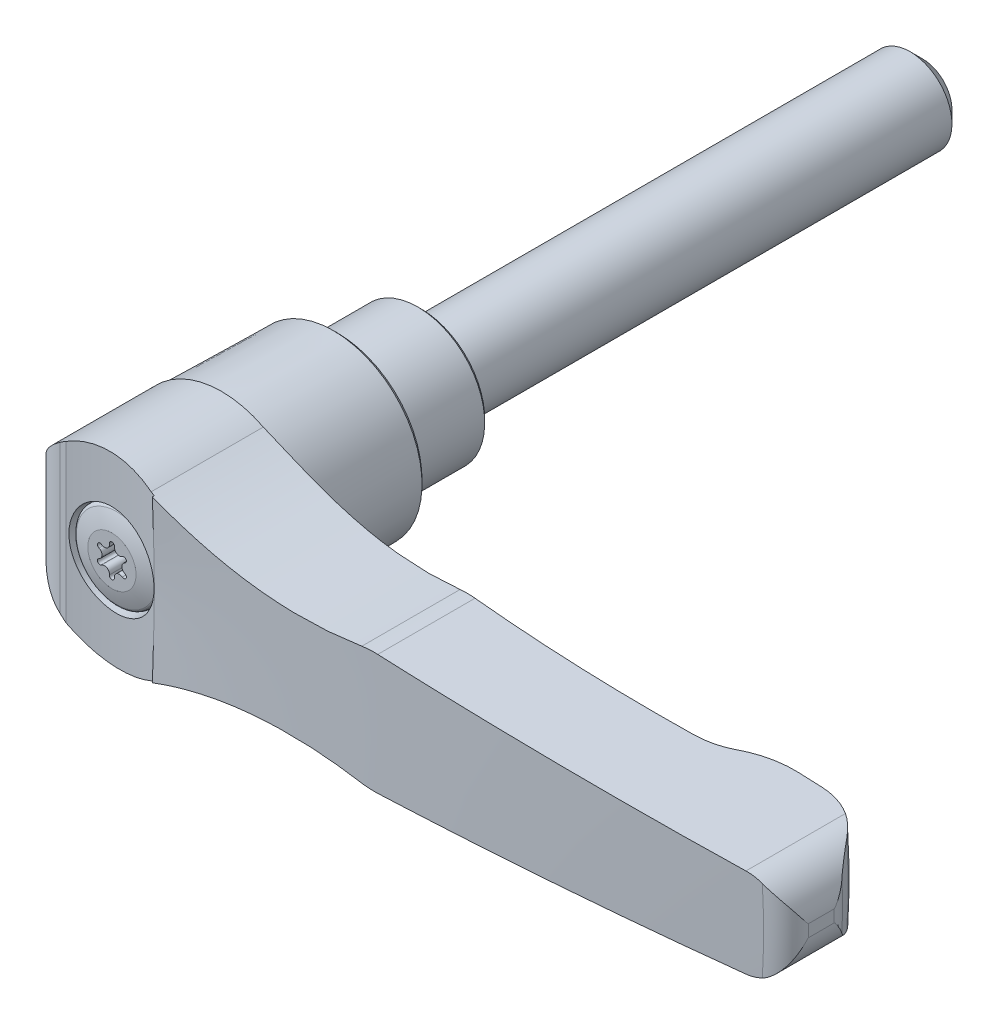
ISO-10303-21;
HEADER;
FILE_DESCRIPTION(('STEP AP214'),'2;1');
FILE_NAME('part.step','',(''),(''),'','','');
FILE_SCHEMA(('AUTOMOTIVE_DESIGN { 1 0 10303 214 1 1 1 1 }'));
ENDSEC;
DATA;
#1=APPLICATION_CONTEXT('core data for automotive mechanical design processes');
#2=APPLICATION_PROTOCOL_DEFINITION('international standard','automotive_design',2000,#1);
#3=PRODUCT_CONTEXT('',#1,'mechanical');
#4=PRODUCT('Part','Part','',(#3));
#5=PRODUCT_RELATED_PRODUCT_CATEGORY('part','',(#4));
#6=PRODUCT_DEFINITION_FORMATION('','',#4);
#7=PRODUCT_DEFINITION_CONTEXT('part definition',#1,'design');
#8=PRODUCT_DEFINITION('design','',#6,#7);
#9=PRODUCT_DEFINITION_SHAPE('','',#8);
#10=(LENGTH_UNIT() NAMED_UNIT(*) SI_UNIT(.MILLI.,.METRE.));
#11=(NAMED_UNIT(*) PLANE_ANGLE_UNIT() SI_UNIT($,.RADIAN.));
#12=(NAMED_UNIT(*) SI_UNIT($,.STERADIAN.) SOLID_ANGLE_UNIT());
#13=UNCERTAINTY_MEASURE_WITH_UNIT(LENGTH_MEASURE(1.E-05),#10,'distance_accuracy_value','');
#14=(GEOMETRIC_REPRESENTATION_CONTEXT(3) GLOBAL_UNCERTAINTY_ASSIGNED_CONTEXT((#13)) GLOBAL_UNIT_ASSIGNED_CONTEXT((#10,
#11,#12)) REPRESENTATION_CONTEXT('',''));
#15=CARTESIAN_POINT('',(0.,0.,0.));
#16=DIRECTION('',(0.,0.,1.));
#17=DIRECTION('',(1.,0.,0.));
#18=AXIS2_PLACEMENT_3D('',#15,#16,#17);
#19=CARTESIAN_POINT('',(0.,0.,27.75));
#20=DIRECTION('',(0.,0.,1.));
#21=DIRECTION('',(0.,-1.,0.));
#22=AXIS2_PLACEMENT_3D('',#19,#20,#21);
#23=CONICAL_SURFACE('',#22,5.15,0.0261799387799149);
#24=CARTESIAN_POINT('',(-3.82186723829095,3.79301788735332,36.7080789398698));
#25=CARTESIAN_POINT('',(-3.71534691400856,3.90028108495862,36.7062117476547));
#26=CARTESIAN_POINT('',(-3.60432455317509,4.00304517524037,36.704589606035));
#27=CARTESIAN_POINT('',(-3.37399930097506,4.19891926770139,36.7020096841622));
#28=CARTESIAN_POINT('',(-3.25469446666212,4.29202699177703,36.7010520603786));
#29=CARTESIAN_POINT('',(-3.0085890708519,4.4679591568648,36.6999680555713));
#30=CARTESIAN_POINT('',(-2.88178275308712,4.55077554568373,36.6998423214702));
#31=CARTESIAN_POINT('',(-2.62161264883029,4.7054859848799,36.7005758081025));
#32=CARTESIAN_POINT('',(-2.48824649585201,4.77737605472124,36.7014353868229));
#33=CARTESIAN_POINT('',(-2.21605276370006,4.90964048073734,36.7042708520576));
#34=CARTESIAN_POINT('',(-2.07722922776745,4.97002317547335,36.7062459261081));
#35=CARTESIAN_POINT('',(-1.79497035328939,5.07893378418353,36.7114191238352));
#36=CARTESIAN_POINT('',(-1.65153333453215,5.12745732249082,36.7146176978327));
#37=CARTESIAN_POINT('',(-1.36121177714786,5.21225729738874,36.7223126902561));
#38=CARTESIAN_POINT('',(-1.21432937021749,5.24854110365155,36.7268083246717));
#39=CARTESIAN_POINT('',(-0.918029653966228,5.30866584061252,36.7371445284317));
#40=CARTESIAN_POINT('',(-0.768611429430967,5.33250217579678,36.7429855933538));
#41=CARTESIAN_POINT('',(-0.468546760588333,5.36753437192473,36.7560131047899));
#42=CARTESIAN_POINT('',(-0.317902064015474,5.37874583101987,36.7631978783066));
#43=CARTESIAN_POINT('',(-0.0162164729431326,5.3885202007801,36.7788936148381));
#44=CARTESIAN_POINT('',(0.134824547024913,5.3870784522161,36.7874050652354));
#45=CARTESIAN_POINT('',(0.436130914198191,5.37156631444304,36.8056859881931));
#46=CARTESIAN_POINT('',(0.58639649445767,5.35749997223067,36.815455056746));
#47=CARTESIAN_POINT('',(0.885200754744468,5.31685490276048,36.8361582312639));
#48=CARTESIAN_POINT('',(1.03373877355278,5.29027153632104,36.8470927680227));
#49=CARTESIAN_POINT('',(1.32842726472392,5.22469830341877,36.8700247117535));
#50=CARTESIAN_POINT('',(1.47456945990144,5.18567228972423,36.882025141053));
#51=CARTESIAN_POINT('',(1.76304982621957,5.09551309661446,36.9068998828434));
#52=CARTESIAN_POINT('',(1.90538657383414,5.04437545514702,36.9197745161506));
#53=CARTESIAN_POINT('',(2.18517812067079,4.93037916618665,36.9461969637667));
#54=CARTESIAN_POINT('',(2.32263450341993,4.86752436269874,36.9597445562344));
#55=CARTESIAN_POINT('',(2.59177729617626,4.73053715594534,36.987298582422));
#56=CARTESIAN_POINT('',(2.72346154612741,4.65640057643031,37.0013051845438));
#57=CARTESIAN_POINT('',(3.11008075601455,4.41677811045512,37.0438406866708));
#58=CARTESIAN_POINT('',(3.35498940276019,4.23472918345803,37.0727317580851));
#59=CARTESIAN_POINT('',(3.81061841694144,3.83201391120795,37.1293132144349));
#60=CARTESIAN_POINT('',(4.02133817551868,3.61134687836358,37.1570035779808));
#61=CARTESIAN_POINT('',(4.40299814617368,3.13710131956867,37.2090851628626));
#62=CARTESIAN_POINT('',(4.57389146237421,2.88348453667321,37.2334724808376));
#63=CARTESIAN_POINT('',(4.8704857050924,2.35066468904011,37.2769076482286));
#64=CARTESIAN_POINT('',(4.99618921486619,2.07146308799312,37.2959558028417));
#65=CARTESIAN_POINT('',(5.19764854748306,1.49811632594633,37.3269450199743));
#66=CARTESIAN_POINT('',(5.27385550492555,1.20413322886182,37.3389501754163));
#67=CARTESIAN_POINT('',(5.37579370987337,0.607338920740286,37.3550873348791));
#68=CARTESIAN_POINT('',(5.40152887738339,0.304528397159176,37.3592199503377));
#69=CARTESIAN_POINT('',(5.40172286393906,-0.29769106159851,37.3592512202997));
#70=CARTESIAN_POINT('',(5.37675477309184,-0.597099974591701,37.35524190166));
#71=CARTESIAN_POINT('',(5.27746605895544,-1.18740212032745,37.3395194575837));
#72=CARTESIAN_POINT('',(5.20314585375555,-1.47829542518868,37.3278063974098));
#73=CARTESIAN_POINT('',(5.00745942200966,-2.04324075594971,37.2976749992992));
#74=CARTESIAN_POINT('',(4.88611822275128,-2.31730165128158,37.2792602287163));
#75=CARTESIAN_POINT('',(4.59994520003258,-2.84124816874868,37.2372335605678));
#76=CARTESIAN_POINT('',(4.43511078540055,-3.09113234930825,37.2136213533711));
#77=CARTESIAN_POINT('',(4.06463235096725,-3.56252869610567,37.1627855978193));
#78=CARTESIAN_POINT('',(3.85857005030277,-3.78370822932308,37.1355260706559));
#79=CARTESIAN_POINT('',(3.41254071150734,-4.18853503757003,37.0796758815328));
#80=CARTESIAN_POINT('',(3.17257159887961,-4.37218001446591,37.0510851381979));
#81=CARTESIAN_POINT('',(2.66278140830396,-4.69856745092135,36.994342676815));
#82=CARTESIAN_POINT('',(2.39268640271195,-4.84088357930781,36.9661981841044));
#83=CARTESIAN_POINT('',(1.83217160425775,-5.07809992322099,36.9125421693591));
#84=CARTESIAN_POINT('',(1.54175179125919,-5.17300009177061,36.8870306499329));
#85=CARTESIAN_POINT('',(0.948774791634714,-5.31257948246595,36.8401550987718));
#86=CARTESIAN_POINT('',(0.646218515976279,-5.35726246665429,36.8187907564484));
#87=CARTESIAN_POINT('',(0.0375867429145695,-5.39498080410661,36.7812079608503));
#88=CARTESIAN_POINT('',(-0.268488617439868,-5.38801816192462,36.7649893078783));
#89=CARTESIAN_POINT('',(-0.873320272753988,-5.32272310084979,36.7381921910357));
#90=CARTESIAN_POINT('',(-1.17211141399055,-5.26472804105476,36.7275774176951));
#91=CARTESIAN_POINT('',(-1.75586295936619,-5.09937269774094,36.7116339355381));
#92=CARTESIAN_POINT('',(-2.04082365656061,-4.99201346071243,36.7063051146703));
#93=CARTESIAN_POINT('',(-2.58762584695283,-4.73149608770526,36.7002185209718));
#94=CARTESIAN_POINT('',(-2.84955219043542,-4.57851601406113,36.6994432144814));
#95=CARTESIAN_POINT('',(-3.34420500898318,-4.23075694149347,36.7012936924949));
#96=CARTESIAN_POINT('',(-3.57693118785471,-4.03597751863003,36.7039195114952));
#97=CARTESIAN_POINT('',(-3.89903010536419,-3.71679841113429,36.709377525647));
#98=CARTESIAN_POINT('',(-4.00199323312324,-3.60577103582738,36.7114531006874));
#99=CARTESIAN_POINT('',(-4.19820603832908,-3.37546663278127,36.7159314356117));
#100=CARTESIAN_POINT('',(-4.29145927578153,-3.25619265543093,36.7183340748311));
#101=CARTESIAN_POINT('',(-4.46762204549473,-3.01018379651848,36.7232909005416));
#102=CARTESIAN_POINT('',(-4.55052767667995,-2.88344612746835,36.7258451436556));
#103=CARTESIAN_POINT('',(-4.70534739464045,-2.62348619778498,36.7309338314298));
#104=CARTESIAN_POINT('',(-4.77726552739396,-2.49026634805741,36.7334682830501));
#105=CARTESIAN_POINT('',(-4.90972659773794,-2.2180457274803,36.7383656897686));
#106=CARTESIAN_POINT('',(-4.97025295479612,-2.07903688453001,36.7407283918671));
#107=CARTESIAN_POINT('',(-5.07934789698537,-1.79645762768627,36.7451389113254));
#108=CARTESIAN_POINT('',(-5.12792090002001,-1.65288892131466,36.7471868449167));
#109=CARTESIAN_POINT('',(-5.21280239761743,-1.36211419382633,36.750853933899));
#110=CARTESIAN_POINT('',(-5.24910688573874,-1.21490700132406,36.7524729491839));
#111=CARTESIAN_POINT('',(-5.30915612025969,-0.918004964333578,36.7551917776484));
#112=CARTESIAN_POINT('',(-5.33290553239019,-0.768311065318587,36.7562917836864));
#113=CARTESIAN_POINT('',(-5.36767150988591,-0.467638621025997,36.7579130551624));
#114=CARTESIAN_POINT('',(-5.37870396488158,-0.316661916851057,36.7584350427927));
#115=CARTESIAN_POINT('',(-5.38800813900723,-0.0143709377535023,36.7588747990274));
#116=CARTESIAN_POINT('',(-5.38628458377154,0.136943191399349,36.7587927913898));
#117=CARTESIAN_POINT('',(-5.37009558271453,0.438975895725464,36.758029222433));
#118=CARTESIAN_POINT('',(-5.35562265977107,0.589694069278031,36.7573473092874));
#119=CARTESIAN_POINT('',(-5.31403708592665,0.889315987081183,36.7554202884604));
#120=CARTESIAN_POINT('',(-5.28692909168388,1.03822037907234,36.7541753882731));
#121=CARTESIAN_POINT('',(-5.22027737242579,1.33318140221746,36.7511900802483));
#122=CARTESIAN_POINT('',(-5.18073627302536,1.47923862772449,36.749449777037));
#123=CARTESIAN_POINT('',(-5.08951807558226,1.7674479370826,36.7455701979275));
#124=CARTESIAN_POINT('',(-5.03784539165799,1.90960142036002,36.7434310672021));
#125=CARTESIAN_POINT('',(-4.92276837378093,2.18894714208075,36.738876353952));
#126=CARTESIAN_POINT('',(-4.85937318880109,2.32614315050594,36.7364609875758));
#127=CARTESIAN_POINT('',(-4.72130226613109,2.59467891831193,36.7314958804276));
#128=CARTESIAN_POINT('',(-4.64662917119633,2.72602004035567,36.728946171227));
#129=CARTESIAN_POINT('',(-4.46041720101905,3.02367013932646,36.7230432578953));
#130=CARTESIAN_POINT('',(-4.34479079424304,3.18744274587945,36.7196987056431));
#131=CARTESIAN_POINT('',(-4.0960291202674,3.50111159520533,36.7134525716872));
#132=CARTESIAN_POINT('',(-3.96289380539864,3.65100780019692,36.7105509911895));
#133=CARTESIAN_POINT('',(-3.82186723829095,3.79301788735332,36.7080789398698));
#134=B_SPLINE_CURVE_WITH_KNOTS('',3,(#24,#25,#26,#27,#28,#29,#30,#31,#32,#33,#34,#35,#36,#37,
#38,#39,#40,#41,#42,#43,#44,#45,#46,#47,#48,#49,#50,#51,#52,#53,#54,#55,#56,#57,#58,#59,#60,#61,
#62,#63,#64,#65,#66,#67,#68,#69,#70,#71,#72,#73,#74,#75,#76,#77,#78,#79,#80,#81,#82,#83,#84,#85,
#86,#87,#88,#89,#90,#91,#92,#93,#94,#95,#96,#97,#98,#99,#100,#101,#102,#103,#104,#105,#106,#107,
#108,#109,#110,#111,#112,#113,#114,#115,#116,#117,#118,#119,#120,#121,#122,#123,#124,#125,#126,
#127,#128,#129,#130,#131,#132,#133),.UNSPECIFIED.,.T.,.F.,(4,2,2,2,2,2,2,2,2,2,2,2,2,2,2,2,2,2,
2,2,2,2,2,2,2,2,2,2,2,2,2,2,2,2,2,2,2,2,2,2,2,2,2,2,2,2,2,2,2,2,2,2,2,2,4),(0.,
0.453366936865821,0.906840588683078,1.36066684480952,1.81465803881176,2.26831899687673,
2.72214709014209,3.17570143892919,3.62942311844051,4.0825836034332,4.53591096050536,
4.98909304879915,5.44244323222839,5.89712263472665,6.35196980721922,6.8066680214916,
7.26153496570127,8.17638541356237,9.09125215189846,10.007190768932,10.9230770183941,
11.8304937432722,12.7378399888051,13.634987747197,14.5321279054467,15.4287912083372,
16.3255079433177,17.2318313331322,18.1382101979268,19.0536313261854,19.9690533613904,
20.8844068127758,21.7997247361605,22.7090368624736,23.6183297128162,24.5241189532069,
25.4299173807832,25.8837842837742,26.3374841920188,26.7913546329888,27.2450575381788,
27.6994157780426,28.1536058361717,28.6079440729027,29.0621133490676,29.5157145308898,
29.969147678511,30.4228469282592,30.8763790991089,31.3298155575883,31.7830872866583,
32.2360067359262,32.6888202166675,33.2890494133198,33.8892802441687),.UNSPECIFIED.);
#135=CARTESIAN_POINT('',(-3.82186723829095,3.79301788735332,36.7080789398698));
#136=VERTEX_POINT('',#135);
#137=EDGE_CURVE('E521',#136,#136,#134,.T.);
#138=ORIENTED_EDGE('',*,*,#137,.F.);
#139=EDGE_LOOP('',(#138));
#140=FACE_BOUND('',#139,.T.);
#141=CARTESIAN_POINT('',(0.,0.,33.));
#142=DIRECTION('',(0.,0.,-1.));
#143=DIRECTION('',(-1.,0.,0.));
#144=AXIS2_PLACEMENT_3D('',#141,#142,#143);
#145=CIRCLE('',#144,5.28747608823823);
#146=CARTESIAN_POINT('',(-5.28747608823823,0.,33.));
#147=VERTEX_POINT('',#146);
#148=EDGE_CURVE('E299',#147,#147,#145,.T.);
#149=ORIENTED_EDGE('',*,*,#148,.T.);
#150=EDGE_LOOP('',(#149));
#151=FACE_BOUND('',#150,.T.);
#152=ADVANCED_FACE('F14',(#140,#151),#23,.F.);
#153=CARTESIAN_POINT('',(0.,0.,-20.));
#154=DIRECTION('',(0.,0.,-1.));
#155=DIRECTION('',(0.,1.,0.));
#156=AXIS2_PLACEMENT_3D('',#153,#154,#155);
#157=CYLINDRICAL_SURFACE('',#156,5.);
#158=CARTESIAN_POINT('',(0.,0.,-58.5));
#159=DIRECTION('',(0.,0.,-1.));
#160=DIRECTION('',(0.,1.,0.));
#161=AXIS2_PLACEMENT_3D('',#158,#159,#160);
#162=CIRCLE('',#161,5.);
#163=CARTESIAN_POINT('',(0.,5.,-58.5));
#164=VERTEX_POINT('',#163);
#165=EDGE_CURVE('E9',#164,#164,#162,.F.);
#166=ORIENTED_EDGE('',*,*,#165,.T.);
#167=EDGE_LOOP('',(#166));
#168=FACE_BOUND('',#167,.T.);
#169=CARTESIAN_POINT('',(0.,0.,0.));
#170=DIRECTION('',(0.,0.,-1.));
#171=DIRECTION('',(0.,1.,0.));
#172=AXIS2_PLACEMENT_3D('',#169,#170,#171);
#173=CIRCLE('',#172,5.);
#174=CARTESIAN_POINT('',(0.,5.,0.));
#175=VERTEX_POINT('',#174);
#176=EDGE_CURVE('E362',#175,#175,#173,.T.);
#177=ORIENTED_EDGE('',*,*,#176,.T.);
#178=EDGE_LOOP('',(#177));
#179=FACE_BOUND('',#178,.T.);
#180=ADVANCED_FACE('F512',(#168,#179),#157,.T.);
#181=CARTESIAN_POINT('',(7.6,0.,0.));
#182=DIRECTION('',(0.,0.,1.));
#183=DIRECTION('',(0.,-1.,0.));
#184=AXIS2_PLACEMENT_3D('',#181,#182,#183);
#185=PLANE('',#184);
#186=ORIENTED_EDGE('',*,*,#176,.F.);
#187=EDGE_LOOP('',(#186));
#188=FACE_BOUND('',#187,.T.);
#189=CARTESIAN_POINT('',(0.,0.,0.));
#190=DIRECTION('',(0.,0.,-1.));
#191=DIRECTION('',(0.,1.,0.));
#192=AXIS2_PLACEMENT_3D('',#189,#190,#191);
#193=CIRCLE('',#192,7.6);
#194=CARTESIAN_POINT('',(0.,7.6,0.));
#195=VERTEX_POINT('',#194);
#196=EDGE_CURVE('E985',#195,#195,#193,.T.);
#197=ORIENTED_EDGE('',*,*,#196,.T.);
#198=EDGE_LOOP('',(#197));
#199=FACE_BOUND('',#198,.T.);
#200=ADVANCED_FACE('F403',(#188,#199),#185,.F.);
#201=CARTESIAN_POINT('',(-2.9000000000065,-22.,89.3000000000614));
#202=DIRECTION('',(0.,1.,0.));
#203=DIRECTION('',(-1.,0.,0.));
#204=AXIS2_PLACEMENT_3D('',#201,#202,#203);
#205=CYLINDRICAL_SURFACE('',#204,52.6000000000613);
#206=CARTESIAN_POINT('',(4.99999999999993,9.79795897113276,37.29663472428));
#207=CARTESIAN_POINT('',(4.72836499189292,9.9366097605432,37.2553500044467));
#208=CARTESIAN_POINT('',(4.45077156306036,10.0639978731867,37.2153761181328));
#209=CARTESIAN_POINT('',(3.88554818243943,10.2954169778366,37.1387392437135));
#210=CARTESIAN_POINT('',(3.59791744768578,10.3994461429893,37.1020765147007));
#211=CARTESIAN_POINT('',(3.01491777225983,10.5831754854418,37.0328024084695));
#212=CARTESIAN_POINT('',(2.71955925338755,10.6629067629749,37.0001858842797));
#213=CARTESIAN_POINT('',(2.12279313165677,10.79755975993,36.9395048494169));
#214=CARTESIAN_POINT('',(1.82138582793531,10.8524827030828,36.9114401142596));
#215=CARTESIAN_POINT('',(1.21421772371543,10.9370815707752,36.8602616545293));
#216=CARTESIAN_POINT('',(0.90845167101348,10.966723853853,36.8371545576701));
#217=CARTESIAN_POINT('',(0.295018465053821,11.0003346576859,36.7962250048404));
#218=CARTESIAN_POINT('',(-0.0126494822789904,11.0042916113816,36.7784049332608));
#219=CARTESIAN_POINT('',(-0.627464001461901,10.9863940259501,36.7482132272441));
#220=CARTESIAN_POINT('',(-0.934610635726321,10.9645428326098,36.7358408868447));
#221=CARTESIAN_POINT('',(-1.54601934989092,10.8951569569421,36.7165401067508));
#222=CARTESIAN_POINT('',(-1.85028266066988,10.8476337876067,36.709609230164));
#223=CARTESIAN_POINT('',(-2.46439079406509,10.7251200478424,36.7008764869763));
#224=CARTESIAN_POINT('',(-2.77405858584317,10.64922685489,36.6992625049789));
#225=CARTESIAN_POINT('',(-3.38564496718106,10.4708596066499,36.7013524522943));
#226=CARTESIAN_POINT('',(-3.68756293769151,10.3683834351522,36.705056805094));
#227=CARTESIAN_POINT('',(-4.28200890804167,10.1373700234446,36.7173174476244));
#228=CARTESIAN_POINT('',(-4.5745119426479,10.0087692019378,36.7258856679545));
#229=CARTESIAN_POINT('',(-5.14711147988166,9.72673276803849,36.7472344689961));
#230=CARTESIAN_POINT('',(-5.42720860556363,9.57329840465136,36.7600148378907));
#231=CARTESIAN_POINT('',(-5.70000000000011,9.40797534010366,36.774577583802));
#232=B_SPLINE_CURVE_WITH_KNOTS('',3,(#206,#207,#208,#209,#210,#211,#212,#213,#214,#215,#216,
#217,#218,#219,#220,#221,#222,#223,#224,#225,#226,#227,#228,#229,#230,#231),.UNSPECIFIED.,.F.,
.F.,(4,2,2,2,2,2,2,2,2,2,2,2,4),(0.,0.923020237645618,1.84611263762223,2.76801850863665,
3.68987889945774,4.61296412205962,5.53646501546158,6.4598461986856,7.38281362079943,
8.33806499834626,9.29339244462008,10.2510734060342,11.2087062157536),.UNSPECIFIED.);
#233=CARTESIAN_POINT('',(4.99999999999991,9.7979589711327,37.29663472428));
#234=VERTEX_POINT('',#233);
#235=CARTESIAN_POINT('',(-5.7000000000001,9.40797534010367,36.774577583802));
#236=VERTEX_POINT('',#235);
#237=EDGE_CURVE('E435',#234,#236,#232,.T.);
#238=ORIENTED_EDGE('',*,*,#237,.T.);
#239=DIRECTION('',(0.,1.,0.));
#240=VECTOR('',#239,1.);
#241=CARTESIAN_POINT('',(-5.7000000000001,-22.,36.774577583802));
#242=LINE('',#241,#240);
#243=CARTESIAN_POINT('',(-5.7000000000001,-9.4079753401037,36.774577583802));
#244=VERTEX_POINT('',#243);
#245=EDGE_CURVE('E368',#244,#236,#242,.T.);
#246=ORIENTED_EDGE('',*,*,#245,.F.);
#247=CARTESIAN_POINT('',(-5.70000000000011,-9.40797534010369,36.774577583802));
#248=CARTESIAN_POINT('',(-5.43970332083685,-9.56571993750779,36.7606846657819));
#249=CARTESIAN_POINT('',(-5.17275915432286,-9.71264560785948,36.7484111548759));
#250=CARTESIAN_POINT('',(-4.62749279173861,-9.9839292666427,36.727671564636));
#251=CARTESIAN_POINT('',(-4.34917039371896,-10.1082868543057,36.7192055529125));
#252=CARTESIAN_POINT('',(-3.7836735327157,-10.3332602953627,36.706663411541));
#253=CARTESIAN_POINT('',(-3.49651907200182,-10.4339258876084,36.7025780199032));
#254=CARTESIAN_POINT('',(-2.91484226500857,-10.6111316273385,36.699198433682));
#255=CARTESIAN_POINT('',(-2.62032018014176,-10.6876726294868,36.6999040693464));
#256=CARTESIAN_POINT('',(-2.02570589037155,-10.8161512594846,36.7064252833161));
#257=CARTESIAN_POINT('',(-1.7256084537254,-10.8680644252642,36.7122459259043));
#258=CARTESIAN_POINT('',(-1.12215614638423,-10.9468441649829,36.7291866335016));
#259=CARTESIAN_POINT('',(-0.818799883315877,-10.9736995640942,36.7403090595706));
#260=CARTESIAN_POINT('',(-0.211043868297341,-11.0021831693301,36.7678948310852));
#261=CARTESIAN_POINT('',(0.0933562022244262,-11.0038028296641,36.7843599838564));
#262=CARTESIAN_POINT('',(0.700782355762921,-10.981859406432,36.8225100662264));
#263=CARTESIAN_POINT('',(1.00380896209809,-10.9583068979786,36.844192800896));
#264=CARTESIAN_POINT('',(1.62703646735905,-10.883833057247,36.8941780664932));
#265=CARTESIAN_POINT('',(1.94700070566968,-10.8311562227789,36.9228309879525));
#266=CARTESIAN_POINT('',(2.58058446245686,-10.6979165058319,36.9853308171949));
#267=CARTESIAN_POINT('',(2.89420315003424,-10.6173499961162,37.0191784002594));
#268=CARTESIAN_POINT('',(3.51321915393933,-10.4289071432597,37.0914975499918));
#269=CARTESIAN_POINT('',(3.81860000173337,-10.3209800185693,37.1299776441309));
#270=CARTESIAN_POINT('',(4.41821395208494,-10.078894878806,37.2106925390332));
#271=CARTESIAN_POINT('',(4.71244874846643,-9.94474086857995,37.2529267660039));
#272=CARTESIAN_POINT('',(5.0000000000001,-9.7979589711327,37.29663472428));
#273=B_SPLINE_CURVE_WITH_KNOTS('',3,(#247,#248,#249,#250,#251,#252,#253,#254,#255,#256,#257,
#258,#259,#260,#261,#262,#263,#264,#265,#266,#267,#268,#269,#270,#271,#272),.UNSPECIFIED.,.F.,
.F.,(4,2,2,2,2,2,2,2,2,2,2,2,4),(0.,0.913785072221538,1.82758637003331,2.73945177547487,
3.65128487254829,4.56402177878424,5.47716553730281,6.39061851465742,7.30368789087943,
8.27897178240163,9.25438256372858,10.2316171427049,11.2087026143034),.UNSPECIFIED.);
#274=CARTESIAN_POINT('',(5.00000000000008,-9.79795897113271,37.29663472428));
#275=VERTEX_POINT('',#274);
#276=EDGE_CURVE('E421',#244,#275,#273,.T.);
#277=ORIENTED_EDGE('',*,*,#276,.T.);
#278=CARTESIAN_POINT('',(5.43597073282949,-9.62987816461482,37.36473652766));
#279=CARTESIAN_POINT('',(5.36321973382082,-9.65752809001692,37.3530600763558));
#280=CARTESIAN_POINT('',(5.29051333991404,-9.68535978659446,37.341546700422));
#281=CARTESIAN_POINT('',(5.14518976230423,-9.74138672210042,37.3188460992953));
#282=CARTESIAN_POINT('',(5.07257257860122,-9.76958196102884,37.3076588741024));
#283=CARTESIAN_POINT('',(5.00000000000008,-9.79795897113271,37.29663472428));
#284=B_SPLINE_CURVE_WITH_KNOTS('',3,(#278,#279,#280,#281,#282,#283),.UNSPECIFIED.,.F.,.F.,(4,2,
4),(0.,0.236094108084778,0.472188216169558),.UNSPECIFIED.);
#285=CARTESIAN_POINT('',(5.4359707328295,-9.62987816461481,37.36473652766));
#286=VERTEX_POINT('',#285);
#287=EDGE_CURVE('E410',#286,#275,#284,.T.);
#288=ORIENTED_EDGE('',*,*,#287,.F.);
#289=DIRECTION('',(0.,1.,0.));
#290=VECTOR('',#289,1.);
#291=CARTESIAN_POINT('',(5.43597073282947,-22.,37.36473652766));
#292=LINE('',#291,#290);
#293=CARTESIAN_POINT('',(5.43597073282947,0.,37.36473652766));
#294=VERTEX_POINT('',#293);
#295=EDGE_CURVE('E37',#286,#294,#292,.T.);
#296=ORIENTED_EDGE('',*,*,#295,.T.);
#297=CARTESIAN_POINT('',(5.43597073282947,9.62987816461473,37.36473652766));
#298=VERTEX_POINT('',#297);
#299=EDGE_CURVE('E365',#294,#298,#292,.T.);
#300=ORIENTED_EDGE('',*,*,#299,.T.);
#301=CARTESIAN_POINT('',(4.99999999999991,9.7979589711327,37.29663472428));
#302=CARTESIAN_POINT('',(5.07257257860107,9.76958196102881,37.3076588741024));
#303=CARTESIAN_POINT('',(5.14518976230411,9.74138672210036,37.3188460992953));
#304=CARTESIAN_POINT('',(5.29051333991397,9.68535978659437,37.341546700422));
#305=CARTESIAN_POINT('',(5.36321973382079,9.65752809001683,37.3530600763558));
#306=CARTESIAN_POINT('',(5.43597073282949,9.62987816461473,37.36473652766));
#307=B_SPLINE_CURVE_WITH_KNOTS('',3,(#301,#302,#303,#304,#305,#306),.UNSPECIFIED.,.F.,.F.,(4,2,
4),(0.,0.236094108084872,0.472188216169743),.UNSPECIFIED.);
#308=EDGE_CURVE('E428',#234,#298,#307,.T.);
#309=ORIENTED_EDGE('',*,*,#308,.F.);
#310=EDGE_LOOP('',(#238,#246,#277,#288,#296,#300,#309));
#311=FACE_BOUND('',#310,.T.);
#312=ORIENTED_EDGE('',*,*,#137,.T.);
#313=EDGE_LOOP('',(#312));
#314=FACE_BOUND('',#313,.T.);
#315=ADVANCED_FACE('F399',(#311,#314),#205,.F.);
#316=CARTESIAN_POINT('',(0.,0.,-577.800000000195));
#317=DIRECTION('',(0.,0.,-1.));
#318=DIRECTION('',(0.,1.,0.));
#319=AXIS2_PLACEMENT_3D('',#316,#317,#318);
#320=DEGENERATE_TOROIDAL_SURFACE('',#319,33.3999999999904,615.800000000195,.T.);
#321=CARTESIAN_POINT('',(30.9002,7.10003333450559,37.9976683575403));
#322=CARTESIAN_POINT('',(30.2294569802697,6.98822969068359,37.9958049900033));
#323=CARTESIAN_POINT('',(29.5563953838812,6.8904055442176,37.9928133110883));
#324=CARTESIAN_POINT('',(28.2067936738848,6.7228472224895,37.9846275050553));
#325=CARTESIAN_POINT('',(27.5302535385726,6.6531132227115,37.9794333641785));
#326=CARTESIAN_POINT('',(26.1747400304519,6.54185757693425,37.9668957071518));
#327=CARTESIAN_POINT('',(25.4957662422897,6.5003410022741,37.9595518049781));
#328=CARTESIAN_POINT('',(24.1367720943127,6.44559969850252,37.9428222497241));
#329=CARTESIAN_POINT('',(23.4567517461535,6.43237465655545,37.9334366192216));
#330=CARTESIAN_POINT('',(21.4461065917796,6.43516844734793,37.9028483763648));
#331=CARTESIAN_POINT('',(20.1152587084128,6.49125306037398,37.878929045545));
#332=CARTESIAN_POINT('',(18.1264981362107,6.65637631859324,37.8390449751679));
#333=CARTESIAN_POINT('',(17.464852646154,6.72491301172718,37.8250833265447));
#334=CARTESIAN_POINT('',(16.1449136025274,6.88885393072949,37.7962639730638));
#335=CARTESIAN_POINT('',(15.4866198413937,6.98425647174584,37.7814063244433));
#336=CARTESIAN_POINT('',(13.9966493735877,7.23126043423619,37.7473031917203));
#337=CARTESIAN_POINT('',(13.1663283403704,7.39108521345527,37.727959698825));
#338=CARTESIAN_POINT('',(11.5152169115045,7.75343699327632,37.690522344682));
#339=CARTESIAN_POINT('',(10.694424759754,7.9559559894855,37.6724282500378));
#340=CARTESIAN_POINT('',(9.05285416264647,8.40635359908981,37.6397736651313));
#341=CARTESIAN_POINT('',(8.23223752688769,8.6548288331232,37.6252663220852));
#342=CARTESIAN_POINT('',(7.01185980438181,9.05958984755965,37.608666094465));
#343=CARTESIAN_POINT('',(6.60676296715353,9.19987583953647,37.603992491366));
#344=CARTESIAN_POINT('',(5.80036915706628,9.49103692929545,37.5966508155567));
#345=CARTESIAN_POINT('',(5.39907222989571,9.64191215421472,37.5939827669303));
#346=CARTESIAN_POINT('',(4.9997999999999,9.79803717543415,37.5924593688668));
#347=B_SPLINE_CURVE_WITH_KNOTS('',3,(#321,#322,#323,#324,#325,#326,#327,#328,#329,#330,#331,
#332,#333,#334,#335,#336,#337,#338,#339,#340,#341,#342,#343,#344,#345,#346),.UNSPECIFIED.,.F.,
.F.,(4,2,2,2,2,2,2,2,2,2,2,2,4),(0.,2.03983506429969,4.07968287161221,6.11989719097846,
8.16008895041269,12.1515193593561,14.1470960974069,16.1425477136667,18.6787308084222,
21.2144388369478,23.7857285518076,25.0717731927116,26.3578332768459),.UNSPECIFIED.);
#348=CARTESIAN_POINT('',(30.9,7.1,37.997667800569));
#349=VERTEX_POINT('',#348);
#350=CARTESIAN_POINT('',(5.4359707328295,9.62987816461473,37.5945767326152));
#351=VERTEX_POINT('',#350);
#352=EDGE_CURVE('E1012',#349,#351,#347,.T.);
#353=ORIENTED_EDGE('',*,*,#352,.T.);
#354=CARTESIAN_POINT('',(5.4359707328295,0.139704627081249,37.364818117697));
#355=CARTESIAN_POINT('',(5.4359707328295,0.0263223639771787,37.3646847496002));
#356=CARTESIAN_POINT('',(5.4359707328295,-0.087059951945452,37.3647143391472));
#357=CARTESIAN_POINT('',(5.4359707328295,-0.31382488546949,37.3650945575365));
#358=CARTESIAN_POINT('',(5.4359707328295,-0.427207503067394,37.3654451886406));
#359=CARTESIAN_POINT('',(5.4359707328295,-0.767350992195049,37.3669741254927));
#360=CARTESIAN_POINT('',(5.4359707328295,-0.994109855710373,37.3686294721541));
#361=CARTESIAN_POINT('',(5.4359707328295,-1.44760096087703,37.3731244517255));
#362=CARTESIAN_POINT('',(5.4359707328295,-1.67433320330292,37.3759640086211));
#363=CARTESIAN_POINT('',(5.4359707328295,-2.12778335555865,37.3826896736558));
#364=CARTESIAN_POINT('',(5.4359707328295,-2.35450126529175,37.3865757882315));
#365=CARTESIAN_POINT('',(5.4359707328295,-2.80788425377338,37.3952314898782));
#366=CARTESIAN_POINT('',(5.4359707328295,-3.03454933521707,37.4000009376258));
#367=CARTESIAN_POINT('',(5.4359707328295,-3.48786247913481,37.4102594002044));
#368=CARTESIAN_POINT('',(5.4359707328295,-3.71451054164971,37.4157484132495));
#369=CARTESIAN_POINT('',(5.4359707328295,-4.3944531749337,37.4330569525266));
#370=CARTESIAN_POINT('',(5.4359707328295,-4.84772616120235,37.445717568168));
#371=CARTESIAN_POINT('',(5.4359707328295,-5.75417804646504,37.4722642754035));
#372=CARTESIAN_POINT('',(5.4359707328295,-6.20735695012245,37.4861502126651));
#373=CARTESIAN_POINT('',(5.4359707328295,-7.11369823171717,37.5144555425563));
#374=CARTESIAN_POINT('',(5.4359707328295,-7.56686060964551,37.528874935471));
#375=CARTESIAN_POINT('',(5.4359707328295,-8.47318366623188,37.5577843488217));
#376=CARTESIAN_POINT('',(5.4359707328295,-8.92634434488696,37.5722743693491));
#377=CARTESIAN_POINT('',(5.4359707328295,-9.83267306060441,37.6010218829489));
#378=CARTESIAN_POINT('',(5.4359707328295,-10.2858410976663,37.615279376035));
#379=CARTESIAN_POINT('',(5.4359707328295,-11.6453393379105,37.657378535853));
#380=CARTESIAN_POINT('',(5.4359707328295,-12.5516906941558,37.6845477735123));
#381=CARTESIAN_POINT('',(5.4359707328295,-14.3644725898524,37.7361289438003));
#382=CARTESIAN_POINT('',(5.4359707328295,-15.2709031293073,37.7605408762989));
#383=CARTESIAN_POINT('',(5.4359707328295,-17.0838968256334,37.8061411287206));
#384=CARTESIAN_POINT('',(5.4359707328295,-17.9904599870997,37.8273292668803));
#385=CARTESIAN_POINT('',(5.4359707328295,-19.8036600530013,37.8662106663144));
#386=CARTESIAN_POINT('',(5.4359707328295,-20.7102969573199,37.8839039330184));
#387=CARTESIAN_POINT('',(5.4359707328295,-22.5236728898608,37.9156376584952));
#388=CARTESIAN_POINT('',(5.4359707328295,-23.4304119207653,37.929677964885));
#389=CARTESIAN_POINT('',(5.4359707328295,-25.2439454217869,37.9540054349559));
#390=CARTESIAN_POINT('',(5.4359707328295,-26.1507398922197,37.9642925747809));
#391=CARTESIAN_POINT('',(5.4359707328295,-28.8758498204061,37.9894632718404));
#392=CARTESIAN_POINT('',(5.4359707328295,-30.6942231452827,37.9985735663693));
#393=CARTESIAN_POINT('',(5.4359707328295,-34.3309833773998,38.001117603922));
#394=CARTESIAN_POINT('',(5.4359707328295,-36.1493702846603,37.9945512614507));
#395=CARTESIAN_POINT('',(5.4359707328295,-41.6044064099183,37.9510940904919));
#396=CARTESIAN_POINT('',(5.4359707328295,-45.2408980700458,37.8904448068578));
#397=CARTESIAN_POINT('',(5.4359707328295,-52.5123746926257,37.7052257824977));
#398=CARTESIAN_POINT('',(5.4359707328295,-56.147359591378,37.5806535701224));
#399=CARTESIAN_POINT('',(5.4359707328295,-63.4145638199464,37.2674123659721));
#400=CARTESIAN_POINT('',(5.4359707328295,-67.046783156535,37.0787435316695));
#401=CARTESIAN_POINT('',(5.4359707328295,-74.3112406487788,36.6370156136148));
#402=CARTESIAN_POINT('',(5.4359707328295,-77.943474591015,36.3838872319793));
#403=CARTESIAN_POINT('',(5.4359707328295,-85.2028595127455,35.813362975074));
#404=CARTESIAN_POINT('',(5.4359707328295,-88.8300105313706,35.4959675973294));
#405=CARTESIAN_POINT('',(5.4359707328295,-96.0785329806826,34.7969300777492));
#406=CARTESIAN_POINT('',(5.4359707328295,-99.6999037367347,34.4152809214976));
#407=CARTESIAN_POINT('',(5.4359707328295,-106.935372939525,33.5878576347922));
#408=CARTESIAN_POINT('',(5.4359707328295,-110.54947113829,33.1420813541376));
#409=CARTESIAN_POINT('',(5.4359707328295,-121.445659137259,31.6999206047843));
#410=CARTESIAN_POINT('',(5.4359707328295,-128.715080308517,30.6051121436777));
#411=CARTESIAN_POINT('',(5.4359707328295,-139.58597763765,28.768381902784));
#412=CARTESIAN_POINT('',(5.4359707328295,-143.204228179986,28.1236865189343));
#413=CARTESIAN_POINT('',(5.4359707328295,-150.428776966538,26.7696133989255));
#414=CARTESIAN_POINT('',(5.4359707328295,-154.035074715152,26.0602330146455));
#415=CARTESIAN_POINT('',(5.4359707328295,-164.835392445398,23.8351440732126));
#416=CARTESIAN_POINT('',(5.4359707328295,-172.00972097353,22.2226762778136));
#417=CARTESIAN_POINT('',(5.4359707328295,-186.295919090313,18.7419286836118));
#418=CARTESIAN_POINT('',(5.4359707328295,-193.407788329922,16.8736474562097));
#419=CARTESIAN_POINT('',(5.4359707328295,-207.565393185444,12.8821360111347));
#420=CARTESIAN_POINT('',(5.4359707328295,-214.611075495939,10.7587166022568));
#421=CARTESIAN_POINT('',(5.4359707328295,-228.621811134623,6.26076727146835));
#422=CARTESIAN_POINT('',(5.4359707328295,-235.586864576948,3.88623770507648));
#423=CARTESIAN_POINT('',(5.4359707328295,-249.427511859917,-1.11092136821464));
#424=CARTESIAN_POINT('',(5.4359707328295,-256.303103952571,-3.73355571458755));
#425=CARTESIAN_POINT('',(5.4359707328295,-269.956066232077,-9.2236157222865));
#426=CARTESIAN_POINT('',(5.4359707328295,-276.733435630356,-12.0910433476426));
#427=CARTESIAN_POINT('',(5.4359707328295,-287.411895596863,-16.8363541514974));
#428=CARTESIAN_POINT('',(5.4359707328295,-291.348165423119,-18.6354901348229));
#429=CARTESIAN_POINT('',(5.4359707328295,-299.181702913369,-22.3162445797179));
#430=CARTESIAN_POINT('',(5.4359707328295,-303.078972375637,-24.1978592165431));
#431=CARTESIAN_POINT('',(5.4359707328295,-314.710300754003,-29.9654969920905));
#432=CARTESIAN_POINT('',(5.4359707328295,-322.383911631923,-33.9743282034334));
#433=CARTESIAN_POINT('',(5.4359707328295,-337.555961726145,-42.3122719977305));
#434=CARTESIAN_POINT('',(5.4359707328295,-345.054380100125,-46.6414224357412));
#435=CARTESIAN_POINT('',(5.4359707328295,-359.862045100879,-55.6120111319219));
#436=CARTESIAN_POINT('',(5.4359707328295,-367.171293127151,-60.2534470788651));
#437=CARTESIAN_POINT('',(5.4359707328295,-381.590156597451,-69.8420495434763));
#438=CARTESIAN_POINT('',(5.4359707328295,-388.699700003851,-74.7893243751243));
#439=CARTESIAN_POINT('',(5.4359707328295,-402.703827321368,-84.9793317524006));
#440=CARTESIAN_POINT('',(5.4359707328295,-409.598410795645,-90.2220648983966));
#441=CARTESIAN_POINT('',(5.4359707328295,-423.160104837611,-100.99347121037));
#442=CARTESIAN_POINT('',(5.4359707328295,-429.827222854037,-106.522134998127));
#443=CARTESIAN_POINT('',(5.4359707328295,-442.922356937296,-117.855720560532));
#444=CARTESIAN_POINT('',(5.4359707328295,-449.350373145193,-123.660642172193));
#445=CARTESIAN_POINT('',(5.4359707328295,-461.953986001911,-135.534643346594));
#446=CARTESIAN_POINT('',(5.4359707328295,-468.129657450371,-141.603643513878));
#447=CARTESIAN_POINT('',(5.4359707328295,-480.219630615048,-153.996624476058));
#448=CARTESIAN_POINT('',(5.4359707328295,-486.133932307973,-160.320605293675));
#449=CARTESIAN_POINT('',(5.4359707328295,-497.690689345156,-173.212347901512));
#450=CARTESIAN_POINT('',(5.4359707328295,-503.333142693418,-179.780111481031));
#451=CARTESIAN_POINT('',(5.4359707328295,-514.336121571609,-193.147695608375));
#452=CARTESIAN_POINT('',(5.4359707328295,-519.696647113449,-199.947516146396));
#453=CARTESIAN_POINT('',(5.4359707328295,-530.125574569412,-213.766243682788));
#454=CARTESIAN_POINT('',(5.4359707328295,-535.19401350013,-220.785122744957));
#455=CARTESIAN_POINT('',(5.4359707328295,-545.030492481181,-235.030309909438));
#456=CARTESIAN_POINT('',(5.4359707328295,-549.798532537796,-242.256618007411));
#457=CARTESIAN_POINT('',(5.4359707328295,-559.025727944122,-256.903802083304));
#458=CARTESIAN_POINT('',(5.4359707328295,-563.484883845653,-264.324677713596));
#459=CARTESIAN_POINT('',(5.4359707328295,-572.086391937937,-279.347815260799));
#460=CARTESIAN_POINT('',(5.4359707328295,-576.228744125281,-286.95007717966));
#461=CARTESIAN_POINT('',(5.4359707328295,-584.189397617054,-302.322698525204));
#462=CARTESIAN_POINT('',(5.4359707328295,-588.007689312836,-310.09306292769));
#463=CARTESIAN_POINT('',(5.4359707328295,-595.313295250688,-325.787854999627));
#464=CARTESIAN_POINT('',(5.4359707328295,-598.80060949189,-333.71228266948));
#465=CARTESIAN_POINT('',(5.4359707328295,-605.438061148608,-349.701114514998));
#466=CARTESIAN_POINT('',(5.4359707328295,-608.588198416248,-357.765518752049));
#467=CARTESIAN_POINT('',(5.4359707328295,-614.545693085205,-374.01996116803));
#468=CARTESIAN_POINT('',(5.4359707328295,-617.353050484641,-382.20999934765));
#469=CARTESIAN_POINT('',(5.4359707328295,-622.620087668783,-398.701441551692));
#470=CARTESIAN_POINT('',(5.4359707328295,-625.079755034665,-407.002849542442));
#471=CARTESIAN_POINT('',(5.4359707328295,-629.646919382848,-423.701983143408));
#472=CARTESIAN_POINT('',(5.4359707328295,-631.754416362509,-432.099708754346));
#473=CARTESIAN_POINT('',(5.4359707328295,-635.613492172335,-448.976544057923));
#474=CARTESIAN_POINT('',(5.4359707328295,-637.365071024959,-457.455653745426));
#475=CARTESIAN_POINT('',(5.4359707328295,-640.509196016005,-474.480180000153));
#476=CARTESIAN_POINT('',(5.4359707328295,-641.901742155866,-483.025596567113));
#477=CARTESIAN_POINT('',(5.4359707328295,-644.32531330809,-500.167455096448));
#478=CARTESIAN_POINT('',(5.4359707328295,-645.356341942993,-508.763896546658));
#479=CARTESIAN_POINT('',(5.4359707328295,-647.055064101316,-525.992603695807));
#480=CARTESIAN_POINT('',(5.4359707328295,-647.722757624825,-534.624869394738));
#481=CARTESIAN_POINT('',(5.4359707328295,-648.693622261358,-551.909875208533));
#482=CARTESIAN_POINT('',(5.4359707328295,-648.99679337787,-560.562615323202));
#483=CARTESIAN_POINT('',(5.4359707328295,-649.238074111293,-577.873183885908));
#484=CARTESIAN_POINT('',(5.4359707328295,-649.176183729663,-586.531012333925));
#485=CARTESIAN_POINT('',(5.4359707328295,-648.687456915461,-603.836171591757));
#486=CARTESIAN_POINT('',(5.4359707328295,-648.260628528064,-612.483502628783));
#487=CARTESIAN_POINT('',(5.4359707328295,-647.042795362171,-629.752482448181));
#488=CARTESIAN_POINT('',(5.4359707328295,-646.251790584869,-638.374131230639));
#489=CARTESIAN_POINT('',(5.4359707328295,-644.307011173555,-655.57641610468));
#490=CARTESIAN_POINT('',(5.4359707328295,-643.153236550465,-664.1570521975));
#491=CARTESIAN_POINT('',(5.4359707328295,-640.484968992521,-681.26205469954));
#492=CARTESIAN_POINT('',(5.4359707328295,-638.970476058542,-689.786421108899));
#493=CARTESIAN_POINT('',(5.4359707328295,-635.583505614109,-706.763522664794));
#494=CARTESIAN_POINT('',(5.4359707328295,-633.711036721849,-715.216259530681));
#495=CARTESIAN_POINT('',(5.4359707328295,-629.611420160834,-732.03528066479));
#496=CARTESIAN_POINT('',(5.4359707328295,-627.38427249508,-740.401564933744));
#497=CARTESIAN_POINT('',(5.4359707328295,-622.579258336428,-757.032805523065));
#498=CARTESIAN_POINT('',(5.4359707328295,-620.001391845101,-765.297761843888));
#499=CARTESIAN_POINT('',(5.4359707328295,-614.499523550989,-781.711651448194));
#500=CARTESIAN_POINT('',(5.4359707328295,-611.575521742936,-789.860584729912));
#501=CARTESIAN_POINT('',(5.4359707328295,-605.386368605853,-806.028496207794));
#502=CARTESIAN_POINT('',(5.4359707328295,-602.12119379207,-814.047465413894));
#503=CARTESIAN_POINT('',(5.4359707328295,-595.255667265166,-829.9406140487));
#504=CARTESIAN_POINT('',(5.4359707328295,-591.655315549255,-837.814793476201));
#505=CARTESIAN_POINT('',(5.4359707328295,-584.125837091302,-853.404361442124));
#506=CARTESIAN_POINT('',(5.4359707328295,-580.196710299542,-861.119749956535));
#507=CARTESIAN_POINT('',(5.4359707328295,-572.016669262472,-876.378014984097));
#508=CARTESIAN_POINT('',(5.4359707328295,-567.765755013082,-883.920891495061));
#509=CARTESIAN_POINT('',(5.4359707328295,-558.949229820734,-898.821511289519));
#510=CARTESIAN_POINT('',(5.4359707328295,-554.383585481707,-906.179234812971));
#511=CARTESIAN_POINT('',(5.4359707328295,-544.946122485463,-920.695630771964));
#512=CARTESIAN_POINT('',(5.4359707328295,-540.074303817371,-927.854303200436));
#513=CARTESIAN_POINT('',(5.4359707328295,-530.033157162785,-941.959864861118));
#514=CARTESIAN_POINT('',(5.4359707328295,-524.863829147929,-948.906754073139));
#515=CARTESIAN_POINT('',(5.4359707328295,-514.236858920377,-962.576392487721));
#516=CARTESIAN_POINT('',(5.4359707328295,-508.779216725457,-969.299141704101));
#517=CARTESIAN_POINT('',(5.4359707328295,-497.586889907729,-982.506697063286));
#518=CARTESIAN_POINT('',(5.4359707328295,-491.85228313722,-988.9915691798));
#519=CARTESIAN_POINT('',(5.4359707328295,-480.114812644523,-1001.71382103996));
#520=CARTESIAN_POINT('',(5.4359707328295,-474.111948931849,-1007.95120079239));
#521=CARTESIAN_POINT('',(5.4359707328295,-461.848645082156,-1020.16737113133));
#522=CARTESIAN_POINT('',(5.4359707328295,-455.588205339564,-1026.14616211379));
#523=CARTESIAN_POINT('',(5.4359707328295,-442.820869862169,-1037.83453734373));
#524=CARTESIAN_POINT('',(5.4359707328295,-436.313974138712,-1043.5441216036));
#525=CARTESIAN_POINT('',(5.4359707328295,-423.067785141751,-1054.68183976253));
#526=CARTESIAN_POINT('',(5.4359707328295,-416.328580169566,-1060.11007867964));
#527=CARTESIAN_POINT('',(5.4359707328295,-402.627429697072,-1070.67776910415));
#528=CARTESIAN_POINT('',(5.4359707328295,-395.665484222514,-1075.81722064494));
#529=CARTESIAN_POINT('',(5.4359707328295,-381.531179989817,-1085.79823603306));
#530=CARTESIAN_POINT('',(5.4359707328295,-374.358820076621,-1090.63979824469));
#531=CARTESIAN_POINT('',(5.4359707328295,-359.816463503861,-1100.01640587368));
#532=CARTESIAN_POINT('',(5.4359707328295,-352.446466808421,-1104.5514512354));
#533=CARTESIAN_POINT('',(5.4359707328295,-337.514133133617,-1113.31154380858));
#534=CARTESIAN_POINT('',(5.4359707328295,-329.951603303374,-1117.53626229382));
#535=CARTESIAN_POINT('',(5.4359707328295,-314.655073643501,-1125.66295293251));
#536=CARTESIAN_POINT('',(5.4359707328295,-306.921073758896,-1129.56492498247));
#537=CARTESIAN_POINT('',(5.4359707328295,-291.295556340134,-1137.03909111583));
#538=CARTESIAN_POINT('',(5.4359707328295,-283.404042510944,-1140.61129294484));
#539=CARTESIAN_POINT('',(5.4359707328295,-267.477373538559,-1147.41966520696));
#540=CARTESIAN_POINT('',(5.4359707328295,-259.442218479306,-1150.65583583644));
#541=CARTESIAN_POINT('',(5.4359707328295,-243.233308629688,-1156.78989661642));
#542=CARTESIAN_POINT('',(5.4359707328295,-235.059405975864,-1159.68739605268));
#543=CARTESIAN_POINT('',(5.4359707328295,-218.59651822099,-1165.13467733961));
#544=CARTESIAN_POINT('',(5.4359707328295,-210.307532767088,-1167.68445812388));
#545=CARTESIAN_POINT('',(5.4359707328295,-193.62831660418,-1172.43203536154));
#546=CARTESIAN_POINT('',(5.4359707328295,-185.238074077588,-1174.62979029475));
#547=CARTESIAN_POINT('',(5.4359707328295,-168.372338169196,-1178.66903322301));
#548=CARTESIAN_POINT('',(5.4359707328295,-159.89684570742,-1180.51052505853));
#549=CARTESIAN_POINT('',(5.4359707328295,-142.903125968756,-1183.8286702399));
#550=CARTESIAN_POINT('',(5.4359707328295,-134.385123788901,-1185.30647787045));
#551=CARTESIAN_POINT('',(5.4359707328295,-117.293865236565,-1187.90244037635));
#552=CARTESIAN_POINT('',(5.4359707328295,-108.720606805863,-1189.02058177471));
#553=CARTESIAN_POINT('',(5.4359707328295,-95.8335942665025,-1190.4263759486));
#554=CARTESIAN_POINT('',(5.4359707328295,-91.5342195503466,-1190.84968319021));
#555=CARTESIAN_POINT('',(5.4359707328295,-82.9275509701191,-1191.60585748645));
#556=CARTESIAN_POINT('',(5.4359707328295,-78.6202572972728,-1191.93872669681));
#557=CARTESIAN_POINT('',(5.4359707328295,-70.0001583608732,-1192.51392362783));
#558=CARTESIAN_POINT('',(5.4359707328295,-65.6873537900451,-1192.75626178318));
#559=CARTESIAN_POINT('',(5.4359707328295,-57.0577221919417,-1193.15049252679));
#560=CARTESIAN_POINT('',(5.4359707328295,-52.7408953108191,-1193.30238828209));
#561=CARTESIAN_POINT('',(5.4359707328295,-46.4066418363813,-1193.4591153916));
#562=CARTESIAN_POINT('',(5.4359707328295,-44.3900289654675,-1193.49917995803));
#563=CARTESIAN_POINT('',(5.4359707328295,-40.3565545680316,-1193.55973904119));
#564=CARTESIAN_POINT('',(5.4359707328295,-38.3396930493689,-1193.58023406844));
#565=CARTESIAN_POINT('',(5.4359707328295,-34.3063410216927,-1193.6017852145));
#566=CARTESIAN_POINT('',(5.4359707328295,-32.2898505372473,-1193.60284591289));
#567=CARTESIAN_POINT('',(5.4359707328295,-29.2651913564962,-1193.59007301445));
#568=CARTESIAN_POINT('',(5.4359707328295,-28.2569874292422,-1193.58342143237));
#569=CARTESIAN_POINT('',(5.4359707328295,-26.2406223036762,-1193.56539212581));
#570=CARTESIAN_POINT('',(5.4359707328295,-25.2324611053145,-1193.55401440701));
#571=CARTESIAN_POINT('',(5.4359707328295,-23.2152256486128,-1193.52660889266));
#572=CARTESIAN_POINT('',(5.4359707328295,-22.2061514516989,-1193.51057660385));
#573=CARTESIAN_POINT('',(5.4359707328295,-20.1880809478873,-1193.47400941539));
#574=CARTESIAN_POINT('',(5.4359707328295,-19.1790846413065,-1193.4534744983));
#575=CARTESIAN_POINT('',(5.4359707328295,-17.1611449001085,-1193.40814651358));
#576=CARTESIAN_POINT('',(5.4359707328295,-16.1522014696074,-1193.38335326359));
#577=CARTESIAN_POINT('',(5.4359707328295,-14.1344286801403,-1193.32993832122));
#578=CARTESIAN_POINT('',(5.4359707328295,-13.1255993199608,-1193.30131667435));
#579=CARTESIAN_POINT('',(5.4359707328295,-11.6122687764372,-1193.25618651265));
#580=CARTESIAN_POINT('',(5.4359707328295,-11.1077343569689,-1193.24077434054));
#581=CARTESIAN_POINT('',(5.4359707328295,-10.0986816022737,-1193.20942586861));
#582=CARTESIAN_POINT('',(5.4359707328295,-9.59416326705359,-1193.19348956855));
#583=CARTESIAN_POINT('',(5.4359707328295,-8.58511573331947,-1193.16139085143));
#584=CARTESIAN_POINT('',(5.4359707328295,-8.0805865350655,-1193.14522842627));
#585=CARTESIAN_POINT('',(5.4359707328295,-7.07152081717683,-1193.11314898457));
#586=CARTESIAN_POINT('',(5.4359707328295,-6.56698429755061,-1193.09723196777));
#587=CARTESIAN_POINT('',(5.4359707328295,-5.55789024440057,-1193.06638981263));
#588=CARTESIAN_POINT('',(5.4359707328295,-5.05333271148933,-1193.05146465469));
#589=CARTESIAN_POINT('',(5.4359707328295,-4.04415197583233,-1193.02376501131));
#590=CARTESIAN_POINT('',(5.4359707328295,-3.53952877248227,-1193.0109905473));
#591=CARTESIAN_POINT('',(5.4359707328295,-2.53022954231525,-1192.98927192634));
#592=CARTESIAN_POINT('',(5.4359707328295,-2.02555352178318,-1192.98032749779));
#593=CARTESIAN_POINT('',(5.4359707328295,-1.26849802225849,-1192.97112111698));
#594=CARTESIAN_POINT('',(5.4359707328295,-1.01614419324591,-1192.96875403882));
#595=CARTESIAN_POINT('',(5.4359707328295,-0.511430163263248,-1192.96556891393));
#596=CARTESIAN_POINT('',(5.4359707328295,-0.259069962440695,-1192.96475084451));
#597=CARTESIAN_POINT('',(5.4359707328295,0.24833030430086,-1192.96472243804));
#598=CARTESIAN_POINT('',(5.4359707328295,0.503370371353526,-1192.96552926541));
#599=CARTESIAN_POINT('',(5.4359707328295,1.01344082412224,-1192.9687259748));
#600=CARTESIAN_POINT('',(5.4359707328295,1.26847120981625,-1192.97111586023));
#601=CARTESIAN_POINT('',(5.4359707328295,2.03354309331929,-1192.98043455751));
#602=CARTESIAN_POINT('',(5.4359707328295,2.54355834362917,-1192.98951240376));
#603=CARTESIAN_POINT('',(5.4359707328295,3.56354340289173,-1193.01155590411));
#604=CARTESIAN_POINT('',(5.4359707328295,4.07351320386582,-1193.02452190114));
#605=CARTESIAN_POINT('',(5.4359707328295,5.09338920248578,-1193.05261642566));
#606=CARTESIAN_POINT('',(5.4359707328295,5.60329540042,-1193.06774494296));
#607=CARTESIAN_POINT('',(5.4359707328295,6.62319901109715,-1193.09898606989));
#608=CARTESIAN_POINT('',(5.4359707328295,7.13319641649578,-1193.11509891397));
#609=CARTESIAN_POINT('',(5.4359707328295,8.15318422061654,-1193.14754852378));
#610=CARTESIAN_POINT('',(5.4359707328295,8.66317461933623,-1193.16388528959));
#611=CARTESIAN_POINT('',(5.4359707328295,9.68313850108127,-1193.19630655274));
#612=CARTESIAN_POINT('',(5.4359707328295,10.1931119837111,-1193.21239106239));
#613=CARTESIAN_POINT('',(5.4359707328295,11.2130760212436,-1193.24400832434));
#614=CARTESIAN_POINT('',(5.4359707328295,11.7230665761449,-1193.25954107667));
#615=CARTESIAN_POINT('',(5.4359707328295,13.2534432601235,-1193.30501064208));
#616=CARTESIAN_POINT('',(5.4359707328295,14.2738638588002,-1193.33380664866));
#617=CARTESIAN_POINT('',(5.4359707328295,16.3148236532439,-1193.38745145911));
#618=CARTESIAN_POINT('',(5.4359707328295,17.3353628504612,-1193.41230020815));
#619=CARTESIAN_POINT('',(5.4359707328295,19.3764571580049,-1193.4576195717));
#620=CARTESIAN_POINT('',(5.4359707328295,20.3970122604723,-1193.47809053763));
#621=CARTESIAN_POINT('',(5.4359707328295,22.4382001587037,-1193.51441414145));
#622=CARTESIAN_POINT('',(5.4359707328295,23.4588329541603,-1193.53026679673));
#623=CARTESIAN_POINT('',(5.4359707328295,26.5207084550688,-1193.57067093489));
#624=CARTESIAN_POINT('',(5.4359707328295,28.5620509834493,-1193.58807135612));
#625=CARTESIAN_POINT('',(5.4359707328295,32.6448338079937,-1193.60320677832));
#626=CARTESIAN_POINT('',(5.4359707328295,34.6862741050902,-1193.60094152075));
#627=CARTESIAN_POINT('',(5.4359707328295,38.7692161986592,-1193.57649113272));
#628=CARTESIAN_POINT('',(5.4359707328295,40.8107179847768,-1193.55430425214));
#629=CARTESIAN_POINT('',(5.4359707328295,44.893402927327,-1193.48987022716));
#630=CARTESIAN_POINT('',(5.4359707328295,46.9345860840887,-1193.44762310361));
#631=CARTESIAN_POINT('',(5.4359707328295,51.0129392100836,-1193.34308403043));
#632=CARTESIAN_POINT('',(5.4359707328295,53.0501100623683,-1193.28082655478));
#633=CARTESIAN_POINT('',(5.4359707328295,57.1237367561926,-1193.1362039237));
#634=CARTESIAN_POINT('',(5.4359707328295,59.1601925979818,-1193.05383877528));
#635=CARTESIAN_POINT('',(5.4359707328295,63.2320264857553,-1192.86898502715));
#636=CARTESIAN_POINT('',(5.4359707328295,65.2674046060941,-1192.76649806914));
#637=CARTESIAN_POINT('',(5.4359707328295,69.3370397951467,-1192.54138651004));
#638=CARTESIAN_POINT('',(5.4359707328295,71.37129686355,-1192.41876190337));
#639=CARTESIAN_POINT('',(5.4359707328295,77.4750934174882,-1192.02047919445));
#640=CARTESIAN_POINT('',(5.4359707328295,81.542701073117,-1191.71454638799));
#641=CARTESIAN_POINT('',(5.4359707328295,89.6711671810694,-1191.02202898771));
#642=CARTESIAN_POINT('',(5.4359707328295,93.732025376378,-1190.63544139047));
#643=CARTESIAN_POINT('',(5.4359707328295,101.825570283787,-1189.78380528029));
#644=CARTESIAN_POINT('',(5.4359707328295,105.858298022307,-1189.31914700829));
#645=CARTESIAN_POINT('',(5.4359707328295,113.913724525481,-1188.31024135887));
#646=CARTESIAN_POINT('',(5.4359707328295,117.936423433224,-1187.76599512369));
#647=CARTESIAN_POINT('',(5.4359707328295,125.968764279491,-1186.59832553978));
#648=CARTESIAN_POINT('',(5.4359707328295,129.978410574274,-1185.97493216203));
#649=CARTESIAN_POINT('',(5.4359707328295,137.984618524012,-1184.64903884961));
#650=CARTESIAN_POINT('',(5.4359707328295,141.981180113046,-1183.94653851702));
#651=CARTESIAN_POINT('',(5.4359707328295,149.969068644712,-1182.46094484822));
#652=CARTESIAN_POINT('',(5.4359707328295,153.960360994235,-1181.67766528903));
#653=CARTESIAN_POINT('',(5.4359707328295,161.926581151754,-1180.03221531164));
#654=CARTESIAN_POINT('',(5.4359707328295,165.901508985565,-1179.17004501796));
#655=CARTESIAN_POINT('',(5.4359707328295,177.800678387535,-1176.46539003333));
#656=CARTESIAN_POINT('',(5.4359707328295,185.698454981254,-1174.50491949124));
#657=CARTESIAN_POINT('',(5.4359707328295,201.459041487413,-1170.25942071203));
#658=CARTESIAN_POINT('',(5.4359707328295,209.321323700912,-1167.97243911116));
#659=CARTESIAN_POINT('',(5.4359707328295,224.948091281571,-1163.08694711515));
#660=CARTESIAN_POINT('',(5.4359707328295,232.712581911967,-1160.48845356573));
#661=CARTESIAN_POINT('',(5.4359707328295,248.123611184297,-1154.98688906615));
#662=CARTESIAN_POINT('',(5.4359707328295,255.770266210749,-1152.08414413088));
#663=CARTESIAN_POINT('',(5.4359707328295,270.941992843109,-1145.97638639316));
#664=CARTESIAN_POINT('',(5.4359707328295,278.467062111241,-1142.77136778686));
#665=CARTESIAN_POINT('',(5.4359707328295,293.4266252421,-1136.04478906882));
#666=CARTESIAN_POINT('',(5.4359707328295,300.860350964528,-1132.52151712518));
#667=CARTESIAN_POINT('',(5.4359707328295,311.900064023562,-1127.01569699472));
#668=CARTESIAN_POINT('',(5.4359707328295,315.561514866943,-1125.14359076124));
#669=CARTESIAN_POINT('',(5.4359707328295,322.846398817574,-1121.32630102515));
#670=CARTESIAN_POINT('',(5.4359707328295,326.46982971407,-1119.38111330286));
#671=CARTESIAN_POINT('',(5.4359707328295,337.283534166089,-1113.43561010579));
#672=CARTESIAN_POINT('',(5.4359707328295,344.414468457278,-1109.32672663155));
#673=CARTESIAN_POINT('',(5.4359707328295,358.505961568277,-1100.82644482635));
#674=CARTESIAN_POINT('',(5.4359707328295,365.466519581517,-1096.43504515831));
#675=CARTESIAN_POINT('',(5.4359707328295,375.954023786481,-1089.52086059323));
#676=CARTESIAN_POINT('',(5.4359707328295,379.546813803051,-1087.09741216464));
#677=CARTESIAN_POINT('',(5.4359707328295,386.680269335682,-1082.17532614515));
#678=CARTESIAN_POINT('',(5.4359707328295,390.220937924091,-1079.67669301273));
#679=CARTESIAN_POINT('',(5.4359707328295,397.248850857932,-1074.60515954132));
#680=CARTESIAN_POINT('',(5.4359707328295,400.736093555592,-1072.03225691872));
#681=CARTESIAN_POINT('',(5.4359707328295,407.655489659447,-1066.81341498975));
#682=CARTESIAN_POINT('',(5.4359707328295,411.087642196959,-1064.16747453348));
#683=CARTESIAN_POINT('',(5.4359707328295,421.298283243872,-1056.12252426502));
#684=CARTESIAN_POINT('',(5.4359707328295,427.992192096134,-1050.6154929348));
#685=CARTESIAN_POINT('',(5.4359707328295,441.141363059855,-1039.32401247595));
#686=CARTESIAN_POINT('',(5.4359707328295,447.596625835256,-1033.53956411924));
#687=CARTESIAN_POINT('',(5.4359707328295,460.243082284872,-1021.71662997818));
#688=CARTESIAN_POINT('',(5.4359707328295,466.434837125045,-1015.67874469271));
#689=CARTESIAN_POINT('',(5.4359707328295,478.558574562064,-1003.34759702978));
#690=CARTESIAN_POINT('',(5.4359707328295,484.490557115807,-997.054334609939));
#691=CARTESIAN_POINT('',(5.4359707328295,496.084449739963,-984.223356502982));
#692=CARTESIAN_POINT('',(5.4359707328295,501.746350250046,-977.685632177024));
#693=CARTESIAN_POINT('',(5.4359707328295,512.789803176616,-964.377543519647));
#694=CARTESIAN_POINT('',(5.4359707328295,518.171355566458,-957.607179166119));
#695=CARTESIAN_POINT('',(5.4359707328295,528.648082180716,-943.841200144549));
#696=CARTESIAN_POINT('',(5.4359707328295,533.743061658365,-936.845437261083));
#697=CARTESIAN_POINT('',(5.4359707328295,543.633682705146,-922.645415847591));
#698=CARTESIAN_POINT('',(5.4359707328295,548.4293242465,-915.441157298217));
#699=CARTESIAN_POINT('',(5.4359707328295,557.712701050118,-900.837019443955));
#700=CARTESIAN_POINT('',(5.4359707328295,562.200439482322,-893.437142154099));
#701=CARTESIAN_POINT('',(5.4359707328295,570.86009101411,-878.454842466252));
#702=CARTESIAN_POINT('',(5.4359707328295,575.032004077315,-870.872420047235));
#703=CARTESIAN_POINT('',(5.4359707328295,583.055952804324,-855.53207698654));
#704=CARTESIAN_POINT('',(5.4359707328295,586.907717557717,-847.774014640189));
#705=CARTESIAN_POINT('',(5.4359707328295,594.280612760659,-832.102338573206));
#706=CARTESIAN_POINT('',(5.4359707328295,597.801743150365,-824.188724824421));
#707=CARTESIAN_POINT('',(5.4359707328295,604.507115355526,-808.220000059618));
#708=CARTESIAN_POINT('',(5.4359707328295,607.691355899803,-800.164888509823));
#709=CARTESIAN_POINT('',(5.4359707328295,613.717265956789,-783.92753326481));
#710=CARTESIAN_POINT('',(5.4359707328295,616.558935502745,-775.745289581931));
#711=CARTESIAN_POINT('',(5.4359707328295,621.893931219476,-759.270440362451));
#712=CARTESIAN_POINT('',(5.4359707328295,624.387350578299,-750.977865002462));
#713=CARTESIAN_POINT('',(5.4359707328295,629.022312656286,-734.294953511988));
#714=CARTESIAN_POINT('',(5.4359707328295,631.163855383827,-725.904617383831));
#715=CARTESIAN_POINT('',(5.4359707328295,635.091251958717,-709.041121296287));
#716=CARTESIAN_POINT('',(5.4359707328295,636.877106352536,-700.56796146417));
#717=CARTESIAN_POINT('',(5.4359707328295,640.089953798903,-683.553876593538));
#718=CARTESIAN_POINT('',(5.4359707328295,641.51694686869,-675.012951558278));
#719=CARTESIAN_POINT('',(5.4359707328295,644.00914410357,-657.881205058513));
#720=CARTESIAN_POINT('',(5.4359707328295,645.074461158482,-649.290400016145));
#721=CARTESIAN_POINT('',(5.4359707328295,646.842027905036,-632.071520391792));
#722=CARTESIAN_POINT('',(5.4359707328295,647.544277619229,-623.443445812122));
#723=CARTESIAN_POINT('',(5.4359707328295,648.584461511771,-606.165362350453));
#724=CARTESIAN_POINT('',(5.4359707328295,648.922395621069,-597.515353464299));
#725=CARTESIAN_POINT('',(5.4359707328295,649.23334736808,-580.208778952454));
#726=CARTESIAN_POINT('',(5.4359707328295,649.206364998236,-571.552213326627));
#727=CARTESIAN_POINT('',(5.4359707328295,648.787531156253,-554.247889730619));
#728=CARTESIAN_POINT('',(5.4359707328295,648.395678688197,-545.600131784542));
#729=CARTESIAN_POINT('',(5.4359707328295,647.247799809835,-528.328819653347));
#730=CARTESIAN_POINT('',(5.4359707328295,646.491773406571,-519.705265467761));
#731=CARTESIAN_POINT('',(5.4359707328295,644.61689071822,-502.497691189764));
#732=CARTESIAN_POINT('',(5.4359707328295,643.498034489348,-493.913671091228));
#733=CARTESIAN_POINT('',(5.4359707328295,640.899480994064,-476.80042229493));
#734=CARTESIAN_POINT('',(5.4359707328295,639.419783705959,-468.271193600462));
#735=CARTESIAN_POINT('',(5.4359707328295,636.101674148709,-451.280107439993));
#736=CARTESIAN_POINT('',(5.4359707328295,634.263153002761,-442.818271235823));
#737=CARTESIAN_POINT('',(5.4359707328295,630.230952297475,-425.979645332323));
#738=CARTESIAN_POINT('',(5.4359707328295,628.037272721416,-417.602855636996));
#739=CARTESIAN_POINT('',(5.4359707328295,623.29865382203,-400.949211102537));
#740=CARTESIAN_POINT('',(5.4359707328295,620.75371401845,-392.672356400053));
#741=CARTESIAN_POINT('',(5.4359707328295,615.317103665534,-376.233315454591));
#742=CARTESIAN_POINT('',(5.4359707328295,612.425433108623,-368.071129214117));
#743=CARTESIAN_POINT('',(5.4359707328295,606.299728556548,-351.873891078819));
#744=CARTESIAN_POINT('',(5.4359707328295,603.065608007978,-343.838871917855));
#745=CARTESIAN_POINT('',(5.4359707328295,596.261361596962,-327.912383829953));
#746=CARTESIAN_POINT('',(5.4359707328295,592.691235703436,-320.020914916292));
#747=CARTESIAN_POINT('',(5.4359707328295,585.221344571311,-304.395597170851));
#748=CARTESIAN_POINT('',(5.4359707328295,581.321580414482,-296.661747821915));
#749=CARTESIAN_POINT('',(5.4359707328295,573.199343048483,-281.365406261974));
#750=CARTESIAN_POINT('',(5.4359707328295,568.976869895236,-273.802914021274));
#751=CARTESIAN_POINT('',(5.4359707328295,560.220284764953,-258.868808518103));
#752=CARTESIAN_POINT('',(5.4359707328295,555.686428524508,-251.49704530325));
#753=CARTESIAN_POINT('',(5.4359707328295,546.312088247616,-236.951130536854));
#754=CARTESIAN_POINT('',(5.4359707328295,541.471604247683,-229.776978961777));
#755=CARTESIAN_POINT('',(5.4359707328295,531.492564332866,-215.638970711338));
#756=CARTESIAN_POINT('',(5.4359707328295,526.354005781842,-208.675115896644));
#757=CARTESIAN_POINT('',(5.4359707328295,515.787985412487,-194.970139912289));
#758=CARTESIAN_POINT('',(5.4359707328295,510.360523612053,-188.22901872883));
#759=CARTESIAN_POINT('',(5.4359707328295,499.230397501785,-174.986314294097));
#760=CARTESIAN_POINT('',(5.4359707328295,493.527936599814,-168.48456008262));
#761=CARTESIAN_POINT('',(5.4359707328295,481.854280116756,-155.72695606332));
#762=CARTESIAN_POINT('',(5.4359707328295,475.883084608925,-149.471106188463));
#763=CARTESIAN_POINT('',(5.4359707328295,463.68274549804,-137.216602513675));
#764=CARTESIAN_POINT('',(5.4359707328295,457.453610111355,-131.217940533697));
#765=CARTESIAN_POINT('',(5.4359707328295,444.748262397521,-119.488240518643));
#766=CARTESIAN_POINT('',(5.4359707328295,438.27204995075,-113.75720261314));
#767=CARTESIAN_POINT('',(5.4359707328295,425.069129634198,-102.560275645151));
#768=CARTESIAN_POINT('',(5.4359707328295,418.341888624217,-97.0950152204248));
#769=CARTESIAN_POINT('',(5.4359707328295,404.66274139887,-86.4532825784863));
#770=CARTESIAN_POINT('',(5.4359707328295,397.710835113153,-81.2768104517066));
#771=CARTESIAN_POINT('',(5.4359707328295,383.594037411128,-71.2213735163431));
#772=CARTESIAN_POINT('',(5.4359707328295,376.429124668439,-66.3424386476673));
#773=CARTESIAN_POINT('',(5.4359707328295,361.899750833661,-56.8913357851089));
#774=CARTESIAN_POINT('',(5.4359707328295,354.535289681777,-52.3191678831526));
#775=CARTESIAN_POINT('',(5.4359707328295,339.608940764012,-43.4832327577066));
#776=CARTESIAN_POINT('',(5.4359707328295,332.046777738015,-39.2199305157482));
#777=CARTESIAN_POINT('',(5.4359707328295,316.748999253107,-31.0167914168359));
#778=CARTESIAN_POINT('',(5.4359707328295,309.013383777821,-27.07695459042));
#779=CARTESIAN_POINT('',(5.4359707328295,293.384591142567,-19.5287820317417));
#780=CARTESIAN_POINT('',(5.4359707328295,285.491456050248,-15.9203591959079));
#781=CARTESIAN_POINT('',(5.4359707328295,269.559749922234,-9.04028868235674));
#782=CARTESIAN_POINT('',(5.4359707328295,261.521178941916,-5.76864087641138));
#783=CARTESIAN_POINT('',(5.4359707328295,245.355165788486,0.415896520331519));
#784=CARTESIAN_POINT('',(5.4359707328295,237.228404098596,3.33056505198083));
#785=CARTESIAN_POINT('',(5.4359707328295,220.859535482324,8.81570148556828));
#786=CARTESIAN_POINT('',(5.4359707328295,212.617428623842,11.3861695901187));
#787=CARTESIAN_POINT('',(5.4359707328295,196.027772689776,16.1797264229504));
#788=CARTESIAN_POINT('',(5.4359707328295,187.680166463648,18.4026173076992));
#789=CARTESIAN_POINT('',(5.4359707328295,170.898850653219,22.4953477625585));
#790=CARTESIAN_POINT('',(5.4359707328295,162.465142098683,24.3651915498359));
#791=CARTESIAN_POINT('',(5.4359707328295,147.677801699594,27.3188805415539));
#792=CARTESIAN_POINT('',(5.4359707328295,141.339865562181,28.4817400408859));
#793=CARTESIAN_POINT('',(5.4359707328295,131.808487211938,30.0763990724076));
#794=CARTESIAN_POINT('',(5.4359707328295,128.627429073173,30.5829938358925));
#795=CARTESIAN_POINT('',(5.4359707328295,122.257726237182,31.5462343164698));
#796=CARTESIAN_POINT('',(5.4359707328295,119.069081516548,32.0028798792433));
#797=CARTESIAN_POINT('',(5.4359707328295,112.689812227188,32.8654622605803));
#798=CARTESIAN_POINT('',(5.4359707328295,109.499197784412,33.2714740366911));
#799=CARTESIAN_POINT('',(5.4359707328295,103.112011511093,34.033495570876));
#800=CARTESIAN_POINT('',(5.4359707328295,99.9154396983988,34.3895054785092));
#801=CARTESIAN_POINT('',(5.4359707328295,93.5164279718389,35.051521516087));
#802=CARTESIAN_POINT('',(5.4359707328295,90.3139869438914,35.3575168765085));
#803=CARTESIAN_POINT('',(5.4359707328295,83.9046871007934,35.9193579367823));
#804=CARTESIAN_POINT('',(5.4359707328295,80.6978282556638,36.1752032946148));
#805=CARTESIAN_POINT('',(5.4359707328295,74.273024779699,36.6372472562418));
#806=CARTESIAN_POINT('',(5.4359707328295,71.0550717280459,36.8433288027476));
#807=CARTESIAN_POINT('',(5.4359707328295,64.616392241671,37.2050707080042));
#808=CARTESIAN_POINT('',(5.4359707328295,61.3956658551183,37.3607319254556));
#809=CARTESIAN_POINT('',(5.4359707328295,54.9534727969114,37.6216336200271));
#810=CARTESIAN_POINT('',(5.4359707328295,51.7320069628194,37.7268946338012));
#811=CARTESIAN_POINT('',(5.4359707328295,46.898845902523,37.8471560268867));
#812=CARTESIAN_POINT('',(5.4359707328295,45.2875973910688,37.8809717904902));
#813=CARTESIAN_POINT('',(5.4359707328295,42.0648840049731,37.936097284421));
#814=CARTESIAN_POINT('',(5.4359707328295,40.4534191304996,37.9574070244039));
#815=CARTESIAN_POINT('',(5.4359707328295,37.2289775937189,37.9875910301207));
#816=CARTESIAN_POINT('',(5.4359707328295,35.6160008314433,37.9964545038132));
#817=CARTESIAN_POINT('',(5.4359707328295,32.3900210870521,38.0018066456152));
#818=CARTESIAN_POINT('',(5.4359707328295,30.7770181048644,37.998295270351));
#819=CARTESIAN_POINT('',(5.4359707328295,27.5511225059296,37.9790671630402));
#820=CARTESIAN_POINT('',(5.4359707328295,25.9382298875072,37.963350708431));
#821=CARTESIAN_POINT('',(5.4359707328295,22.7126307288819,37.920017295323));
#822=CARTESIAN_POINT('',(5.4359707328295,21.0999241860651,37.8924005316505));
#823=CARTESIAN_POINT('',(5.4359707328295,18.6810080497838,37.8425687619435));
#824=CARTESIAN_POINT('',(5.4359707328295,17.8747092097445,37.824556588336));
#825=CARTESIAN_POINT('',(5.4359707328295,16.2621727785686,37.785901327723));
#826=CARTESIAN_POINT('',(5.4359707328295,15.4559351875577,37.7652582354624));
#827=CARTESIAN_POINT('',(5.4359707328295,13.8434694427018,37.7216037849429));
#828=CARTESIAN_POINT('',(5.4359707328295,13.0372412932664,37.6985922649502));
#829=CARTESIAN_POINT('',(5.4359707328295,11.4248476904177,37.6506752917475));
#830=CARTESIAN_POINT('',(5.4359707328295,10.6186822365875,37.6257698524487));
#831=CARTESIAN_POINT('',(5.4359707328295,9.00654393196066,37.5749228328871));
#832=CARTESIAN_POINT('',(5.4359707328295,8.20057107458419,37.5489814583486));
#833=CARTESIAN_POINT('',(5.4359707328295,6.99158155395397,37.5106482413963));
#834=CARTESIAN_POINT('',(5.4359707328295,6.5885741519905,37.4979667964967));
#835=CARTESIAN_POINT('',(5.4359707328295,5.78254112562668,37.4732006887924));
#836=CARTESIAN_POINT('',(5.4359707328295,5.37951550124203,37.4611160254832));
#837=CARTESIAN_POINT('',(5.4359707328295,4.57348833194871,37.4380893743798));
#838=CARTESIAN_POINT('',(5.4359707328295,4.17048679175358,37.427147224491));
#839=CARTESIAN_POINT('',(5.4359707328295,3.36443463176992,37.407157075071));
#840=CARTESIAN_POINT('',(5.4359707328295,2.96138401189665,37.3981090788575));
#841=CARTESIAN_POINT('',(5.4359707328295,2.15524822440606,37.382827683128));
#842=CARTESIAN_POINT('',(5.4359707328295,1.75216305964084,37.3765941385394));
#843=CARTESIAN_POINT('',(5.4359707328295,0.945953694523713,37.3678264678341));
#844=CARTESIAN_POINT('',(5.4359707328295,0.542829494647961,37.3652923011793));
#845=CARTESIAN_POINT('',(5.4359707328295,0.139704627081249,37.364818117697));
#846=B_SPLINE_CURVE_WITH_KNOTS('',3,(#354,#355,#356,#357,#358,#359,#360,#361,#362,#363,#364,
#365,#366,#367,#368,#369,#370,#371,#372,#373,#374,#375,#376,#377,#378,#379,#380,#381,#382,#383,
#384,#385,#386,#387,#388,#389,#390,#391,#392,#393,#394,#395,#396,#397,#398,#399,#400,#401,#402,
#403,#404,#405,#406,#407,#408,#409,#410,#411,#412,#413,#414,#415,#416,#417,#418,#419,#420,#421,
#422,#423,#424,#425,#426,#427,#428,#429,#430,#431,#432,#433,#434,#435,#436,#437,#438,#439,#440,
#441,#442,#443,#444,#445,#446,#447,#448,#449,#450,#451,#452,#453,#454,#455,#456,#457,#458,#459,
#460,#461,#462,#463,#464,#465,#466,#467,#468,#469,#470,#471,#472,#473,#474,#475,#476,#477,#478,
#479,#480,#481,#482,#483,#484,#485,#486,#487,#488,#489,#490,#491,#492,#493,#494,#495,#496,#497,
#498,#499,#500,#501,#502,#503,#504,#505,#506,#507,#508,#509,#510,#511,#512,#513,#514,#515,#516,
#517,#518,#519,#520,#521,#522,#523,#524,#525,#526,#527,#528,#529,#530,#531,#532,#533,#534,#535,
#536,#537,#538,#539,#540,#541,#542,#543,#544,#545,#546,#547,#548,#549,#550,#551,#552,#553,#554,
#555,#556,#557,#558,#559,#560,#561,#562,#563,#564,#565,#566,#567,#568,#569,#570,#571,#572,#573,
#574,#575,#576,#577,#578,#579,#580,#581,#582,#583,#584,#585,#586,#587,#588,#589,#590,#591,#592,
#593,#594,#595,#596,#597,#598,#599,#600,#601,#602,#603,#604,#605,#606,#607,#608,#609,#610,#611,
#612,#613,#614,#615,#616,#617,#618,#619,#620,#621,#622,#623,#624,#625,#626,#627,#628,#629,#630,
#631,#632,#633,#634,#635,#636,#637,#638,#639,#640,#641,#642,#643,#644,#645,#646,#647,#648,#649,
#650,#651,#652,#653,#654,#655,#656,#657,#658,#659,#660,#661,#662,#663,#664,#665,#666,#667,#668,
#669,#670,#671,#672,#673,#674,#675,#676,#677,#678,#679,#680,#681,#682,#683,#684,#685,#686,#687,
#688,#689,#690,#691,#692,#693,#694,#695,#696,#697,#698,#699,#700,#701,#702,#703,#704,#705,#706,
#707,#708,#709,#710,#711,#712,#713,#714,#715,#716,#717,#718,#719,#720,#721,#722,#723,#724,#725,
#726,#727,#728,#729,#730,#731,#732,#733,#734,#735,#736,#737,#738,#739,#740,#741,#742,#743,#744,
#745,#746,#747,#748,#749,#750,#751,#752,#753,#754,#755,#756,#757,#758,#759,#760,#761,#762,#763,
#764,#765,#766,#767,#768,#769,#770,#771,#772,#773,#774,#775,#776,#777,#778,#779,#780,#781,#782,
#783,#784,#785,#786,#787,#788,#789,#790,#791,#792,#793,#794,#795,#796,#797,#798,#799,#800,#801,
#802,#803,#804,#805,#806,#807,#808,#809,#810,#811,#812,#813,#814,#815,#816,#817,#818,#819,#820,
#821,#822,#823,#824,#825,#826,#827,#828,#829,#830,#831,#832,#833,#834,#835,#836,#837,#838,#839,
#840,#841,#842,#843,#844,#845),.UNSPECIFIED.,.T.,.F.,(4,2,2,2,2,2,2,2,2,2,2,2,2,2,2,2,2,2,2,2,2,
2,2,2,2,2,2,2,2,2,2,2,2,2,2,2,2,2,2,2,2,2,2,2,2,2,2,2,2,2,2,2,2,2,2,2,2,2,2,2,2,2,2,2,2,2,2,2,2,
2,2,2,2,2,2,2,2,2,2,2,2,2,2,2,2,2,2,2,2,2,2,2,2,2,2,2,2,2,2,2,2,2,2,2,2,2,2,2,2,2,2,2,2,2,2,2,2,
2,2,2,2,2,2,2,2,2,2,2,2,2,2,2,2,2,2,2,2,2,2,2,2,2,2,2,2,2,2,2,2,2,2,2,2,2,2,2,2,2,2,2,2,2,2,2,2,
2,2,2,2,2,2,2,2,2,2,2,2,2,2,2,2,2,2,2,2,2,2,2,2,2,2,2,2,2,2,2,2,2,2,2,2,2,2,2,2,2,2,2,2,2,2,2,2,
2,2,2,2,2,2,2,2,2,2,2,2,2,2,2,2,2,2,2,2,2,2,2,2,2,2,2,2,2,2,2,2,4),(0.,0.34014665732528,
0.680295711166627,1.36058675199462,2.04083413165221,2.721085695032,3.40123005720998,
4.08137273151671,5.44171818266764,6.80189253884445,8.16206762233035,9.522244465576,
10.8824212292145,13.6026936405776,16.3229661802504,19.0433920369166,21.7638136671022,
24.4843487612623,27.2049011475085,32.6600136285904,38.115155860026,49.025539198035,
59.9363444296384,70.8471228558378,81.7696809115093,92.6921544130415,103.615821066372,
114.539854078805,136.588421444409,147.613667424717,158.639364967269,180.694153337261,
202.749064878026,224.820432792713,246.891769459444,268.963536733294,291.035481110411,
304.018433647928,317.000784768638,342.965382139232,368.933052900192,394.900531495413,
420.877259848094,446.854040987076,472.82997065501,498.805884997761,524.774042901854,
550.742203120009,576.710553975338,602.6789037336,628.643955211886,654.609006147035,
680.574010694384,706.539015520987,732.504789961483,758.470564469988,784.43635036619,
810.402136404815,836.36884965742,862.335563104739,888.302274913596,914.268986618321,
940.235438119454,966.201889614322,992.16834086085,1018.13479200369,1044.10067072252,
1070.06654935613,1096.0324272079,1121.99830499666,1147.96355774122,1173.928810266,
1199.89406267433,1225.85931547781,1251.82635678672,1277.79339831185,1303.76044376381,
1329.72748954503,1355.69729494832,1381.66710127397,1407.6369100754,1433.60671727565,
1459.56926660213,1485.53181500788,1511.49432365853,1537.45683111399,1563.40957667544,
1589.36231923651,1615.31520429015,1641.26809405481,1667.24809043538,1693.2280951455,
1719.20748948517,1745.18686864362,1771.19592958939,1797.20507029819,1823.21727643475,
1849.22920214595,1875.1574727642,1901.08671482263,1914.04642717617,1927.00583058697,
1939.96373982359,1952.92119528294,1958.97215227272,1965.02295140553,1971.07232468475,
1974.09699307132,1977.12165782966,1980.14925220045,1983.17685830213,1986.20459409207,
1989.23229389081,1990.74660296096,1992.26091266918,1993.77527673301,1995.28963916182,
1996.80397165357,1998.31831923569,1999.83255941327,2000.58965001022,2001.3467295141,
2002.11184828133,2002.87696869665,2004.40723044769,2005.93762720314,2007.46801674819,
2008.99877223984,2010.52952824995,2012.06020925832,2013.59089013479,2016.65336412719,
2019.71588064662,2022.77815123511,2025.84041028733,2031.96456018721,2038.08879059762,
2044.21355907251,2050.33832117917,2056.45258755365,2062.56685179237,2068.68061738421,
2074.79438466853,2087.03079833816,2099.26766774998,2111.44509725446,2123.622352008,
2135.79500922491,2147.96772767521,2160.16916368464,2172.37058043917,2196.77600851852,
2221.33408920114,2245.89084244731,2270.4215462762,2294.9527212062,2319.62474728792,
2331.96093647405,2344.29783904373,2368.98085995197,2393.66399768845,2406.66437217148,
2419.66397724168,2432.66398244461,2445.6641924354,2471.6600400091,2497.65581525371,
2523.59313426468,2549.5304575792,2575.46869833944,2601.40694156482,2627.36260384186,
2653.31826852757,2679.27366595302,2705.22906636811,2731.20621133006,2757.18336099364,
2783.16060867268,2809.1378538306,2835.10813438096,2861.07841431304,2887.04865434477,
2913.01889312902,2938.98101836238,2964.94314198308,2990.90527052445,3016.86739960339,
3042.82959954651,3068.79179898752,3094.75399440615,3120.71619138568,3146.68627827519,
3172.65636638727,3198.62649000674,3224.59661419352,3250.57331800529,3276.55002422,
3302.52664519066,3328.50326165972,3354.45879312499,3380.41432149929,3406.37007945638,
3432.32583580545,3458.26267949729,3484.19951611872,3510.13552718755,3536.07155081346,
3562.06620139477,3588.06086011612,3614.05813026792,3640.05540821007,3666.09104370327,
3692.12668165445,3718.15545711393,3744.18422266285,3770.0774892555,3795.9707406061,
3821.87867735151,3847.78630460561,3867.11426381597,3876.7773537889,3886.44047361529,
3896.08911406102,3905.73772564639,3915.38841211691,3925.0391644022,3934.71240130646,
3944.38547345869,3954.05460074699,3958.88937101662,3963.72413755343,3968.56309368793,
3973.4020667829,3978.24092988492,3983.07971377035,3985.49921019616,3987.91871145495,
3990.3383780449,3992.75802686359,3995.17719753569,3996.38681802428,3997.59643749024,
3998.80588510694,4000.01533484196,4001.22472222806,4002.43409636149),.UNSPECIFIED.);
#847=EDGE_CURVE('E384',#351,#294,#846,.T.);
#848=ORIENTED_EDGE('',*,*,#847,.T.);
#849=CARTESIAN_POINT('',(5.4359707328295,-9.62987816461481,37.5945767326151));
#850=VERTEX_POINT('',#849);
#851=EDGE_CURVE('E377',#294,#850,#846,.T.);
#852=ORIENTED_EDGE('',*,*,#851,.T.);
#853=CARTESIAN_POINT('',(4.9998000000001,-9.79803717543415,37.5924593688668));
#854=CARTESIAN_POINT('',(5.43384537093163,-9.62831506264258,37.5941094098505));
#855=CARTESIAN_POINT('',(5.87028101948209,-9.46479795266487,37.5971204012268));
#856=CARTESIAN_POINT('',(6.74761350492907,-9.15028798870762,37.6054840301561));
#857=CARTESIAN_POINT('',(7.1885102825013,-8.99929496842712,37.6108366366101));
#858=CARTESIAN_POINT('',(8.51717419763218,-8.56535065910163,37.6298329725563));
#859=CARTESIAN_POINT('',(9.41116657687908,-8.30133573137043,37.646416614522));
#860=CARTESIAN_POINT('',(11.1990749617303,-7.82831809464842,37.6832668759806));
#861=CARTESIAN_POINT('',(12.0927906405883,-7.61854903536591,37.7034744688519));
#862=CARTESIAN_POINT('',(13.890744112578,-7.24949459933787,37.744718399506));
#863=CARTESIAN_POINT('',(14.7949833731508,-7.09021635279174,37.7657548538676));
#864=CARTESIAN_POINT('',(16.3253064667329,-6.86477644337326,37.8002336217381));
#865=CARTESIAN_POINT('',(16.9494204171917,-6.78508413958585,37.8139833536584));
#866=CARTESIAN_POINT('',(18.2002673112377,-6.6497810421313,37.840521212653));
#867=CARTESIAN_POINT('',(18.827000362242,-6.5941712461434,37.8533092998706));
#868=CARTESIAN_POINT('',(20.7100309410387,-6.46361355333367,37.8897392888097));
#869=CARTESIAN_POINT('',(21.9691577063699,-6.42493767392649,37.9114468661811));
#870=CARTESIAN_POINT('',(23.8700600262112,-6.43979321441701,37.9391804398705));
#871=CARTESIAN_POINT('',(24.5123506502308,-6.45745818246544,37.9476814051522));
#872=CARTESIAN_POINT('',(25.7958186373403,-6.51803050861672,37.9628433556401));
#873=CARTESIAN_POINT('',(26.436995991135,-6.56093807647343,37.9695043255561));
#874=CARTESIAN_POINT('',(27.7171035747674,-6.67193320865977,37.9809008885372));
#875=CARTESIAN_POINT('',(28.3560340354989,-6.74001810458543,37.9856366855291));
#876=CARTESIAN_POINT('',(29.630732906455,-6.90125436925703,37.9931398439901));
#877=CARTESIAN_POINT('',(30.2665013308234,-6.9944056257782,37.9959072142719));
#878=CARTESIAN_POINT('',(30.900199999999,-7.1000333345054,37.9976683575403));
#879=B_SPLINE_CURVE_WITH_KNOTS('',3,(#853,#854,#855,#856,#857,#858,#859,#860,#861,#862,#863,
#864,#865,#866,#867,#868,#869,#870,#871,#872,#873,#874,#875,#876,#877,#878),.UNSPECIFIED.,.F.,
.F.,(4,2,2,2,2,2,2,2,2,2,2,2,4),(0.,1.39804791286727,2.79607725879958,5.59132653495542,
8.34461321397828,11.0982885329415,12.9858265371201,14.8734427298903,18.64868173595,
20.5760721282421,22.5034785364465,24.4306807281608,26.3578742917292),.UNSPECIFIED.);
#880=CARTESIAN_POINT('',(30.899999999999,-7.0999999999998,37.9976678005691));
#881=VERTEX_POINT('',#880);
#882=EDGE_CURVE('E879',#850,#881,#879,.T.);
#883=ORIENTED_EDGE('',*,*,#882,.T.);
#884=CARTESIAN_POINT('',(32.8002,-7.19999126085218,37.9999733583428));
#885=CARTESIAN_POINT('',(32.4818601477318,-7.21383372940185,38.0000713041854));
#886=CARTESIAN_POINT('',(32.1643235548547,-7.21241985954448,37.9999281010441));
#887=CARTESIAN_POINT('',(31.5308568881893,-7.17907944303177,37.9991593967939));
#888=CARTESIAN_POINT('',(31.2149268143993,-7.14715289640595,37.9985338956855));
#889=CARTESIAN_POINT('',(30.899799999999,-7.0999700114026,37.9976672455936));
#890=B_SPLINE_CURVE_WITH_KNOTS('',3,(#884,#885,#886,#887,#888,#889),.UNSPECIFIED.,.F.,.F.,(4,2,
4),(0.,0.952619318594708,1.90523863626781),.UNSPECIFIED.);
#891=CARTESIAN_POINT('',(32.8,-7.2,37.999973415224));
#892=VERTEX_POINT('',#891);
#893=EDGE_CURVE('E885',#892,#881,#890,.T.);
#894=ORIENTED_EDGE('',*,*,#893,.F.);
#895=CARTESIAN_POINT('',(75.408921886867,-5.34545114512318,36.5524694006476));
#896=CARTESIAN_POINT('',(71.8631739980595,-5.49977944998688,36.7946957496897));
#897=CARTESIAN_POINT('',(68.3153091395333,-5.65419989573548,37.0062753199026));
#898=CARTESIAN_POINT('',(61.2174996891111,-5.96313130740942,37.3683800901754));
#899=CARTESIAN_POINT('',(57.6675559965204,-6.11764223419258,37.5189229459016));
#900=CARTESIAN_POINT('',(52.341150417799,-6.34947347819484,37.6992309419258));
#901=CARTESIAN_POINT('',(50.5654308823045,-6.42676148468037,37.7517492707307));
#902=CARTESIAN_POINT('',(47.0136051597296,-6.58135432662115,37.8417071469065));
#903=CARTESIAN_POINT('',(45.2374989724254,-6.65865916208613,37.8791466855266));
#904=CARTESIAN_POINT('',(41.6845218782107,-6.81330211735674,37.9390688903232));
#905=CARTESIAN_POINT('',(39.9076508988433,-6.89064024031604,37.9615472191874));
#906=CARTESIAN_POINT('',(36.3537867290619,-7.04532180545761,37.9917603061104));
#907=CARTESIAN_POINT('',(34.5767935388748,-7.12266524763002,37.9994950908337));
#908=CARTESIAN_POINT('',(32.7998,-7.20000870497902,37.9999734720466));
#909=B_SPLINE_CURVE_WITH_KNOTS('',3,(#895,#896,#897,#898,#899,#900,#901,#902,#903,#904,#905,
#906,#907,#908),.UNSPECIFIED.,.F.,.F.,(4,2,2,2,2,2,4),(0.,10.6720091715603,21.340929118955,
26.6754051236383,32.009884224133,37.3459091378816,42.6819244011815),.UNSPECIFIED.);
#910=CARTESIAN_POINT('',(75.408721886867,-5.3454598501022,36.5524830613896));
#911=VERTEX_POINT('',#910);
#912=EDGE_CURVE('E862',#911,#892,#909,.T.);
#913=ORIENTED_EDGE('',*,*,#912,.F.);
#914=CARTESIAN_POINT('',(77.2481688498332,-4.8910833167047,36.425844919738));
#915=CARTESIAN_POINT('',(77.1036816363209,-4.95928228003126,36.435866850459));
#916=CARTESIAN_POINT('',(76.95578641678,-5.02021183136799,36.4461083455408));
#917=CARTESIAN_POINT('',(76.6561519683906,-5.12652544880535,36.4668195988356));
#918=CARTESIAN_POINT('',(76.5044641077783,-5.17205492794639,36.4772861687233));
#919=CARTESIAN_POINT('',(76.1973476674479,-5.247905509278,36.4984358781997));
#920=CARTESIAN_POINT('',(76.0419190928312,-5.27822663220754,36.5091190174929));
#921=CARTESIAN_POINT('',(75.7273001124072,-5.32362804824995,36.5306996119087));
#922=CARTESIAN_POINT('',(75.5680877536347,-5.33855574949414,36.5415981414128));
#923=CARTESIAN_POINT('',(75.408521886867,-5.34546855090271,36.552496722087));
#924=B_SPLINE_CURVE_WITH_KNOTS('',3,(#914,#915,#916,#917,#918,#919,#920,#921,#922,#923),
.UNSPECIFIED.,.F.,.F.,(4,2,2,2,4),(0.,0.480053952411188,0.955439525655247,1.43082445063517,
1.91087774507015),.UNSPECIFIED.);
#925=CARTESIAN_POINT('',(77.2452853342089,-4.89244261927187,36.426044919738));
#926=VERTEX_POINT('',#925);
#927=EDGE_CURVE('E735',#926,#911,#924,.T.);
#928=ORIENTED_EDGE('',*,*,#927,.F.);
#929=CARTESIAN_POINT('',(0.,0.,36.426044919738));
#930=DIRECTION('',(0.,0.,-1.));
#931=DIRECTION('',(0.,1.,0.));
#932=AXIS2_PLACEMENT_3D('',#929,#930,#931);
#933=CIRCLE('',#932,77.4000652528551);
#934=CARTESIAN_POINT('',(77.2452853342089,4.89244261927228,36.426044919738));
#935=VERTEX_POINT('',#934);
#936=EDGE_CURVE('E777',#935,#926,#933,.T.);
#937=ORIENTED_EDGE('',*,*,#936,.F.);
#938=CARTESIAN_POINT('',(75.408521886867,5.34546855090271,36.552496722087));
#939=CARTESIAN_POINT('',(75.5680877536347,5.33855574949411,36.5415981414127));
#940=CARTESIAN_POINT('',(75.7273001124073,5.3236280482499,36.5306996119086));
#941=CARTESIAN_POINT('',(76.0419190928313,5.27822663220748,36.5091190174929));
#942=CARTESIAN_POINT('',(76.1973476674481,5.24790550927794,36.4984358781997));
#943=CARTESIAN_POINT('',(76.5044641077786,5.17205492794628,36.4772861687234));
#944=CARTESIAN_POINT('',(76.6561519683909,5.1265254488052,36.4668195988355));
#945=CARTESIAN_POINT('',(76.9557864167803,5.02021183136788,36.4461083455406));
#946=CARTESIAN_POINT('',(77.1036816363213,4.95928228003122,36.4358668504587));
#947=CARTESIAN_POINT('',(77.2481688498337,4.89108331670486,36.4258449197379));
#948=B_SPLINE_CURVE_WITH_KNOTS('',3,(#938,#939,#940,#941,#942,#943,#944,#945,#946,#947),
.UNSPECIFIED.,.F.,.F.,(4,2,2,2,4),(0.,0.480053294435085,0.955438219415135,1.4308237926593,
1.91087774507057),.UNSPECIFIED.);
#949=CARTESIAN_POINT('',(75.408721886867,5.3454598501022,36.5524830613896));
#950=VERTEX_POINT('',#949);
#951=EDGE_CURVE('E714',#950,#935,#948,.T.);
#952=ORIENTED_EDGE('',*,*,#951,.F.);
#953=CARTESIAN_POINT('',(32.7998,7.20000870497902,37.9999734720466));
#954=CARTESIAN_POINT('',(34.1986331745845,7.13912463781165,37.9995865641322));
#955=CARTESIAN_POINT('',(35.5974616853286,7.07824077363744,37.9947152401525));
#956=CARTESIAN_POINT('',(38.3950591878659,6.95647563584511,37.9758711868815));
#957=CARTESIAN_POINT('',(39.7938281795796,6.89559436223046,37.9618984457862));
#958=CARTESIAN_POINT('',(43.9900064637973,6.71295614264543,37.9061287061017));
#959=CARTESIAN_POINT('',(46.7872457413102,6.59120659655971,37.8504801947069));
#960=CARTESIAN_POINT('',(52.379436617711,6.34780707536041,37.7017601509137));
#961=CARTESIAN_POINT('',(55.1743886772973,6.22615708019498,37.6087058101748));
#962=CARTESIAN_POINT('',(60.7627491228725,5.9829242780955,37.3849268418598));
#963=CARTESIAN_POINT('',(63.5561575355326,5.86134147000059,37.2542028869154));
#964=CARTESIAN_POINT('',(67.8591584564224,5.67405380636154,37.0236368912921));
#965=CARTESIAN_POINT('',(69.3694774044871,5.6083173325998,36.9371629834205));
#966=CARTESIAN_POINT('',(72.3896292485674,5.47686554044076,36.7531311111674));
#967=CARTESIAN_POINT('',(73.8994620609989,5.41115022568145,36.6555717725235));
#968=CARTESIAN_POINT('',(75.408921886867,5.34545114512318,36.5524694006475));
#969=B_SPLINE_CURVE_WITH_KNOTS('',3,(#953,#954,#955,#956,#957,#958,#959,#960,#961,#962,#963,
#964,#965,#966,#967,#968),.UNSPECIFIED.,.F.,.F.,(4,2,2,2,2,2,2,4),(0.,4.20045822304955,
8.40092189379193,16.8019733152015,25.1991680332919,33.5962128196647,38.1388371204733,
42.6820251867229),.UNSPECIFIED.);
#970=CARTESIAN_POINT('',(32.8,7.2,37.999973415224));
#971=VERTEX_POINT('',#970);
#972=EDGE_CURVE('E1332',#971,#950,#969,.T.);
#973=ORIENTED_EDGE('',*,*,#972,.F.);
#974=CARTESIAN_POINT('',(30.8998,7.0999700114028,37.9976672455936));
#975=CARTESIAN_POINT('',(31.2149268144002,7.14715289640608,37.9985338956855));
#976=CARTESIAN_POINT('',(31.5308568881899,7.17907944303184,37.9991593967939));
#977=CARTESIAN_POINT('',(32.1643235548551,7.21241985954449,37.9999281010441));
#978=CARTESIAN_POINT('',(32.481860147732,7.21383372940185,38.0000713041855));
#979=CARTESIAN_POINT('',(32.8002,7.19999126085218,37.9999733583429));
#980=B_SPLINE_CURVE_WITH_KNOTS('',3,(#974,#975,#976,#977,#978,#979),.UNSPECIFIED.,.F.,.F.,(4,2,
4),(0.,0.952619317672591,1.90523863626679),.UNSPECIFIED.);
#981=EDGE_CURVE('E1020',#349,#971,#980,.T.);
#982=ORIENTED_EDGE('',*,*,#981,.F.);
#983=EDGE_LOOP('',(#353,#848,#852,#883,#894,#913,#928,#937,#952,#973,#982));
#984=FACE_BOUND('',#983,.T.);
#985=ADVANCED_FACE('F387',(#984),#320,.T.);
#986=CARTESIAN_POINT('',(0.,0.,-188.800000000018));
#987=DIRECTION('',(0.,0.,-1.));
#988=DIRECTION('',(0.,1.,0.));
#989=AXIS2_PLACEMENT_3D('',#986,#987,#988);
#990=DEGENERATE_TOROIDAL_SURFACE('',#989,45.7000000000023,215.500000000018,.T.);
#991=CARTESIAN_POINT('',(-10.8663078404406,12.4651385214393,24.717542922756));
#992=CARTESIAN_POINT('',(-10.8656396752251,12.1191655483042,24.6818711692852));
#993=CARTESIAN_POINT('',(-10.8649739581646,11.7731785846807,24.6463301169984));
#994=CARTESIAN_POINT('',(-10.8636538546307,11.0811401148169,24.575852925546));
#995=CARTESIAN_POINT('',(-10.8629994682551,10.7350886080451,24.5409167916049));
#996=CARTESIAN_POINT('',(-10.8617083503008,10.0428251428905,24.4719870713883));
#997=CARTESIAN_POINT('',(-10.8610716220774,9.69661316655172,24.4379936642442));
#998=CARTESIAN_POINT('',(-10.8598237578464,9.00405851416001,24.3713731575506));
#999=CARTESIAN_POINT('',(-10.8592126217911,8.65771583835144,24.3387460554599));
#1000=CARTESIAN_POINT('',(-10.8574289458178,7.61759771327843,24.2435198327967));
#1001=CARTESIAN_POINT('',(-10.8563077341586,6.92356614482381,24.1836610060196));
#1002=CARTESIAN_POINT('',(-10.8542849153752,5.53458771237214,24.0756675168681));
#1003=CARTESIAN_POINT('',(-10.853383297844,4.83964089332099,24.0275322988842));
#1004=CARTESIAN_POINT('',(-10.8522657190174,3.79841946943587,23.9678674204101));
#1005=CARTESIAN_POINT('',(-10.8519329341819,3.45250215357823,23.9501008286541));
#1006=CARTESIAN_POINT('',(-10.8513541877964,2.76046234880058,23.9192029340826));
#1007=CARTESIAN_POINT('',(-10.8511082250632,2.41433986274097,23.9060715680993));
#1008=CARTESIAN_POINT('',(-10.8507114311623,1.72194700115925,23.8848876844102));
#1009=CARTESIAN_POINT('',(-10.8505605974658,1.3756766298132,23.876835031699));
#1010=CARTESIAN_POINT('',(-10.85035949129,0.6830520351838,23.8660984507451));
#1011=CARTESIAN_POINT('',(-10.8503092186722,0.336697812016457,23.8634145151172));
#1012=CARTESIAN_POINT('',(-10.8503111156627,-0.355779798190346,23.8635157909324));
#1013=CARTESIAN_POINT('',(-10.8503632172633,-0.701903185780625,23.8662973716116));
#1014=CARTESIAN_POINT('',(-10.8505677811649,-1.39406517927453,23.8772185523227));
#1015=CARTESIAN_POINT('',(-10.8507202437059,-1.74010378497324,23.8853581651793));
#1016=CARTESIAN_POINT('',(-10.8511200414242,-2.43203110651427,23.9067024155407));
#1017=CARTESIAN_POINT('',(-10.8513673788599,-2.77791981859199,23.9199071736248));
#1018=CARTESIAN_POINT('',(-10.8519486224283,-3.46949028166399,23.9509383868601));
#1019=CARTESIAN_POINT('',(-10.852282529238,-3.81517203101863,23.9687648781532));
#1020=CARTESIAN_POINT('',(-10.8530148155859,-4.49522651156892,24.0078599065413));
#1021=CARTESIAN_POINT('',(-10.853410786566,-4.82960671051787,24.0289998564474));
#1022=CARTESIAN_POINT('',(-10.854264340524,-5.49812829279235,24.0745690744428));
#1023=CARTESIAN_POINT('',(-10.8547219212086,-5.83226968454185,24.0989982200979));
#1024=CARTESIAN_POINT('',(-10.8561719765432,-6.83453602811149,24.1764132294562));
#1025=CARTESIAN_POINT('',(-10.8572415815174,-7.50234232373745,24.2335168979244));
#1026=CARTESIAN_POINT('',(-10.8589462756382,-8.50453501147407,24.3245264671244));
#1027=CARTESIAN_POINT('',(-10.8595321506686,-8.83916880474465,24.3558049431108));
#1028=CARTESIAN_POINT('',(-10.8607291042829,-9.50830825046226,24.4197074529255));
#1029=CARTESIAN_POINT('',(-10.861340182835,-9.84281390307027,24.4523314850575));
#1030=CARTESIAN_POINT('',(-10.8625800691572,-10.5115882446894,24.5185260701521));
#1031=CARTESIAN_POINT('',(-10.8632088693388,-10.8458569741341,24.5520962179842));
#1032=CARTESIAN_POINT('',(-10.8644784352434,-11.5143278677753,24.6198753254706));
#1033=CARTESIAN_POINT('',(-10.8651192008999,-11.8485300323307,24.6540842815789));
#1034=CARTESIAN_POINT('',(-10.8657629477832,-12.1827153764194,24.688452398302));
#1035=B_SPLINE_CURVE_WITH_KNOTS('',3,(#991,#992,#993,#994,#995,#996,#997,#998,#999,#1000,#1001,
#1002,#1003,#1004,#1005,#1006,#1007,#1008,#1009,#1010,#1011,#1012,#1013,#1014,#1015,#1016,#1017,
#1018,#1019,#1020,#1021,#1022,#1023,#1024,#1025,#1026,#1027,#1028,#1029,#1030,#1031,#1032,#1033,
#1034),.UNSPECIFIED.,.F.,.F.,(4,2,2,2,2,2,2,2,2,2,2,2,2,2,2,2,2,2,2,2,2,4),(0.,1.04342393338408,
2.08685687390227,3.1304867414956,4.17411466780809,6.26388538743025,8.35355704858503,
9.39265117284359,10.4317311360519,11.4707834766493,12.509834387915,13.54819528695,
14.5865586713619,15.6249467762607,16.6633430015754,17.6684680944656,18.6735557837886,
20.684214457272,21.6924929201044,22.7007701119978,23.7086219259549,24.7164681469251),.UNSPECIFIED.);
#1036=CARTESIAN_POINT('',(-10.8503101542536,0.,23.863464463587));
#1037=VERTEX_POINT('',#1036);
#1038=CARTESIAN_POINT('',(-10.8507686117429,-1.80577422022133,23.8879404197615));
#1039=VERTEX_POINT('',#1038);
#1040=EDGE_CURVE('E996',#1037,#1039,#1035,.T.);
#1041=ORIENTED_EDGE('',*,*,#1040,.F.);
#1042=CARTESIAN_POINT('',(0.,0.,23.863464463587));
#1043=DIRECTION('',(0.,0.,-1.));
#1044=DIRECTION('',(0.,1.,0.));
#1045=AXIS2_PLACEMENT_3D('',#1042,#1043,#1044);
#1046=CIRCLE('',#1045,10.850310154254);
#1047=EDGE_CURVE('E971',#1037,#1037,#1046,.T.);
#1048=ORIENTED_EDGE('',*,*,#1047,.F.);
#1049=CARTESIAN_POINT('',(-10.8507686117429,1.80577422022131,23.8879404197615));
#1050=VERTEX_POINT('',#1049);
#1051=EDGE_CURVE('E441',#1050,#1037,#1035,.T.);
#1052=ORIENTED_EDGE('',*,*,#1051,.F.);
#1053=CARTESIAN_POINT('',(0.,0.,23.8879404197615));
#1054=DIRECTION('',(0.,0.,-1.));
#1055=DIRECTION('',(0.,1.,0.));
#1056=AXIS2_PLACEMENT_3D('',#1053,#1054,#1055);
#1057=CIRCLE('',#1056,11.);
#1058=CARTESIAN_POINT('',(4.99999999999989,9.7979589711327,23.8879404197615));
#1059=VERTEX_POINT('',#1058);
#1060=EDGE_CURVE('E841',#1050,#1059,#1057,.T.);
#1061=ORIENTED_EDGE('',*,*,#1060,.T.);
#1062=CARTESIAN_POINT('',(30.9002,7.10003333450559,26.2451147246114));
#1063=CARTESIAN_POINT('',(30.2298732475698,6.98829697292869,26.2009894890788));
#1064=CARTESIAN_POINT('',(29.5574278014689,6.89055928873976,26.1536806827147));
#1065=CARTESIAN_POINT('',(28.2095136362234,6.72315943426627,26.0529733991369));
#1066=CARTESIAN_POINT('',(27.534044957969,6.6534968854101,25.9995750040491));
#1067=CARTESIAN_POINT('',(26.181387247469,6.54233123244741,25.8869737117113));
#1068=CARTESIAN_POINT('',(25.5041985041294,6.50082367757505,25.827771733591));
#1069=CARTESIAN_POINT('',(24.1491772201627,6.44595852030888,25.7039956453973));
#1070=CARTESIAN_POINT('',(23.4713446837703,6.43260073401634,25.639421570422));
#1071=CARTESIAN_POINT('',(22.1307474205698,6.43398231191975,25.5069585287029));
#1072=CARTESIAN_POINT('',(21.4679719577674,6.44812396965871,25.4391706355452));
#1073=CARTESIAN_POINT('',(20.1439288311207,6.50324981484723,25.299861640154));
#1074=CARTESIAN_POINT('',(19.4826611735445,6.54423411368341,25.2283405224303));
#1075=CARTESIAN_POINT('',(18.1626953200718,6.65293555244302,25.0827281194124));
#1076=CARTESIAN_POINT('',(17.5039968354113,6.72064959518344,25.0086371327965));
#1077=CARTESIAN_POINT('',(16.190016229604,6.8826909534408,24.8594963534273));
#1078=CARTESIAN_POINT('',(15.5347339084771,6.97701669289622,24.7844466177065));
#1079=CARTESIAN_POINT('',(14.4635811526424,7.15342762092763,24.6624797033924));
#1080=CARTESIAN_POINT('',(14.0464519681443,7.22769360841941,24.6151618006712));
#1081=CARTESIAN_POINT('',(13.2141185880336,7.3870490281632,24.5218827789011));
#1082=CARTESIAN_POINT('',(12.7989143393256,7.47213816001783,24.4759216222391));
#1083=CARTESIAN_POINT('',(11.9707830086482,7.65308086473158,24.3863363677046));
#1084=CARTESIAN_POINT('',(11.5578550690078,7.74893004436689,24.3427113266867));
#1085=CARTESIAN_POINT('',(10.7342805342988,7.95140403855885,24.2589333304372));
#1086=CARTESIAN_POINT('',(10.3236339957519,8.05802911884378,24.2187804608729));
#1087=CARTESIAN_POINT('',(9.49899378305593,8.28363015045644,24.1427462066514));
#1088=CARTESIAN_POINT('',(9.08503589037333,8.40276055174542,24.106933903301));
#1089=CARTESIAN_POINT('',(8.25995602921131,8.65204400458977,24.0417836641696));
#1090=CARTESIAN_POINT('',(7.84883392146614,8.78219651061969,24.0124454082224));
#1091=CARTESIAN_POINT('',(7.02931683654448,9.0536049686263,23.961741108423));
#1092=CARTESIAN_POINT('',(6.62092485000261,9.19487144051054,23.9403827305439));
#1093=CARTESIAN_POINT('',(6.01097337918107,9.41494261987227,23.915320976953));
#1094=CARTESIAN_POINT('',(5.80807487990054,9.48966970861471,23.908129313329));
#1095=CARTESIAN_POINT('',(5.40321827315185,9.6418289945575,23.8961803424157));
#1096=CARTESIAN_POINT('',(5.20126018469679,9.71926124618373,23.8914230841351));
#1097=CARTESIAN_POINT('',(4.99979999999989,9.79803717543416,23.8879369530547));
#1098=B_SPLINE_CURVE_WITH_KNOTS('',3,(#1062,#1063,#1064,#1065,#1066,#1067,#1068,#1069,#1070,
#1071,#1072,#1073,#1074,#1075,#1076,#1077,#1078,#1079,#1080,#1081,#1082,#1083,#1084,#1085,#1086,
#1087,#1088,#1089,#1090,#1091,#1092,#1093,#1094,#1095,#1096,#1097),.UNSPECIFIED.,.F.,.F.,(4,2,2,
2,2,2,2,2,2,2,2,2,2,2,2,2,2,4),(0.,2.04285840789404,4.08568926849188,6.128197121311,
8.17069163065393,10.1692879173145,12.1678924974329,14.1662655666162,16.1645203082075,
17.4433608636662,18.7221659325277,20.0004507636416,21.2787671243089,22.5753134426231,
23.8717956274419,25.1695201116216,25.8185160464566,26.4675250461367),.UNSPECIFIED.);
#1099=CARTESIAN_POINT('',(30.9,7.1,26.2451015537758));
#1100=VERTEX_POINT('',#1099);
#1101=EDGE_CURVE('E815',#1100,#1059,#1098,.T.);
#1102=ORIENTED_EDGE('',*,*,#1101,.F.);
#1103=CARTESIAN_POINT('',(30.8998,7.0999700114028,26.2450884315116));
#1104=CARTESIAN_POINT('',(31.213954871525,7.1471055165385,26.2657075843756));
#1105=CARTESIAN_POINT('',(31.530295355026,7.17904956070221,26.285528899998));
#1106=CARTESIAN_POINT('',(32.0058784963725,7.20408079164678,26.3140048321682));
#1107=CARTESIAN_POINT('',(32.1645158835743,7.20861338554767,26.3232837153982));
#1108=CARTESIAN_POINT('',(32.482216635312,7.21005255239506,26.3414387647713));
#1109=CARTESIAN_POINT('',(32.6412801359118,7.20694144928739,26.350313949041));
#1110=CARTESIAN_POINT('',(32.8002,7.19999126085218,26.3589720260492));
#1111=B_SPLINE_CURVE_WITH_KNOTS('',3,(#1103,#1104,#1105,#1106,#1107,#1108,#1109,#1110),
.UNSPECIFIED.,.F.,.F.,(4,2,2,4),(0.,0.954321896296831,1.43106931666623,1.90892025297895),.UNSPECIFIED.);
#1112=CARTESIAN_POINT('',(32.8,7.2,26.3589611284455));
#1113=VERTEX_POINT('',#1112);
#1114=EDGE_CURVE('E821',#1100,#1113,#1111,.T.);
#1115=ORIENTED_EDGE('',*,*,#1114,.T.);
#1116=CARTESIAN_POINT('',(32.7998,7.20000870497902,26.3589502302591));
#1117=CARTESIAN_POINT('',(33.9034685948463,7.15197164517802,26.4191100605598));
#1118=CARTESIAN_POINT('',(35.0075636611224,7.10391602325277,26.4714828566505));
#1119=CARTESIAN_POINT('',(37.2163978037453,7.00777674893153,26.5603696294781));
#1120=CARTESIAN_POINT('',(38.3211368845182,6.95969309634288,26.5968834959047));
#1121=CARTESIAN_POINT('',(40.5300621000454,6.86354985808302,26.6537417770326));
#1122=CARTESIAN_POINT('',(41.6342478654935,6.81549028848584,26.6741003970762));
#1123=CARTESIAN_POINT('',(43.8427843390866,6.71936397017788,26.6985201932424));
#1124=CARTESIAN_POINT('',(44.9471350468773,6.67129722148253,26.7025814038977));
#1125=CARTESIAN_POINT('',(48.2601690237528,6.52709776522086,26.6900958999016));
#1126=CARTESIAN_POINT('',(50.4688347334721,6.43096582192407,26.6488800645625));
#1127=CARTESIAN_POINT('',(53.7810257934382,6.28680305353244,26.5371587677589));
#1128=CARTESIAN_POINT('',(54.8854588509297,6.23873272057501,26.4915698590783));
#1129=CARTESIAN_POINT('',(57.0934982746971,6.14262803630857,26.3836954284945));
#1130=CARTESIAN_POINT('',(58.1971046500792,6.09459368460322,26.321410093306));
#1131=CARTESIAN_POINT('',(59.300200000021,6.04658157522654,26.2507535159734));
#1132=B_SPLINE_CURVE_WITH_KNOTS('',3,(#1116,#1117,#1118,#1119,#1120,#1121,#1122,#1123,#1124,
#1125,#1126,#1127,#1128,#1129,#1130,#1131),.UNSPECIFIED.,.F.,.F.,(4,2,2,2,2,2,2,4),(0.,
3.31902695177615,6.63807698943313,9.95420533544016,13.270326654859,19.9025675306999,
23.2217195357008,26.5408344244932),.UNSPECIFIED.);
#1133=CARTESIAN_POINT('',(58.9895342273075,6.06010327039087,26.2704303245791));
#1134=VERTEX_POINT('',#1133);
#1135=EDGE_CURVE('E826',#1113,#1134,#1132,.T.);
#1136=ORIENTED_EDGE('',*,*,#1135,.T.);
#1137=CARTESIAN_POINT('',(0.,0.,26.270430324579));
#1138=DIRECTION('',(0.,0.,-1.));
#1139=DIRECTION('',(0.,1.,0.));
#1140=AXIS2_PLACEMENT_3D('',#1137,#1138,#1139);
#1141=CIRCLE('',#1140,59.300000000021);
#1142=CARTESIAN_POINT('',(58.9895342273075,-6.06010327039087,26.2704303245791));
#1143=VERTEX_POINT('',#1142);
#1144=EDGE_CURVE('E969',#1134,#1143,#1141,.T.);
#1145=ORIENTED_EDGE('',*,*,#1144,.T.);
#1146=CARTESIAN_POINT('',(59.300200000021,-6.04658157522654,26.2507535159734));
#1147=CARTESIAN_POINT('',(58.1971046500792,-6.09459368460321,26.321410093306));
#1148=CARTESIAN_POINT('',(57.0934982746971,-6.14262803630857,26.3836954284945));
#1149=CARTESIAN_POINT('',(54.8854588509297,-6.238732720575,26.4915698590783));
#1150=CARTESIAN_POINT('',(53.7810257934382,-6.28680305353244,26.5371587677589));
#1151=CARTESIAN_POINT('',(50.4688347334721,-6.43096582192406,26.6488800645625));
#1152=CARTESIAN_POINT('',(48.2601690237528,-6.52709776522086,26.6900958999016));
#1153=CARTESIAN_POINT('',(44.9471350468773,-6.67129722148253,26.7025814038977));
#1154=CARTESIAN_POINT('',(43.8427843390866,-6.71936397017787,26.6985201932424));
#1155=CARTESIAN_POINT('',(41.6342478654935,-6.81549028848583,26.6741003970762));
#1156=CARTESIAN_POINT('',(40.5300621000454,-6.86354985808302,26.6537417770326));
#1157=CARTESIAN_POINT('',(38.3211368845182,-6.95969309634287,26.5968834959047));
#1158=CARTESIAN_POINT('',(37.2163978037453,-7.00777674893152,26.5603696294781));
#1159=CARTESIAN_POINT('',(35.0075636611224,-7.10391602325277,26.4714828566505));
#1160=CARTESIAN_POINT('',(33.9034685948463,-7.15197164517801,26.4191100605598));
#1161=CARTESIAN_POINT('',(32.7998,-7.20000870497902,26.3589502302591));
#1162=B_SPLINE_CURVE_WITH_KNOTS('',3,(#1146,#1147,#1148,#1149,#1150,#1151,#1152,#1153,#1154,
#1155,#1156,#1157,#1158,#1159,#1160,#1161),.UNSPECIFIED.,.F.,.F.,(4,2,2,2,2,2,2,4),(0.,
3.31911488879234,6.63826689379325,13.2705077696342,16.586629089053,19.90275743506,
23.221807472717,26.5408344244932),.UNSPECIFIED.);
#1163=CARTESIAN_POINT('',(32.8,-7.2,26.3589611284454));
#1164=VERTEX_POINT('',#1163);
#1165=EDGE_CURVE('E807',#1143,#1164,#1162,.T.);
#1166=ORIENTED_EDGE('',*,*,#1165,.T.);
#1167=CARTESIAN_POINT('',(32.8002,-7.19999126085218,26.3589720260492));
#1168=CARTESIAN_POINT('',(32.6412801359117,-7.20694144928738,26.350313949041));
#1169=CARTESIAN_POINT('',(32.4822166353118,-7.21005255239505,26.3414387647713));
#1170=CARTESIAN_POINT('',(32.164515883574,-7.20861338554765,26.3232837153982));
#1171=CARTESIAN_POINT('',(32.0058784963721,-7.20408079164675,26.3140048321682));
#1172=CARTESIAN_POINT('',(31.5302953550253,-7.17904956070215,26.285528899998));
#1173=CARTESIAN_POINT('',(31.2139548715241,-7.14710551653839,26.2657075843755));
#1174=CARTESIAN_POINT('',(30.899799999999,-7.0999700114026,26.2450884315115));
#1175=B_SPLINE_CURVE_WITH_KNOTS('',3,(#1167,#1168,#1169,#1170,#1171,#1172,#1173,#1174),
.UNSPECIFIED.,.F.,.F.,(4,2,2,4),(0.,0.477850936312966,0.954598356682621,1.90892025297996),.UNSPECIFIED.);
#1176=CARTESIAN_POINT('',(30.899999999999,-7.0999999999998,26.2451015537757));
#1177=VERTEX_POINT('',#1176);
#1178=EDGE_CURVE('E786',#1164,#1177,#1175,.T.);
#1179=ORIENTED_EDGE('',*,*,#1178,.T.);
#1180=CARTESIAN_POINT('',(4.9998000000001,-9.79803717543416,23.8879369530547));
#1181=CARTESIAN_POINT('',(5.218889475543,-9.71236770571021,23.8917264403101));
#1182=CARTESIAN_POINT('',(5.43856723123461,-9.62828766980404,23.8970216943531));
#1183=CARTESIAN_POINT('',(5.87902782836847,-9.46332930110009,23.9104800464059));
#1184=CARTESIAN_POINT('',(6.09981064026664,-9.38245088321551,23.9186430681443));
#1185=CARTESIAN_POINT('',(6.7636147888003,-9.14468578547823,23.9472138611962));
#1186=CARTESIAN_POINT('',(7.20820297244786,-8.99262581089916,23.9717054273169));
#1187=CARTESIAN_POINT('',(8.10057086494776,-8.7016639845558,24.0298335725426));
#1188=CARTESIAN_POINT('',(8.54834709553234,-8.56274962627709,24.0634613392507));
#1189=CARTESIAN_POINT('',(9.44717120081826,-8.29796618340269,24.1378900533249));
#1190=CARTESIAN_POINT('',(9.89821927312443,-8.17209789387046,24.1786914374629));
#1191=CARTESIAN_POINT('',(10.7963440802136,-7.93527553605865,24.2648795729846));
#1192=CARTESIAN_POINT('',(11.2433762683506,-7.82412305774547,24.3101867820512));
#1193=CARTESIAN_POINT('',(12.1400342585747,-7.6145399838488,24.4042644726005));
#1194=CARTESIAN_POINT('',(12.5896599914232,-7.51610905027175,24.453034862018));
#1195=CARTESIAN_POINT('',(13.4914469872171,-7.33195820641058,24.552696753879));
#1196=CARTESIAN_POINT('',(13.943609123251,-7.24624299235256,24.603589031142));
#1197=CARTESIAN_POINT('',(14.8500618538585,-7.08759801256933,24.7063753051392));
#1198=CARTESIAN_POINT('',(15.3043524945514,-7.01466852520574,24.7582693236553));
#1199=CARTESIAN_POINT('',(16.3787382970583,-6.85767865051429,24.8808783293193));
#1200=CARTESIAN_POINT('',(16.9996321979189,-6.7790666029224,24.951641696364));
#1201=CARTESIAN_POINT('',(18.2441560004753,-6.64566601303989,25.0916870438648));
#1202=CARTESIAN_POINT('',(18.8677860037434,-6.59087836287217,25.1609689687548));
#1203=CARTESIAN_POINT('',(20.1170067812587,-6.50522389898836,25.2968463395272));
#1204=CARTESIAN_POINT('',(20.7425976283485,-6.47435798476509,25.3634416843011));
#1205=CARTESIAN_POINT('',(21.994869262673,-6.43663114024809,25.493066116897));
#1206=CARTESIAN_POINT('',(22.6215500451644,-6.42977010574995,25.5560952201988));
#1207=CARTESIAN_POINT('',(23.8881135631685,-6.44021503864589,25.6792157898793));
#1208=CARTESIAN_POINT('',(24.5280007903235,-6.45802470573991,25.7392193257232));
#1209=CARTESIAN_POINT('',(25.8070254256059,-6.51873509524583,25.8543645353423));
#1210=CARTESIAN_POINT('',(26.446162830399,-6.56163592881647,25.9095061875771));
#1211=CARTESIAN_POINT('',(27.7228097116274,-6.67252609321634,26.0145859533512));
#1212=CARTESIAN_POINT('',(28.3603188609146,-6.74052011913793,26.0645230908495));
#1213=CARTESIAN_POINT('',(29.6325816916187,-6.90152840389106,26.1589564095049));
#1214=CARTESIAN_POINT('',(30.2673353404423,-6.9945429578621,26.2034525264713));
#1215=CARTESIAN_POINT('',(30.900199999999,-7.10003333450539,26.2451147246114));
#1216=B_SPLINE_CURVE_WITH_KNOTS('',3,(#1180,#1181,#1182,#1183,#1184,#1185,#1186,#1187,#1188,
#1189,#1190,#1191,#1192,#1193,#1194,#1195,#1196,#1197,#1198,#1199,#1200,#1201,#1202,#1203,#1204,
#1205,#1206,#1207,#1208,#1209,#1210,#1211,#1212,#1213,#1214,#1215),.UNSPECIFIED.,.F.,.F.,(4,2,2,
2,2,2,2,2,2,2,2,2,2,2,2,2,2,4),(0.,0.705798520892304,1.41157827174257,2.82277996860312,
4.23262528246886,5.64255646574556,7.03095558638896,8.41931781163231,9.80819152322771,
11.1970954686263,13.0861324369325,14.975240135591,16.8644188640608,18.7535893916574,
20.6819046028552,22.6102283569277,24.5389130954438,26.4676205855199),.UNSPECIFIED.);
#1217=CARTESIAN_POINT('',(5.00000000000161,-9.79795897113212,23.8879404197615));
#1218=VERTEX_POINT('',#1217);
#1219=EDGE_CURVE('E780',#1218,#1177,#1216,.T.);
#1220=ORIENTED_EDGE('',*,*,#1219,.F.);
#1221=EDGE_CURVE('E836',#1218,#1039,#1057,.T.);
#1222=ORIENTED_EDGE('',*,*,#1221,.T.);
#1223=EDGE_LOOP('',(#1041,#1048,#1052,#1061,#1102,#1115,#1136,#1145,#1166,#1179,#1220,#1222));
#1224=FACE_BOUND('',#1223,.T.);
#1225=ADVANCED_FACE('F453',(#1224),#990,.F.);
#1226=CARTESIAN_POINT('',(0.,0.,80.));
#1227=DIRECTION('',(0.,0.,-1.));
#1228=DIRECTION('',(0.,1.,0.));
#1229=AXIS2_PLACEMENT_3D('',#1226,#1227,#1228);
#1230=CYLINDRICAL_SURFACE('',#1229,11.);
#1231=CARTESIAN_POINT('',(0.,0.,-555.408817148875));
#1232=DIRECTION('',(-0.999824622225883,0.,-0.0187276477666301));
#1233=DIRECTION('',(0.0187276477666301,0.,-0.999824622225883));
#1234=AXIS2_PLACEMENT_3D('',#1231,#1232,#1233);
#1235=ELLIPSE('',#1234,587.366877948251,11.);
#1236=CARTESIAN_POINT('',(-10.999158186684,0.136085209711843,31.81010729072));
#1237=VERTEX_POINT('',#1236);
#1238=EDGE_CURVE('E632',#1237,#1050,#1235,.T.);
#1239=ORIENTED_EDGE('',*,*,#1238,.F.);
#1240=CARTESIAN_POINT('',(-10.999158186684,0.136085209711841,31.81010729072));
#1241=CARTESIAN_POINT('',(-10.9996472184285,0.096557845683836,31.8362168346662));
#1242=CARTESIAN_POINT('',(-10.9999231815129,0.0570301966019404,31.8623272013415));
#1243=CARTESIAN_POINT('',(-10.9999953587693,0.0116681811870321,31.8922922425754));
#1244=CARTESIAN_POINT('',(-11.0000000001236,0.00583409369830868,31.896146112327));
#1245=CARTESIAN_POINT('',(-11.,0.,31.900000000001));
#1246=B_SPLINE_CURVE_WITH_KNOTS('',3,(#1240,#1241,#1242,#1243,#1244,#1245),.UNSPECIFIED.,.F.,
.F.,(4,2,4),(0.,0.142120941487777,0.163097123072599),.UNSPECIFIED.);
#1247=CARTESIAN_POINT('',(-11.,0.,31.900000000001));
#1248=VERTEX_POINT('',#1247);
#1249=EDGE_CURVE('E486',#1237,#1248,#1246,.T.);
#1250=ORIENTED_EDGE('',*,*,#1249,.T.);
#1251=CARTESIAN_POINT('',(-6.5000000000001,8.87411967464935,36.690615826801));
#1252=CARTESIAN_POINT('',(-6.6655264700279,8.75291978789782,36.6802326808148));
#1253=CARTESIAN_POINT('',(-6.82714641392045,8.62738376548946,36.6615212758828));
#1254=CARTESIAN_POINT('',(-7.14149729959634,8.36899801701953,36.6094531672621));
#1255=CARTESIAN_POINT('',(-7.29424376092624,8.23616190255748,36.5761229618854));
#1256=CARTESIAN_POINT('',(-7.58893237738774,7.96541426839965,36.4971633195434));
#1257=CARTESIAN_POINT('',(-7.7309653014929,7.82756481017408,36.4516568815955));
#1258=CARTESIAN_POINT('',(-8.00561027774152,7.54644537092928,36.3498576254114));
#1259=CARTESIAN_POINT('',(-8.13821656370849,7.4031721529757,36.2935582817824));
#1260=CARTESIAN_POINT('',(-8.44447834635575,7.05435599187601,36.1475192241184));
#1261=CARTESIAN_POINT('',(-8.61356981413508,6.84664156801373,36.0533700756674));
#1262=CARTESIAN_POINT('',(-8.93308897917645,6.42418226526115,35.8504502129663));
#1263=CARTESIAN_POINT('',(-9.08351250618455,6.20943582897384,35.7416762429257));
#1264=CARTESIAN_POINT('',(-9.3669272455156,5.7731046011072,35.5116572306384));
#1265=CARTESIAN_POINT('',(-9.49981246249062,5.55148741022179,35.3903436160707));
#1266=CARTESIAN_POINT('',(-9.74765184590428,5.10379849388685,35.1381207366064));
#1267=CARTESIAN_POINT('',(-9.862605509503,4.87772664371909,35.0072112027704));
#1268=CARTESIAN_POINT('',(-10.1168420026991,4.332669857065,34.6848610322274));
#1269=CARTESIAN_POINT('',(-10.2479925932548,4.01200854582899,34.4898115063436));
#1270=CARTESIAN_POINT('',(-10.4780412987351,3.36576341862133,34.0890125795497));
#1271=CARTESIAN_POINT('',(-10.5769246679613,3.04017742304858,33.883258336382));
#1272=CARTESIAN_POINT('',(-10.7432657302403,2.38656028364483,33.4650093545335));
#1273=CARTESIAN_POINT('',(-10.8108004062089,2.05853716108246,33.2525325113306));
#1274=CARTESIAN_POINT('',(-10.9155361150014,1.40069705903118,32.8233073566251));
#1275=CARTESIAN_POINT('',(-10.9527518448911,1.07088102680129,32.6065611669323));
#1276=CARTESIAN_POINT('',(-10.9904832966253,0.511760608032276,32.2380318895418));
#1277=CARTESIAN_POINT('',(-10.9987541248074,0.282652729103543,32.0867123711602));
#1278=CARTESIAN_POINT('',(-10.9999281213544,0.0415421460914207,31.9274417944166));
#1279=CARTESIAN_POINT('',(-10.9999669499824,0.0295222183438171,31.9195017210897));
#1280=CARTESIAN_POINT('',(-10.9999953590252,0.0116681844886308,31.9077077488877));
#1281=CARTESIAN_POINT('',(-11.0000000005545,0.00583409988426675,31.9038538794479));
#1282=CARTESIAN_POINT('',(-11.,0.,31.900000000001));
#1283=B_SPLINE_CURVE_WITH_KNOTS('',3,(#1251,#1252,#1253,#1254,#1255,#1256,#1257,#1258,#1259,
#1260,#1261,#1262,#1263,#1264,#1265,#1266,#1267,#1268,#1269,#1270,#1271,#1272,#1273,#1274,#1275,
#1276,#1277,#1278,#1279,#1280,#1281,#1282),.UNSPECIFIED.,.F.,.F.,(4,2,2,2,2,2,2,2,2,2,2,2,2,2,2,
4),(0.,0.615757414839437,1.23040327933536,1.83906047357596,2.44808682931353,3.29852284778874,
4.14914850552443,5.00470014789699,5.86027577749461,7.05130248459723,8.24287271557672,
9.43150112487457,10.6195530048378,11.4432373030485,11.4864545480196,11.5074307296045),.UNSPECIFIED.);
#1284=CARTESIAN_POINT('',(-6.5000000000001,8.87411967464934,36.690615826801));
#1285=VERTEX_POINT('',#1284);
#1286=EDGE_CURVE('E480',#1248,#1285,#1283,.F.);
#1287=ORIENTED_EDGE('',*,*,#1286,.T.);
#1288=CARTESIAN_POINT('',(0.,0.,37.3728051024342));
#1289=DIRECTION('',(-0.104378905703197,0.,0.994537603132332));
#1290=DIRECTION('',(-0.994537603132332,0.,-0.104378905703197));
#1291=AXIS2_PLACEMENT_3D('',#1288,#1289,#1290);
#1292=ELLIPSE('',#1291,11.06041638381,11.);
#1293=EDGE_CURVE('E487',#236,#1285,#1292,.T.);
#1294=ORIENTED_EDGE('',*,*,#1293,.F.);
#1295=ORIENTED_EDGE('',*,*,#237,.F.);
#1296=DIRECTION('',(0.,0.,-1.));
#1297=VECTOR('',#1296,1.);
#1298=CARTESIAN_POINT('',(4.99999999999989,9.7979589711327,80.));
#1299=LINE('',#1298,#1297);
#1300=EDGE_CURVE('E877',#234,#1059,#1299,.T.);
#1301=ORIENTED_EDGE('',*,*,#1300,.T.);
#1302=ORIENTED_EDGE('',*,*,#1060,.F.);
#1303=EDGE_LOOP('',(#1239,#1250,#1287,#1294,#1295,#1301,#1302));
#1304=FACE_BOUND('',#1303,.T.);
#1305=ADVANCED_FACE('F449',(#1304),#1230,.T.);
#1306=CARTESIAN_POINT('',(-10.999158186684,-0.13608520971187,31.81010729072));
#1307=VERTEX_POINT('',#1306);
#1308=EDGE_CURVE('E488',#1039,#1307,#1235,.T.);
#1309=ORIENTED_EDGE('',*,*,#1308,.F.);
#1310=ORIENTED_EDGE('',*,*,#1221,.F.);
#1311=DIRECTION('',(0.,0.,-1.));
#1312=VECTOR('',#1311,1.);
#1313=CARTESIAN_POINT('',(5.0000000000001,-9.7979589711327,80.));
#1314=LINE('',#1313,#1312);
#1315=EDGE_CURVE('E867',#275,#1218,#1314,.T.);
#1316=ORIENTED_EDGE('',*,*,#1315,.F.);
#1317=ORIENTED_EDGE('',*,*,#276,.F.);
#1318=CARTESIAN_POINT('',(-6.5000000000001,-8.87411967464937,36.690615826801));
#1319=VERTEX_POINT('',#1318);
#1320=EDGE_CURVE('E643',#1319,#244,#1292,.T.);
#1321=ORIENTED_EDGE('',*,*,#1320,.F.);
#1322=CARTESIAN_POINT('',(-6.5000000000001,-8.87411967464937,36.690615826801));
#1323=CARTESIAN_POINT('',(-6.6655264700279,-8.75291978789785,36.6802326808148));
#1324=CARTESIAN_POINT('',(-6.82714641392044,-8.6273837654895,36.6615212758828));
#1325=CARTESIAN_POINT('',(-7.14149729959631,-8.36899801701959,36.6094531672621));
#1326=CARTESIAN_POINT('',(-7.2942437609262,-8.23616190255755,36.5761229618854));
#1327=CARTESIAN_POINT('',(-7.5889323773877,-7.96541426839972,36.4971633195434));
#1328=CARTESIAN_POINT('',(-7.73096530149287,-7.82756481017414,36.4516568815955));
#1329=CARTESIAN_POINT('',(-8.00561027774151,-7.54644537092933,36.3498576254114));
#1330=CARTESIAN_POINT('',(-8.13821656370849,-7.40317215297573,36.2935582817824));
#1331=CARTESIAN_POINT('',(-8.44447834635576,-7.05435599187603,36.1475192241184));
#1332=CARTESIAN_POINT('',(-8.6135698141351,-6.84664156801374,36.0533700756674));
#1333=CARTESIAN_POINT('',(-8.93308897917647,-6.42418226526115,35.8504502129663));
#1334=CARTESIAN_POINT('',(-9.08351250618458,-6.20943582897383,35.7416762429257));
#1335=CARTESIAN_POINT('',(-9.36692724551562,-5.7731046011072,35.5116572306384));
#1336=CARTESIAN_POINT('',(-9.49981246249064,-5.55148741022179,35.3903436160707));
#1337=CARTESIAN_POINT('',(-9.74765184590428,-5.10379849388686,35.1381207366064));
#1338=CARTESIAN_POINT('',(-9.862605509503,-4.87772664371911,35.0072112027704));
#1339=CARTESIAN_POINT('',(-10.1168420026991,-4.33266985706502,34.6848610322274));
#1340=CARTESIAN_POINT('',(-10.2479925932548,-4.012008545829,34.4898115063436));
#1341=CARTESIAN_POINT('',(-10.4780412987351,-3.36576341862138,34.0890125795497));
#1342=CARTESIAN_POINT('',(-10.5769246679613,-3.04017742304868,33.8832583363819));
#1343=CARTESIAN_POINT('',(-10.7432657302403,-2.38656028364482,33.4650093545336));
#1344=CARTESIAN_POINT('',(-10.8108004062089,-2.05853716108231,33.2525325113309));
#1345=CARTESIAN_POINT('',(-10.9155361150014,-1.40069705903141,32.8233073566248));
#1346=CARTESIAN_POINT('',(-10.9527518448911,-1.07088102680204,32.6065611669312));
#1347=CARTESIAN_POINT('',(-10.9904832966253,-0.511760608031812,32.2380318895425));
#1348=CARTESIAN_POINT('',(-10.9987541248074,-0.282652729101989,32.0867123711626));
#1349=CARTESIAN_POINT('',(-10.9999281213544,-0.0415421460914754,31.9274417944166));
#1350=CARTESIAN_POINT('',(-10.9999669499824,-0.0295222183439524,31.9195017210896));
#1351=CARTESIAN_POINT('',(-10.9999953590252,-0.0116681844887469,31.9077077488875));
#1352=CARTESIAN_POINT('',(-11.0000000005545,-0.00583409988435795,31.9038538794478));
#1353=CARTESIAN_POINT('',(-11.,0.,31.900000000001));
#1354=B_SPLINE_CURVE_WITH_KNOTS('',3,(#1322,#1323,#1324,#1325,#1326,#1327,#1328,#1329,#1330,
#1331,#1332,#1333,#1334,#1335,#1336,#1337,#1338,#1339,#1340,#1341,#1342,#1343,#1344,#1345,#1346,
#1347,#1348,#1349,#1350,#1351,#1352,#1353),.UNSPECIFIED.,.F.,.F.,(4,2,2,2,2,2,2,2,2,2,2,2,2,2,2,
4),(0.,0.6157574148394,1.23040327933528,1.83906047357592,2.44808682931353,3.29852284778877,
4.14914850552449,5.00470014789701,5.86027577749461,7.05130248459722,8.24287271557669,
9.43150112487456,10.6195530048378,11.4432373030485,11.4864545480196,11.5074307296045),.UNSPECIFIED.);
#1355=EDGE_CURVE('E467',#1319,#1248,#1354,.T.);
#1356=ORIENTED_EDGE('',*,*,#1355,.T.);
#1357=CARTESIAN_POINT('',(-10.999158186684,-0.136085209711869,31.81010729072));
#1358=CARTESIAN_POINT('',(-10.9996472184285,-0.0965578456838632,31.8362168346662));
#1359=CARTESIAN_POINT('',(-10.9999231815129,-0.0570301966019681,31.8623272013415));
#1360=CARTESIAN_POINT('',(-10.9999953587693,-0.011668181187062,31.8922922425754));
#1361=CARTESIAN_POINT('',(-11.0000000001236,-0.00583409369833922,31.896146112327));
#1362=CARTESIAN_POINT('',(-11.,0.,31.900000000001));
#1363=B_SPLINE_CURVE_WITH_KNOTS('',3,(#1357,#1358,#1359,#1360,#1361,#1362),.UNSPECIFIED.,.F.,
.F.,(4,2,4),(0.,0.142120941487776,0.163097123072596),.UNSPECIFIED.);
#1364=EDGE_CURVE('E473',#1248,#1307,#1363,.F.);
#1365=ORIENTED_EDGE('',*,*,#1364,.T.);
#1366=EDGE_LOOP('',(#1309,#1310,#1316,#1317,#1321,#1356,#1365));
#1367=FACE_BOUND('',#1366,.T.);
#1368=ADVANCED_FACE('F452',(#1367),#1230,.T.);
#1369=CARTESIAN_POINT('',(22.8442739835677,55.4332729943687,80.));
#1370=DIRECTION('',(0.,0.,-1.));
#1371=DIRECTION('',(0.,1.,0.));
#1372=AXIS2_PLACEMENT_3D('',#1369,#1370,#1371);
#1373=CYLINDRICAL_SURFACE('',#1372,49.);
#1374=ORIENTED_EDGE('',*,*,#1300,.F.);
#1375=ORIENTED_EDGE('',*,*,#308,.T.);
#1376=DIRECTION('',(0.,0.,-1.));
#1377=VECTOR('',#1376,1.);
#1378=CARTESIAN_POINT('',(5.4359707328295,9.62987816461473,80.));
#1379=LINE('',#1378,#1377);
#1380=EDGE_CURVE('E385',#298,#351,#1379,.F.);
#1381=ORIENTED_EDGE('',*,*,#1380,.T.);
#1382=ORIENTED_EDGE('',*,*,#352,.F.);
#1383=DIRECTION('',(0.,0.,-1.));
#1384=VECTOR('',#1383,1.);
#1385=CARTESIAN_POINT('',(30.9,7.1,80.));
#1386=LINE('',#1385,#1384);
#1387=EDGE_CURVE('E875',#349,#1100,#1386,.T.);
#1388=ORIENTED_EDGE('',*,*,#1387,.T.);
#1389=ORIENTED_EDGE('',*,*,#1101,.T.);
#1390=EDGE_LOOP('',(#1374,#1375,#1381,#1382,#1388,#1389));
#1391=FACE_BOUND('',#1390,.T.);
#1392=ADVANCED_FACE('F998',(#1391),#1373,.F.);
#1393=CARTESIAN_POINT('',(22.8442739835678,-55.433272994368,80.));
#1394=DIRECTION('',(0.,0.,-1.));
#1395=DIRECTION('',(0.,1.,0.));
#1396=AXIS2_PLACEMENT_3D('',#1393,#1394,#1395);
#1397=CYLINDRICAL_SURFACE('',#1396,48.9999999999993);
#1398=DIRECTION('',(0.,0.,-1.));
#1399=VECTOR('',#1398,1.);
#1400=CARTESIAN_POINT('',(5.4359707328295,-9.62987816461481,80.));
#1401=LINE('',#1400,#1399);
#1402=EDGE_CURVE('E651',#850,#286,#1401,.T.);
#1403=ORIENTED_EDGE('',*,*,#1402,.T.);
#1404=ORIENTED_EDGE('',*,*,#287,.T.);
#1405=ORIENTED_EDGE('',*,*,#1315,.T.);
#1406=ORIENTED_EDGE('',*,*,#1219,.T.);
#1407=DIRECTION('',(0.,0.,-1.));
#1408=VECTOR('',#1407,1.);
#1409=CARTESIAN_POINT('',(30.899999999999,-7.0999999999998,80.));
#1410=LINE('',#1409,#1408);
#1411=EDGE_CURVE('E858',#881,#1177,#1410,.T.);
#1412=ORIENTED_EDGE('',*,*,#1411,.F.);
#1413=ORIENTED_EDGE('',*,*,#882,.F.);
#1414=EDGE_LOOP('',(#1403,#1404,#1405,#1406,#1412,#1413));
#1415=FACE_BOUND('',#1414,.T.);
#1416=ADVANCED_FACE('F457',(#1415),#1397,.F.);
#1417=CARTESIAN_POINT('',(0.,0.,33.6332015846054));
#1418=DIRECTION('',(0.,0.,-1.));
#1419=DIRECTION('',(0.,1.,0.));
#1420=AXIS2_PLACEMENT_3D('',#1417,#1418,#1419);
#1421=TOROIDAL_SURFACE('',#1420,77.2000000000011,2.79999999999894);
#1422=CARTESIAN_POINT('',(79.9966839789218,-0.728389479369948,33.6330015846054));
#1423=CARTESIAN_POINT('',(79.9966852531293,-0.728347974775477,33.6385660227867));
#1424=CARTESIAN_POINT('',(79.9966631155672,-0.728951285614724,33.6440836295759));
#1425=CARTESIAN_POINT('',(79.9965803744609,-0.731158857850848,33.6547865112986));
#1426=CARTESIAN_POINT('',(79.9965206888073,-0.732739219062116,33.6599765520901));
#1427=CARTESIAN_POINT('',(79.9963310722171,-0.73765999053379,33.6727098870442));
#1428=CARTESIAN_POINT('',(79.9961807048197,-0.741488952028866,33.6800546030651));
#1429=CARTESIAN_POINT('',(79.995826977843,-0.75015968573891,33.694214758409));
#1430=CARTESIAN_POINT('',(79.9956229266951,-0.755014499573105,33.7010216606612));
#1431=CARTESIAN_POINT('',(79.9944620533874,-0.781457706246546,33.7353569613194));
#1432=CARTESIAN_POINT('',(79.9931819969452,-0.806980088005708,33.7596505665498));
#1433=CARTESIAN_POINT('',(79.9901078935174,-0.859195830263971,33.8066125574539));
#1434=CARTESIAN_POINT('',(79.9883123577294,-0.885892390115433,33.8292759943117));
#1435=CARTESIAN_POINT('',(79.9822087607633,-0.966288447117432,33.895660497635));
#1436=CARTESIAN_POINT('',(79.9771598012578,-1.02088848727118,33.9383231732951));
#1437=CARTESIAN_POINT('',(79.9650995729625,-1.13043739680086,34.0229067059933));
#1438=CARTESIAN_POINT('',(79.9580865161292,-1.18538653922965,34.0648268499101));
#1439=CARTESIAN_POINT('',(79.9421086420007,-1.29529880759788,34.1480536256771));
#1440=CARTESIAN_POINT('',(79.9331480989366,-1.35026164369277,34.1893613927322));
#1441=CARTESIAN_POINT('',(79.9132615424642,-1.46010231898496,34.2715797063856));
#1442=CARTESIAN_POINT('',(79.9023358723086,-1.51498017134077,34.3124903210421));
#1443=CARTESIAN_POINT('',(79.8583715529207,-1.71718363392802,34.4627592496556));
#1444=CARTESIAN_POINT('',(79.8191575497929,-1.86406726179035,34.5709928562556));
#1445=CARTESIAN_POINT('',(79.7260667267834,-2.15567124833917,34.7842119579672));
#1446=CARTESIAN_POINT('',(79.6721803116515,-2.30039012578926,34.8891952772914));
#1447=CARTESIAN_POINT('',(79.5491834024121,-2.58689680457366,35.0948764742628));
#1448=CARTESIAN_POINT('',(79.4800436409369,-2.72867838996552,35.1955656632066));
#1449=CARTESIAN_POINT('',(79.3261126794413,-3.00775730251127,35.3908290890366));
#1450=CARTESIAN_POINT('',(79.2413314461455,-3.14505742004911,35.4854071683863));
#1451=CARTESIAN_POINT('',(79.028239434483,-3.45332077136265,35.6931454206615));
#1452=CARTESIAN_POINT('',(78.8944523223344,-3.62236449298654,35.8036340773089));
#1453=CARTESIAN_POINT('',(78.5991357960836,-3.94609826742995,36.0050337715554));
#1454=CARTESIAN_POINT('',(78.4377585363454,-4.10086023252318,36.0960463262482));
#1455=CARTESIAN_POINT('',(78.1876144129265,-4.30814711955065,36.2066347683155));
#1456=CARTESIAN_POINT('',(78.1100932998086,-4.3685301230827,36.2373007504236));
#1457=CARTESIAN_POINT('',(77.9501521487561,-4.48528322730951,36.2928774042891));
#1458=CARTESIAN_POINT('',(77.8677349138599,-4.54165558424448,36.3177913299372));
#1459=CARTESIAN_POINT('',(77.6973285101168,-4.65044677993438,36.3612594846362));
#1460=CARTESIAN_POINT('',(77.6092874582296,-4.70281452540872,36.3797397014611));
#1461=CARTESIAN_POINT('',(77.4288908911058,-4.80238040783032,36.4090214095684));
#1462=CARTESIAN_POINT('',(77.3365274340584,-4.84956844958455,36.4198081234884));
#1463=CARTESIAN_POINT('',(77.2423813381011,-4.89380921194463,36.4262449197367));
#1464=B_SPLINE_CURVE_WITH_KNOTS('',3,(#1422,#1423,#1424,#1425,#1426,#1427,#1428,#1429,#1430,
#1431,#1432,#1433,#1434,#1435,#1436,#1437,#1438,#1439,#1440,#1441,#1442,#1443,#1444,#1445,#1446,
#1447,#1448,#1449,#1450,#1451,#1452,#1453,#1454,#1455,#1456,#1457,#1458,#1459,#1460,#1461,#1462,
#1463),.UNSPECIFIED.,.F.,.F.,(4,2,2,2,2,2,2,2,2,2,2,2,2,2,2,2,2,2,2,2,4),(0.,0.0165825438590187,
0.0327746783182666,0.0574861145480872,0.0825329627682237,0.187554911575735,0.292883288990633,
0.501111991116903,0.709530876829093,0.917496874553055,1.12542658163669,1.68462795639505,
2.24419591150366,2.80484702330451,3.36514211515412,4.08955249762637,4.81008967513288,
5.11861574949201,5.42696686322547,5.73875628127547,6.05114297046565),.UNSPECIFIED.);
#1465=CARTESIAN_POINT('',(79.9966839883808,-0.728389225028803,33.6332015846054));
#1466=VERTEX_POINT('',#1465);
#1467=EDGE_CURVE('E729',#1466,#926,#1464,.T.);
#1468=ORIENTED_EDGE('',*,*,#1467,.F.);
#1469=CARTESIAN_POINT('',(0.,0.,33.6332015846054));
#1470=DIRECTION('',(0.,0.,-1.));
#1471=DIRECTION('',(0.,1.,0.));
#1472=AXIS2_PLACEMENT_3D('',#1469,#1470,#1471);
#1473=CIRCLE('',#1472,80.);
#1474=CARTESIAN_POINT('',(79.9966839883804,0.728389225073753,33.6332015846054));
#1475=VERTEX_POINT('',#1474);
#1476=EDGE_CURVE('E756',#1475,#1466,#1473,.T.);
#1477=ORIENTED_EDGE('',*,*,#1476,.F.);
#1478=CARTESIAN_POINT('',(77.2423813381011,4.89380921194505,36.4262449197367));
#1479=CARTESIAN_POINT('',(77.3319125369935,4.85173387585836,36.4201237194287));
#1480=CARTESIAN_POINT('',(77.4198385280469,4.80699354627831,36.4100675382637));
#1481=CARTESIAN_POINT('',(77.5918091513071,4.71278708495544,36.3829384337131));
#1482=CARTESIAN_POINT('',(77.675860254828,4.66332928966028,36.3658777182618));
#1483=CARTESIAN_POINT('',(77.8389041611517,4.56065899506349,36.3257675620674));
#1484=CARTESIAN_POINT('',(77.9179391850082,4.50748904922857,36.3027797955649));
#1485=CARTESIAN_POINT('',(78.0716009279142,4.39744793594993,36.2514839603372));
#1486=CARTESIAN_POINT('',(78.1462251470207,4.34057470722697,36.2231729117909));
#1487=CARTESIAN_POINT('',(78.4056103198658,4.1307585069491,36.1133345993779));
#1488=CARTESIAN_POINT('',(78.5774965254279,3.96840245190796,36.0185742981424));
#1489=CARTESIAN_POINT('',(78.8119862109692,3.71339718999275,35.8604149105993));
#1490=CARTESIAN_POINT('',(78.8864579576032,3.62618893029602,35.8048235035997));
#1491=CARTESIAN_POINT('',(79.0276905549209,3.44855559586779,35.6891550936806));
#1492=CARTESIAN_POINT('',(79.0944538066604,3.35813153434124,35.6290794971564));
#1493=CARTESIAN_POINT('',(79.2434564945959,3.14105789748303,35.4825854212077));
#1494=CARTESIAN_POINT('',(79.32243088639,3.01325006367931,35.3945655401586));
#1495=CARTESIAN_POINT('',(79.4667915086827,2.75375621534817,35.2132068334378));
#1496=CARTESIAN_POINT('',(79.5321720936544,2.62206861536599,35.1198658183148));
#1497=CARTESIAN_POINT('',(79.6496433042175,2.35603896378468,34.9293291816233));
#1498=CARTESIAN_POINT('',(79.7017585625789,2.22170233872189,34.8321410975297));
#1499=CARTESIAN_POINT('',(79.7932104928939,1.95100621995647,34.6347637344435));
#1500=CARTESIAN_POINT('',(79.832552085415,1.81464752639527,34.5345756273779));
#1501=CARTESIAN_POINT('',(79.8970417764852,1.54781428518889,34.3371326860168));
#1502=CARTESIAN_POINT('',(79.9228227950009,1.41740349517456,34.2399971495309));
#1503=CARTESIAN_POINT('',(79.9557273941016,1.20560928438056,34.080331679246));
#1504=CARTESIAN_POINT('',(79.9662215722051,1.12421372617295,34.0185110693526));
#1505=CARTESIAN_POINT('',(79.9796222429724,0.994555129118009,33.9175359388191));
#1506=CARTESIAN_POINT('',(79.9838889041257,0.945887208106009,33.87905936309));
#1507=CARTESIAN_POINT('',(79.9894583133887,0.869236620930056,33.8153224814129));
#1508=CARTESIAN_POINT('',(79.9912658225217,0.840688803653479,33.7908567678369));
#1509=CARTESIAN_POINT('',(79.9935196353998,0.799732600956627,33.7518406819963));
#1510=CARTESIAN_POINT('',(79.994197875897,0.786300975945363,33.7383424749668));
#1511=CARTESIAN_POINT('',(79.9953687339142,0.761150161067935,33.7098036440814));
#1512=CARTESIAN_POINT('',(79.9958634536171,0.749412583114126,33.6947831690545));
#1513=CARTESIAN_POINT('',(79.9963122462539,0.73814002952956,33.6732472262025));
#1514=CARTESIAN_POINT('',(79.9964007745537,0.735858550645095,33.6682662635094));
#1515=CARTESIAN_POINT('',(79.9965447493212,0.732103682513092,33.6580229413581));
#1516=CARTESIAN_POINT('',(79.9966003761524,0.730625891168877,33.6527622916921));
#1517=CARTESIAN_POINT('',(79.9966521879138,0.729242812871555,33.6450408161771));
#1518=CARTESIAN_POINT('',(79.9966642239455,0.72892012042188,33.6426524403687));
#1519=CARTESIAN_POINT('',(79.9966802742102,0.728489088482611,33.6378437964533));
#1520=CARTESIAN_POINT('',(79.9966842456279,0.728381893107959,33.6354234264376));
#1521=CARTESIAN_POINT('',(79.9966839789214,0.728389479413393,33.6330015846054));
#1522=B_SPLINE_CURVE_WITH_KNOTS('',3,(#1478,#1479,#1480,#1481,#1482,#1483,#1484,#1485,#1486,
#1487,#1488,#1489,#1490,#1491,#1492,#1493,#1494,#1495,#1496,#1497,#1498,#1499,#1500,#1501,#1502,
#1503,#1504,#1505,#1506,#1507,#1508,#1509,#1510,#1511,#1512,#1513,#1514,#1515,#1516,#1517,#1518,
#1519,#1520,#1521),.UNSPECIFIED.,.F.,.F.,(4,2,2,2,2,2,2,2,2,2,2,2,2,2,2,2,2,2,2,2,2,4),(0.,
0.297105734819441,0.593695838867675,0.887316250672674,1.18110151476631,1.94046354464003,
2.3225730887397,2.70456328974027,3.22620151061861,3.74805593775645,4.26893413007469,
4.78961143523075,5.28314968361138,5.59126663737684,5.77784844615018,5.89060344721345,
5.94781739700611,6.00435410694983,6.02074429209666,6.03704377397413,6.0442652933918,
6.05152505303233),.UNSPECIFIED.);
#1523=EDGE_CURVE('E708',#935,#1475,#1522,.T.);
#1524=ORIENTED_EDGE('',*,*,#1523,.F.);
#1525=ORIENTED_EDGE('',*,*,#936,.T.);
#1526=EDGE_LOOP('',(#1468,#1477,#1524,#1525));
#1527=FACE_BOUND('',#1526,.T.);
#1528=ADVANCED_FACE('F721',(#1527),#1421,.T.);
#1529=CARTESIAN_POINT('',(0.,0.,0.));
#1530=DIRECTION('',(0.,0.,-1.));
#1531=DIRECTION('',(0.,1.,0.));
#1532=AXIS2_PLACEMENT_3D('',#1529,#1530,#1531);
#1533=CYLINDRICAL_SURFACE('',#1532,80.);
#1534=ORIENTED_EDGE('',*,*,#1476,.T.);
#1535=DIRECTION('',(0.,0.,-1.));
#1536=VECTOR('',#1535,1.);
#1537=CARTESIAN_POINT('',(79.9966839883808,-0.728389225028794,40.));
#1538=LINE('',#1537,#1536);
#1539=CARTESIAN_POINT('',(79.9966839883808,-0.728389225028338,30.587450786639));
#1540=VERTEX_POINT('',#1539);
#1541=EDGE_CURVE('E736',#1466,#1540,#1538,.T.);
#1542=ORIENTED_EDGE('',*,*,#1541,.T.);
#1543=CARTESIAN_POINT('',(0.,0.,30.587450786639));
#1544=DIRECTION('',(0.,0.,-1.));
#1545=DIRECTION('',(0.,1.,0.));
#1546=AXIS2_PLACEMENT_3D('',#1543,#1544,#1545);
#1547=CIRCLE('',#1546,80.);
#1548=CARTESIAN_POINT('',(79.9966839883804,0.728389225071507,30.5874507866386));
#1549=VERTEX_POINT('',#1548);
#1550=EDGE_CURVE('E758',#1549,#1540,#1547,.T.);
#1551=ORIENTED_EDGE('',*,*,#1550,.F.);
#1552=DIRECTION('',(0.,0.,-1.));
#1553=VECTOR('',#1552,1.);
#1554=CARTESIAN_POINT('',(79.9966839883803,0.728389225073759,40.));
#1555=LINE('',#1554,#1553);
#1556=EDGE_CURVE('E715',#1549,#1475,#1555,.F.);
#1557=ORIENTED_EDGE('',*,*,#1556,.T.);
#1558=EDGE_LOOP('',(#1534,#1542,#1551,#1557));
#1559=FACE_BOUND('',#1558,.T.);
#1560=ADVANCED_FACE('F725',(#1559),#1533,.T.);
#1561=CARTESIAN_POINT('',(0.,0.,30.5874507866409));
#1562=DIRECTION('',(0.,0.,-1.));
#1563=DIRECTION('',(0.,1.,0.));
#1564=AXIS2_PLACEMENT_3D('',#1561,#1562,#1563);
#1565=TOROIDAL_SURFACE('',#1564,77.5999999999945,2.40000000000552);
#1566=CARTESIAN_POINT('',(79.3441846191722,-2.9719277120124,28.9997999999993));
#1567=CARTESIAN_POINT('',(79.419169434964,-2.84357712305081,29.0793731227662));
#1568=CARTESIAN_POINT('',(79.4873516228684,-2.71327021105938,29.1620012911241));
#1569=CARTESIAN_POINT('',(79.6105022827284,-2.4496520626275,29.3320732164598));
#1570=CARTESIAN_POINT('',(79.6654756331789,-2.31634195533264,29.4195151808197));
#1571=CARTESIAN_POINT('',(79.7624552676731,-2.04808204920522,29.597614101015));
#1572=CARTESIAN_POINT('',(79.8045139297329,-1.91314124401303,29.6882563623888));
#1573=CARTESIAN_POINT('',(79.8762730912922,-1.64185209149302,29.872212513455));
#1574=CARTESIAN_POINT('',(79.9059768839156,-1.50550412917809,29.9655256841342));
#1575=CARTESIAN_POINT('',(79.9450255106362,-1.27998899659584,30.1216957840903));
#1576=CARTESIAN_POINT('',(79.9578579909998,-1.19091868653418,30.1838483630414));
#1577=CARTESIAN_POINT('',(79.9744801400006,-1.04737103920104,30.285989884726));
#1578=CARTESIAN_POINT('',(79.9798518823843,-0.992664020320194,30.3253853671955));
#1579=CARTESIAN_POINT('',(79.9869246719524,-0.905601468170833,30.3906069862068));
#1580=CARTESIAN_POINT('',(79.9892415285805,-0.872798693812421,30.4157763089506));
#1581=CARTESIAN_POINT('',(79.9923767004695,-0.8211280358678,30.4584779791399));
#1582=CARTESIAN_POINT('',(79.9934296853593,-0.801710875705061,30.4752682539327));
#1583=CARTESIAN_POINT('',(79.9947667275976,-0.774277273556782,30.5024923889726));
#1584=CARTESIAN_POINT('',(79.9951744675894,-0.765344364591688,30.51199919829));
#1585=CARTESIAN_POINT('',(79.9958802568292,-0.748985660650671,30.5322375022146));
#1586=CARTESIAN_POINT('',(79.9961795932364,-0.741542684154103,30.5429525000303));
#1587=CARTESIAN_POINT('',(79.9964606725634,-0.734306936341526,30.5586766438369));
#1588=CARTESIAN_POINT('',(79.9965218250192,-0.732701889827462,30.5628048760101));
#1589=CARTESIAN_POINT('',(79.9966166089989,-0.730196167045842,30.571261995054));
#1590=CARTESIAN_POINT('',(79.9966503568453,-0.72929251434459,30.5755899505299));
#1591=CARTESIAN_POINT('',(79.996679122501,-0.72851989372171,30.5825139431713));
#1592=CARTESIAN_POINT('',(79.9966844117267,-0.728376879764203,30.5850814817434));
#1593=CARTESIAN_POINT('',(79.9966839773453,-0.72838952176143,30.5876507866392));
#1594=B_SPLINE_CURVE_WITH_KNOTS('',3,(#1566,#1567,#1568,#1569,#1570,#1571,#1572,#1573,#1574,
#1575,#1576,#1577,#1578,#1579,#1580,#1581,#1582,#1583,#1584,#1585,#1586,#1587,#1588,#1589,#1590,
#1591,#1592,#1593),.UNSPECIFIED.,.F.,.F.,(4,2,2,2,2,2,2,2,2,2,2,2,2,4),(0.,0.505510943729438,
1.0108348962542,1.51408148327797,2.01719384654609,2.34518629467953,2.54800988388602,
2.67224582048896,2.74916771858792,2.7883191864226,2.82698922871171,2.84023210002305,
2.85341846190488,2.86111931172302),.UNSPECIFIED.);
#1595=CARTESIAN_POINT('',(79.3443732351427,-2.97160494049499,29.));
#1596=VERTEX_POINT('',#1595);
#1597=EDGE_CURVE('E766',#1596,#1540,#1594,.T.);
#1598=ORIENTED_EDGE('',*,*,#1597,.F.);
#1599=CARTESIAN_POINT('',(0.,0.,29.));
#1600=DIRECTION('',(0.,0.,-1.));
#1601=DIRECTION('',(0.,1.,0.));
#1602=AXIS2_PLACEMENT_3D('',#1599,#1600,#1601);
#1603=CIRCLE('',#1602,79.4);
#1604=CARTESIAN_POINT('',(79.3443732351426,2.97160494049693,29.));
#1605=VERTEX_POINT('',#1604);
#1606=EDGE_CURVE('E765',#1605,#1596,#1603,.T.);
#1607=ORIENTED_EDGE('',*,*,#1606,.F.);
#1608=CARTESIAN_POINT('',(79.9966839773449,0.728389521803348,30.587650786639));
#1609=CARTESIAN_POINT('',(79.9966850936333,0.728354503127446,30.5830166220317));
#1610=CARTESIAN_POINT('',(79.9966672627,0.728839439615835,30.5784165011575));
#1611=CARTESIAN_POINT('',(79.9966002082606,0.730631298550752,30.569479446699));
#1612=CARTESIAN_POINT('',(79.9965516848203,0.731919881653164,30.5651389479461));
#1613=CARTESIAN_POINT('',(79.9963991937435,0.735903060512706,30.5546304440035));
#1614=CARTESIAN_POINT('',(79.9962796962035,0.738977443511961,30.5486130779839));
#1615=CARTESIAN_POINT('',(79.9959991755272,0.745971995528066,30.5370241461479));
#1616=CARTESIAN_POINT('',(79.9958376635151,0.749902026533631,30.5314589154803));
#1617=CARTESIAN_POINT('',(79.9949927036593,0.769731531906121,30.5056537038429));
#1618=CARTESIAN_POINT('',(79.994108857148,0.788471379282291,30.4877299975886));
#1619=CARTESIAN_POINT('',(79.992036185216,0.827109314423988,30.4533614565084));
#1620=CARTESIAN_POINT('',(79.9908460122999,0.847012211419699,30.4369236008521));
#1621=CARTESIAN_POINT('',(79.9868668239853,0.907037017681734,30.3890403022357));
#1622=CARTESIAN_POINT('',(79.9836498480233,0.947965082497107,30.358576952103));
#1623=CARTESIAN_POINT('',(79.9760945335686,1.03026461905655,30.2984040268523));
#1624=CARTESIAN_POINT('',(79.9717550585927,1.07163649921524,30.2686952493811));
#1625=CARTESIAN_POINT('',(79.96197769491,1.15439186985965,30.2098753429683));
#1626=CARTESIAN_POINT('',(79.9565451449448,1.19577436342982,30.1807620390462));
#1627=CARTESIAN_POINT('',(79.9445697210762,1.27856777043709,30.1228388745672));
#1628=CARTESIAN_POINT('',(79.9380271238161,1.31997867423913,30.0940289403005));
#1629=CARTESIAN_POINT('',(79.9075257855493,1.4978135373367,29.9707744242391));
#1630=CARTESIAN_POINT('',(79.8780622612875,1.63414068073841,29.8774686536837));
#1631=CARTESIAN_POINT('',(79.8067979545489,1.90540247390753,29.69347977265));
#1632=CARTESIAN_POINT('',(79.7649914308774,2.04033644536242,29.6027979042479));
#1633=CARTESIAN_POINT('',(79.6680381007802,2.30995295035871,29.4237167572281));
#1634=CARTESIAN_POINT('',(79.6127116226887,2.44460515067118,29.3353676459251));
#1635=CARTESIAN_POINT('',(79.5196690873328,2.64424292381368,29.2065157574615));
#1636=CARTESIAN_POINT('',(79.4869728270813,2.71041015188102,29.164169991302));
#1637=CARTESIAN_POINT('',(79.4181598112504,2.84186104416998,29.0808835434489));
#1638=CARTESIAN_POINT('',(79.3820424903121,2.90714456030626,29.0399430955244));
#1639=CARTESIAN_POINT('',(79.3441846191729,2.97192771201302,28.9998));
#1640=B_SPLINE_CURVE_WITH_KNOTS('',3,(#1608,#1609,#1610,#1611,#1612,#1613,#1614,#1615,#1616,
#1617,#1618,#1619,#1620,#1621,#1622,#1623,#1624,#1625,#1626,#1627,#1628,#1629,#1630,#1631,#1632,
#1633,#1634,#1635,#1636,#1637,#1638,#1639),.UNSPECIFIED.,.F.,.F.,(4,2,2,2,2,2,2,2,2,2,2,2,2,2,2,
4),(0.,0.0138193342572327,0.0273342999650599,0.0474936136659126,0.0678988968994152,
0.145158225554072,0.222763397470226,0.375980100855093,0.52935254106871,0.681993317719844,
0.834596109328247,1.33748572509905,1.84060962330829,2.35082282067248,2.60601888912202,
2.86125720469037),.UNSPECIFIED.);
#1641=EDGE_CURVE('E700',#1549,#1605,#1640,.T.);
#1642=ORIENTED_EDGE('',*,*,#1641,.F.);
#1643=ORIENTED_EDGE('',*,*,#1550,.T.);
#1644=EDGE_LOOP('',(#1598,#1607,#1642,#1643));
#1645=FACE_BOUND('',#1644,.T.);
#1646=ADVANCED_FACE('F763',(#1645),#1565,.T.);
#1647=CARTESIAN_POINT('',(0.,0.,29.));
#1648=DIRECTION('',(0.,0.,1.));
#1649=DIRECTION('',(0.,-1.,0.));
#1650=AXIS2_PLACEMENT_3D('',#1647,#1648,#1649);
#1651=CONICAL_SURFACE('',#1650,79.4,0.628318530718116);
#1652=ORIENTED_EDGE('',*,*,#1606,.T.);
#1653=CARTESIAN_POINT('',(79.3445286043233,-2.97133901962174,29.0002));
#1654=CARTESIAN_POINT('',(79.3005395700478,-3.04662311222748,28.9435750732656));
#1655=CARTESIAN_POINT('',(79.2551547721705,-3.11960870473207,28.8850642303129));
#1656=CARTESIAN_POINT('',(79.1619645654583,-3.26109177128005,28.7647397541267));
#1657=CARTESIAN_POINT('',(79.114160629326,-3.32959191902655,28.702928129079));
#1658=CARTESIAN_POINT('',(78.9678754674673,-3.5282760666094,28.5135037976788));
#1659=CARTESIAN_POINT('',(78.8662633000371,-3.65207594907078,28.3815701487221));
#1660=CARTESIAN_POINT('',(78.6588210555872,-3.8816772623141,28.1114775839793));
#1661=CARTESIAN_POINT('',(78.5530985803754,-3.98776040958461,27.9734717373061));
#1662=CARTESIAN_POINT('',(78.3372019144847,-4.18585249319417,27.6909033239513));
#1663=CARTESIAN_POINT('',(78.2270256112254,-4.27785464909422,27.5463376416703));
#1664=CARTESIAN_POINT('',(78.0110262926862,-4.44298774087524,27.2621781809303));
#1665=CARTESIAN_POINT('',(77.9054171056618,-4.51697673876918,27.1229153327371));
#1666=CARTESIAN_POINT('',(77.6911146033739,-4.65495350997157,26.8396412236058));
#1667=CARTESIAN_POINT('',(77.5824025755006,-4.71884980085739,26.6955994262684));
#1668=CARTESIAN_POINT('',(77.4729267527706,-4.7777421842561,26.550189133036));
#1669=B_SPLINE_CURVE_WITH_KNOTS('',3,(#1653,#1654,#1655,#1656,#1657,#1658,#1659,#1660,#1661,
#1662,#1663,#1664,#1665,#1666,#1667,#1668),.UNSPECIFIED.,.F.,.F.,(4,2,2,2,2,2,2,4),(0.,
0.311772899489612,0.623358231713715,1.24473153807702,1.85501838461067,2.46559818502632,
3.03463578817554,3.60856709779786),.UNSPECIFIED.);
#1670=CARTESIAN_POINT('',(77.4730773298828,-4.77766122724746,26.550389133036));
#1671=VERTEX_POINT('',#1670);
#1672=EDGE_CURVE('E1019',#1596,#1671,#1669,.T.);
#1673=ORIENTED_EDGE('',*,*,#1672,.T.);
#1674=CARTESIAN_POINT('',(0.,0.,26.550389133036));
#1675=DIRECTION('',(0.,0.,-1.));
#1676=DIRECTION('',(0.,1.,0.));
#1677=AXIS2_PLACEMENT_3D('',#1674,#1675,#1676);
#1678=CIRCLE('',#1677,77.620253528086);
#1679=CARTESIAN_POINT('',(77.4730773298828,4.77766122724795,26.550389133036));
#1680=VERTEX_POINT('',#1679);
#1681=EDGE_CURVE('E768',#1680,#1671,#1678,.T.);
#1682=ORIENTED_EDGE('',*,*,#1681,.F.);
#1683=CARTESIAN_POINT('',(77.4729267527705,4.7777421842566,26.550189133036));
#1684=CARTESIAN_POINT('',(77.5898887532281,4.71481354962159,26.7055434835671));
#1685=CARTESIAN_POINT('',(77.7059947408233,4.64617594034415,26.8593558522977));
#1686=CARTESIAN_POINT('',(77.9359020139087,4.49636837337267,27.1631565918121));
#1687=CARTESIAN_POINT('',(78.049697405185,4.41517004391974,27.3131353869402));
#1688=CARTESIAN_POINT('',(78.2714051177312,4.24132093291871,27.6045969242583));
#1689=CARTESIAN_POINT('',(78.379391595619,4.14895817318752,27.7461935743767));
#1690=CARTESIAN_POINT('',(78.5908303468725,3.95048349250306,28.0227504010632));
#1691=CARTESIAN_POINT('',(78.6942871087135,3.84438561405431,28.1577171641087));
#1692=CARTESIAN_POINT('',(78.8929032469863,3.61991392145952,28.4161706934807));
#1693=CARTESIAN_POINT('',(78.9882022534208,3.50189627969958,28.5398553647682));
#1694=CARTESIAN_POINT('',(79.1259738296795,3.31276960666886,28.7182056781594));
#1695=CARTESIAN_POINT('',(79.1712598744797,3.24733276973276,28.7767492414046));
#1696=CARTESIAN_POINT('',(79.2596287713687,3.11240368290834,28.8908319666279));
#1697=CARTESIAN_POINT('',(79.3027104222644,3.04290926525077,28.9463694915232));
#1698=CARTESIAN_POINT('',(79.3445286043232,2.97133901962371,29.0002));
#1699=B_SPLINE_CURVE_WITH_KNOTS('',3,(#1683,#1684,#1685,#1686,#1687,#1688,#1689,#1690,#1691,
#1692,#1693,#1694,#1695,#1696,#1697,#1698),.UNSPECIFIED.,.F.,.F.,(4,2,2,2,2,2,2,4),(0.,
0.613224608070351,1.22785513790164,1.82909616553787,2.42972728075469,3.01592812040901,
3.31217189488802,3.60857541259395),.UNSPECIFIED.);
#1700=EDGE_CURVE('E693',#1680,#1605,#1699,.T.);
#1701=ORIENTED_EDGE('',*,*,#1700,.T.);
#1702=EDGE_LOOP('',(#1652,#1673,#1682,#1701));
#1703=FACE_BOUND('',#1702,.T.);
#1704=ADVANCED_FACE('F953',(#1703),#1651,.T.);
#1705=CARTESIAN_POINT('',(0.,0.,30.8999999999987));
#1706=DIRECTION('',(0.,0.,-1.));
#1707=DIRECTION('',(0.,1.,0.));
#1708=AXIS2_PLACEMENT_3D('',#1705,#1706,#1707);
#1709=TOROIDAL_SURFACE('',#1708,71.6335277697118,7.39999999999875);
#1710=CARTESIAN_POINT('',(75.408521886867,-5.34546855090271,24.6514022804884));
#1711=CARTESIAN_POINT('',(75.5846399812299,-5.3378097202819,24.762460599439));
#1712=CARTESIAN_POINT('',(75.7557137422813,-5.32065986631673,24.8803263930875));
#1713=CARTESIAN_POINT('',(76.0862185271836,-5.27043235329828,25.1277909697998));
#1714=CARTESIAN_POINT('',(76.2456707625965,-5.23738459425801,25.2573673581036));
#1715=CARTESIAN_POINT('',(76.5491781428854,-5.15910434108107,25.5242762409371));
#1716=CARTESIAN_POINT('',(76.6934657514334,-5.11411168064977,25.6614179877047));
#1717=CARTESIAN_POINT('',(76.9695087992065,-5.01434317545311,25.9444229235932));
#1718=CARTESIAN_POINT('',(77.1012660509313,-4.95956874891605,26.0902848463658));
#1719=CARTESIAN_POINT('',(77.2691118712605,-4.88139443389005,26.2908105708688));
#1720=CARTESIAN_POINT('',(77.310888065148,-4.86117859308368,26.3420496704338));
#1721=CARTESIAN_POINT('',(77.3931016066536,-4.8199444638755,26.4455752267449));
#1722=CARTESIAN_POINT('',(77.4335341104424,-4.79892375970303,26.4978645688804));
#1723=CARTESIAN_POINT('',(77.4732279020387,-4.77758026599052,26.5505891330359));
#1724=B_SPLINE_CURVE_WITH_KNOTS('',3,(#1710,#1711,#1712,#1713,#1714,#1715,#1716,#1717,#1718,
#1719,#1720,#1721,#1722,#1723),.UNSPECIFIED.,.F.,.F.,(4,2,2,2,2,2,4),(0.,0.624260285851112,
1.24735105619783,1.85877040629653,2.47010118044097,2.67748357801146,2.88554657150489),.UNSPECIFIED.);
#1725=CARTESIAN_POINT('',(75.408721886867,-5.3454598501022,24.6515284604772));
#1726=VERTEX_POINT('',#1725);
#1727=EDGE_CURVE('E657',#1726,#1671,#1724,.T.);
#1728=ORIENTED_EDGE('',*,*,#1727,.F.);
#1729=CARTESIAN_POINT('',(65.3915767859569,-5.78145503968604,26.550589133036));
#1730=CARTESIAN_POINT('',(65.5153783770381,-5.77606658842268,26.3814560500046));
#1731=CARTESIAN_POINT('',(65.64638581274,-5.7703645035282,26.2176172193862));
#1732=CARTESIAN_POINT('',(65.9217569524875,-5.75837900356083,25.9016243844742));
#1733=CARTESIAN_POINT('',(66.0661194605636,-5.75209564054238,25.7494693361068));
#1734=CARTESIAN_POINT('',(66.3670225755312,-5.73899886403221,25.4580504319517));
#1735=CARTESIAN_POINT('',(66.5235512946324,-5.73218596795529,25.3187742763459));
#1736=CARTESIAN_POINT('',(66.8477653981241,-5.71807458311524,25.0539061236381));
#1737=CARTESIAN_POINT('',(67.0154507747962,-5.71077609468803,24.9283141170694));
#1738=CARTESIAN_POINT('',(67.3607881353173,-5.69574532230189,24.6916670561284));
#1739=CARTESIAN_POINT('',(67.5384410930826,-5.68801299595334,24.5806134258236));
#1740=CARTESIAN_POINT('',(67.9024950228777,-5.67216758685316,24.3737782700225));
#1741=CARTESIAN_POINT('',(68.0888991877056,-5.66405436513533,24.2780023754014));
#1742=CARTESIAN_POINT('',(68.4690088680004,-5.64751013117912,24.1024531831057));
#1743=CARTESIAN_POINT('',(68.6627120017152,-5.63907922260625,24.0226747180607));
#1744=CARTESIAN_POINT('',(69.0561133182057,-5.62195647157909,23.8796219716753));
#1745=CARTESIAN_POINT('',(69.2558116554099,-5.61326462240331,23.8163481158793));
#1746=CARTESIAN_POINT('',(69.6607979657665,-5.59563763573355,23.7064654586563));
#1747=CARTESIAN_POINT('',(69.8661087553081,-5.58670150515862,23.6599408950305));
#1748=CARTESIAN_POINT('',(70.2799092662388,-5.56869088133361,23.5843184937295));
#1749=CARTESIAN_POINT('',(70.4883989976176,-5.55961638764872,23.555220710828));
#1750=CARTESIAN_POINT('',(70.9071597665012,-5.5413898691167,23.5146479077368));
#1751=CARTESIAN_POINT('',(71.1174314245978,-5.53223781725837,23.5031793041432));
#1752=CARTESIAN_POINT('',(71.5381893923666,-5.51392437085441,23.4979696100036));
#1753=CARTESIAN_POINT('',(71.7486756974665,-5.50476297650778,23.5042281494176));
#1754=CARTESIAN_POINT('',(72.1690691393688,-5.48646539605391,23.5344861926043));
#1755=CARTESIAN_POINT('',(72.378972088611,-5.47732939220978,23.5585440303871));
#1756=CARTESIAN_POINT('',(72.7959230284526,-5.45918164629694,23.6242976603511));
#1757=CARTESIAN_POINT('',(73.0029720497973,-5.45016985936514,23.6659869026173));
#1758=CARTESIAN_POINT('',(73.4126474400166,-5.4323387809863,23.7666817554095));
#1759=CARTESIAN_POINT('',(73.6152772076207,-5.42351934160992,23.8256735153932));
#1760=CARTESIAN_POINT('',(74.0147585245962,-5.40613195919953,23.9605608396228));
#1761=CARTESIAN_POINT('',(74.2116123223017,-5.39756391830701,24.036449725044));
#1762=CARTESIAN_POINT('',(74.578806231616,-5.38158184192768,24.1961879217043));
#1763=CARTESIAN_POINT('',(74.7498260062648,-5.37413822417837,24.2784766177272));
#1764=CARTESIAN_POINT('',(75.0848147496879,-5.3595578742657,24.455696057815));
#1765=CARTESIAN_POINT('',(75.2487955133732,-5.35242062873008,24.5506044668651));
#1766=CARTESIAN_POINT('',(75.408921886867,-5.34545114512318,24.6516546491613));
#1767=B_SPLINE_CURVE_WITH_KNOTS('',3,(#1729,#1730,#1731,#1732,#1733,#1734,#1735,#1736,#1737,
#1738,#1739,#1740,#1741,#1742,#1743,#1744,#1745,#1746,#1747,#1748,#1749,#1750,#1751,#1752,#1753,
#1754,#1755,#1756,#1757,#1758,#1759,#1760,#1761,#1762,#1763,#1764,#1765,#1766),.UNSPECIFIED.,
.F.,.F.,(4,2,2,2,2,2,2,2,2,2,2,2,2,2,2,2,2,2,4),(0.,0.628812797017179,1.25756933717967,
1.88571905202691,2.51386833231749,3.14207909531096,3.77052086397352,4.39875930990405,
5.02701395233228,5.65838555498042,6.28975914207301,6.92136247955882,7.55295263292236,
8.18662193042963,8.82005603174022,9.45298445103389,10.0856631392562,10.6549186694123,
11.22317978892),.UNSPECIFIED.);
#1768=CARTESIAN_POINT('',(71.4206025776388,-5.519042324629,23.5));
#1769=VERTEX_POINT('',#1768);
#1770=EDGE_CURVE('E915',#1769,#1726,#1767,.T.);
#1771=ORIENTED_EDGE('',*,*,#1770,.F.);
#1772=CARTESIAN_POINT('',(0.,0.,23.5));
#1773=DIRECTION('',(0.,0.,-1.));
#1774=DIRECTION('',(0.,1.,0.));
#1775=AXIS2_PLACEMENT_3D('',#1772,#1773,#1774);
#1776=CIRCLE('',#1775,71.6335277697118);
#1777=CARTESIAN_POINT('',(71.4206025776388,5.519042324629,23.5));
#1778=VERTEX_POINT('',#1777);
#1779=EDGE_CURVE('E772',#1778,#1769,#1776,.T.);
#1780=ORIENTED_EDGE('',*,*,#1779,.F.);
#1781=CARTESIAN_POINT('',(75.408921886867,5.34545114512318,24.6516546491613));
#1782=CARTESIAN_POINT('',(75.2310355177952,5.35319363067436,24.539387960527));
#1783=CARTESIAN_POINT('',(75.0483791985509,5.36114372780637,24.4347062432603));
#1784=CARTESIAN_POINT('',(74.674904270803,5.37739918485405,24.2411550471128));
#1785=CARTESIAN_POINT('',(74.484086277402,5.38570451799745,24.1522843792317));
#1786=CARTESIAN_POINT('',(74.0958048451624,5.40260442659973,23.9910495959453));
#1787=CARTESIAN_POINT('',(73.8983472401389,5.41119874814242,23.9186714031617));
#1788=CARTESIAN_POINT('',(73.4980474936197,5.42862175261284,23.7908099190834));
#1789=CARTESIAN_POINT('',(73.2952053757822,5.43745043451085,23.7353265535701));
#1790=CARTESIAN_POINT('',(72.8855439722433,5.45528090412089,23.6416212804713));
#1791=CARTESIAN_POINT('',(72.678724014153,5.46428272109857,23.6034023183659));
#1792=CARTESIAN_POINT('',(72.2625311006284,5.4823974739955,23.5444820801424));
#1793=CARTESIAN_POINT('',(72.0531572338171,5.49151044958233,23.5237872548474));
#1794=CARTESIAN_POINT('',(71.633488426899,5.50977649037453,23.500077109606));
#1795=CARTESIAN_POINT('',(71.4231938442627,5.51892954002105,23.497055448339));
#1796=CARTESIAN_POINT('',(71.0030886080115,5.53721457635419,23.5086883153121));
#1797=CARTESIAN_POINT('',(70.7932779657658,5.54634656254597,23.5233432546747));
#1798=CARTESIAN_POINT('',(70.3750135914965,5.56455147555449,23.5702930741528));
#1799=CARTESIAN_POINT('',(70.166565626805,5.57362415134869,23.6026394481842));
#1800=CARTESIAN_POINT('',(69.753129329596,5.59161892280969,23.6847804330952));
#1801=CARTESIAN_POINT('',(69.5481410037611,5.60054101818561,23.7345750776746));
#1802=CARTESIAN_POINT('',(69.1430057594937,5.61817448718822,23.8512900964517));
#1803=CARTESIAN_POINT('',(68.942860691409,5.6268857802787,23.9182169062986));
#1804=CARTESIAN_POINT('',(68.5489259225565,5.64403174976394,24.0687236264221));
#1805=CARTESIAN_POINT('',(68.3551360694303,5.6524664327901,24.1523031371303));
#1806=CARTESIAN_POINT('',(67.9751736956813,5.66900425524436,24.3355990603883));
#1807=CARTESIAN_POINT('',(67.789006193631,5.67710717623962,24.4353258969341));
#1808=CARTESIAN_POINT('',(67.4258350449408,5.69291416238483,24.650147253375));
#1809=CARTESIAN_POINT('',(67.2488279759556,5.70061837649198,24.7652359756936));
#1810=CARTESIAN_POINT('',(66.9053374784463,5.7155687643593,25.0099046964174));
#1811=CARTESIAN_POINT('',(66.738845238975,5.72281532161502,25.1394723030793));
#1812=CARTESIAN_POINT('',(66.4174983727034,5.73680191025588,25.4122241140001));
#1813=CARTESIAN_POINT('',(66.2626390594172,5.74354214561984,25.5554027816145));
#1814=CARTESIAN_POINT('',(65.9832650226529,5.75570187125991,25.8366615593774));
#1815=CARTESIAN_POINT('',(65.8573298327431,5.76118318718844,25.9733317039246));
#1816=CARTESIAN_POINT('',(65.6162585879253,5.77167578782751,26.2554935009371));
#1817=CARTESIAN_POINT('',(65.5011042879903,5.77668786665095,26.4009695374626));
#1818=CARTESIAN_POINT('',(65.3915767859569,5.78145503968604,26.550589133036));
#1819=B_SPLINE_CURVE_WITH_KNOTS('',3,(#1781,#1782,#1783,#1784,#1785,#1786,#1787,#1788,#1789,
#1790,#1791,#1792,#1793,#1794,#1795,#1796,#1797,#1798,#1799,#1800,#1801,#1802,#1803,#1804,#1805,
#1806,#1807,#1808,#1809,#1810,#1811,#1812,#1813,#1814,#1815,#1816,#1817,#1818),.UNSPECIFIED.,
.F.,.F.,(4,2,2,2,2,2,2,2,2,2,2,2,2,2,2,2,2,2,4),(0.,0.631281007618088,1.26251452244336,
1.89320720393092,2.5238971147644,3.15469458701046,3.78572416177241,4.41652730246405,
5.04734511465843,5.68000887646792,6.31267386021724,6.94557685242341,7.57846466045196,
8.21176267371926,8.84482235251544,9.47734431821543,10.1096100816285,10.6668735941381,
11.2231762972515),.UNSPECIFIED.);
#1820=CARTESIAN_POINT('',(75.408721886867,5.3454598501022,24.6515284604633));
#1821=VERTEX_POINT('',#1820);
#1822=EDGE_CURVE('E1331',#1821,#1778,#1819,.T.);
#1823=ORIENTED_EDGE('',*,*,#1822,.F.);
#1824=CARTESIAN_POINT('',(77.4732279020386,4.77758026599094,26.550589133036));
#1825=CARTESIAN_POINT('',(77.3552571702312,4.84102088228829,26.3938987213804));
#1826=CARTESIAN_POINT('',(77.230638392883,4.90165440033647,26.240887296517));
#1827=CARTESIAN_POINT('',(76.9679751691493,5.01483782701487,25.9426994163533));
#1828=CARTESIAN_POINT('',(76.8298874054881,5.06736015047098,25.7975507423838));
#1829=CARTESIAN_POINT('',(76.544369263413,5.16027973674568,25.5199500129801));
#1830=CARTESIAN_POINT('',(76.3972377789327,5.20093480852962,25.3872786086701));
#1831=CARTESIAN_POINT('',(76.0916747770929,5.26904088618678,25.1323446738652));
#1832=CARTESIAN_POINT('',(75.9332645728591,5.29651607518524,25.0100634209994));
#1833=CARTESIAN_POINT('',(75.7109804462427,5.32309250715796,24.8518205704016));
#1834=CARTESIAN_POINT('',(75.651509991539,5.3290978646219,24.8107149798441));
#1835=CARTESIAN_POINT('',(75.5310689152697,5.33895158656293,24.7299245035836));
#1836=CARTESIAN_POINT('',(75.4700929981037,5.34279068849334,24.6902463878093));
#1837=CARTESIAN_POINT('',(75.408521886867,5.34546855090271,24.6514022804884));
#1838=B_SPLINE_CURVE_WITH_KNOTS('',3,(#1824,#1825,#1826,#1827,#1828,#1829,#1830,#1831,#1832,
#1833,#1834,#1835,#1836,#1837),.UNSPECIFIED.,.F.,.F.,(4,2,2,2,2,2,4),(0.,0.618487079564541,
1.23903331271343,1.84487605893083,2.44960288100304,2.66718238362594,2.88568530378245),.UNSPECIFIED.);
#1839=EDGE_CURVE('E655',#1680,#1821,#1838,.T.);
#1840=ORIENTED_EDGE('',*,*,#1839,.F.);
#1841=ORIENTED_EDGE('',*,*,#1681,.T.);
#1842=EDGE_LOOP('',(#1728,#1771,#1780,#1823,#1840,#1841));
#1843=FACE_BOUND('',#1842,.T.);
#1844=ADVANCED_FACE('F672',(#1843),#1709,.T.);
#1845=CARTESIAN_POINT('',(71.633527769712,0.,23.5));
#1846=DIRECTION('',(0.,0.,1.));
#1847=DIRECTION('',(0.,-1.,0.));
#1848=AXIS2_PLACEMENT_3D('',#1845,#1846,#1847);
#1849=PLANE('',#1848);
#1850=ORIENTED_EDGE('',*,*,#1779,.T.);
#1851=DIRECTION('',(-0.999054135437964,-0.0434837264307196,0.));
#1852=VECTOR('',#1851,1.);
#1853=CARTESIAN_POINT('',(71.8728866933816,-5.49935670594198,23.5));
#1854=LINE('',#1853,#1852);
#1855=CARTESIAN_POINT('',(68.6817755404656,-5.63824948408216,23.5));
#1856=VERTEX_POINT('',#1855);
#1857=EDGE_CURVE('E920',#1769,#1856,#1854,.T.);
#1858=ORIENTED_EDGE('',*,*,#1857,.T.);
#1859=CARTESIAN_POINT('',(0.,0.,23.5));
#1860=DIRECTION('',(0.,0.,-1.));
#1861=DIRECTION('',(0.,1.,0.));
#1862=AXIS2_PLACEMENT_3D('',#1859,#1860,#1861);
#1863=CIRCLE('',#1862,68.912815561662);
#1864=CARTESIAN_POINT('',(68.6817755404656,5.63824948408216,23.5));
#1865=VERTEX_POINT('',#1864);
#1866=EDGE_CURVE('E963',#1865,#1856,#1863,.T.);
#1867=ORIENTED_EDGE('',*,*,#1866,.F.);
#1868=DIRECTION('',(0.999054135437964,-0.0434837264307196,0.));
#1869=VECTOR('',#1868,1.);
#1870=CARTESIAN_POINT('',(71.8728866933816,5.49935670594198,23.5));
#1871=LINE('',#1870,#1869);
#1872=EDGE_CURVE('E940',#1865,#1778,#1871,.T.);
#1873=ORIENTED_EDGE('',*,*,#1872,.T.);
#1874=EDGE_LOOP('',(#1850,#1858,#1867,#1873));
#1875=FACE_BOUND('',#1874,.T.);
#1876=ADVANCED_FACE('F945',(#1875),#1849,.F.);
#1877=CARTESIAN_POINT('',(0.,0.,34.800000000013));
#1878=DIRECTION('',(0.,0.,-1.));
#1879=DIRECTION('',(0.,1.,0.));
#1880=AXIS2_PLACEMENT_3D('',#1877,#1878,#1879);
#1881=TOROIDAL_SURFACE('',#1880,68.9128155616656,11.300000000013);
#1882=CARTESIAN_POINT('',(62.7230199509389,-5.89760369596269,25.17063032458));
#1883=CARTESIAN_POINT('',(63.0016165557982,-5.88547780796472,25.0009579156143));
#1884=CARTESIAN_POINT('',(63.2875001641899,-5.87303475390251,24.8432801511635));
#1885=CARTESIAN_POINT('',(63.8717029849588,-5.84760738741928,24.5528681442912));
#1886=CARTESIAN_POINT('',(64.1700241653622,-5.83462298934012,24.4201378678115));
#1887=CARTESIAN_POINT('',(64.7698234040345,-5.80851679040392,24.1834122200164));
#1888=CARTESIAN_POINT('',(65.07106703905,-5.79540519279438,24.0788208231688));
#1889=CARTESIAN_POINT('',(65.6811433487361,-5.76885168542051,23.8951129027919));
#1890=CARTESIAN_POINT('',(65.9899737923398,-5.75540987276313,23.815988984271));
#1891=CARTESIAN_POINT('',(66.514092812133,-5.73259764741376,23.7047381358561));
#1892=CARTESIAN_POINT('',(66.7279377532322,-5.72329006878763,23.6656662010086));
#1893=CARTESIAN_POINT('',(67.1575360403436,-5.70459184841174,23.5997296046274));
#1894=CARTESIAN_POINT('',(67.3732896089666,-5.69520119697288,23.5728663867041));
#1895=CARTESIAN_POINT('',(67.8094803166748,-5.67621604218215,23.5311133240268));
#1896=CARTESIAN_POINT('',(68.0299366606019,-5.66662070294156,23.5164247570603));
#1897=CARTESIAN_POINT('',(68.471309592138,-5.64740999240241,23.4998034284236));
#1898=CARTESIAN_POINT('',(68.6922261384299,-5.63779462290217,23.4978695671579));
#1899=CARTESIAN_POINT('',(68.913015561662,-5.62818478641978,23.5023337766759));
#1900=B_SPLINE_CURVE_WITH_KNOTS('',3,(#1882,#1883,#1884,#1885,#1886,#1887,#1888,#1889,#1890,
#1891,#1892,#1893,#1894,#1895,#1896,#1897,#1898,#1899),.UNSPECIFIED.,.F.,.F.,(4,2,2,2,2,2,2,2,
4),(0.,0.978969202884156,1.95809390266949,2.91446749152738,3.8705631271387,4.52299459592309,
5.17550319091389,5.83859559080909,6.50163082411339),.UNSPECIFIED.);
#1901=CARTESIAN_POINT('',(62.7233484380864,-5.89758939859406,25.17043032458));
#1902=VERTEX_POINT('',#1901);
#1903=EDGE_CURVE('E908',#1902,#1856,#1900,.T.);
#1904=ORIENTED_EDGE('',*,*,#1903,.F.);
#1905=CARTESIAN_POINT('',(0.,0.,25.17043032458));
#1906=DIRECTION('',(0.,0.,-1.));
#1907=DIRECTION('',(0.,1.,0.));
#1908=AXIS2_PLACEMENT_3D('',#1905,#1906,#1907);
#1909=CIRCLE('',#1908,63.);
#1910=CARTESIAN_POINT('',(62.7233484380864,5.89758939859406,25.17043032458));
#1911=VERTEX_POINT('',#1910);
#1912=EDGE_CURVE('E964',#1911,#1902,#1909,.T.);
#1913=ORIENTED_EDGE('',*,*,#1912,.F.);
#1914=CARTESIAN_POINT('',(68.913015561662,5.62818478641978,23.5023337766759));
#1915=CARTESIAN_POINT('',(68.5869654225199,5.64237608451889,23.4957156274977));
#1916=CARTESIAN_POINT('',(68.2606328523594,5.65657967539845,23.5030901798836));
#1917=CARTESIAN_POINT('',(67.6097186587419,5.684910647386,23.5456025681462));
#1918=CARTESIAN_POINT('',(67.2851373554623,5.6990380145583,23.5807453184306));
#1919=CARTESIAN_POINT('',(66.6476560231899,5.72678432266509,23.6774369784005));
#1920=CARTESIAN_POINT('',(66.3346598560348,5.740407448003,23.7383529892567));
#1921=CARTESIAN_POINT('',(65.7148797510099,5.76738331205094,23.8860236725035));
#1922=CARTESIAN_POINT('',(65.4080940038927,5.78073612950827,23.9727707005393));
#1923=CARTESIAN_POINT('',(64.8990101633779,5.80289395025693,24.1399180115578));
#1924=CARTESIAN_POINT('',(64.6944760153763,5.81179627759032,24.213581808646));
#1925=CARTESIAN_POINT('',(64.2898853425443,5.82940604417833,24.3724382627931));
#1926=CARTESIAN_POINT('',(64.0898293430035,5.83811346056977,24.4576322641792));
#1927=CARTESIAN_POINT('',(63.6916813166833,5.85544281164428,24.6407484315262));
#1928=CARTESIAN_POINT('',(63.4936738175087,5.8640610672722,24.7388546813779));
#1929=CARTESIAN_POINT('',(63.1036742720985,5.88103575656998,24.946356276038));
#1930=CARTESIAN_POINT('',(62.9116817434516,5.88939221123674,25.0557507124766));
#1931=CARTESIAN_POINT('',(62.7230199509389,5.89760369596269,25.17063032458));
#1932=B_SPLINE_CURVE_WITH_KNOTS('',3,(#1914,#1915,#1916,#1917,#1918,#1919,#1920,#1921,#1922,
#1923,#1924,#1925,#1926,#1927,#1928,#1929,#1930,#1931),.UNSPECIFIED.,.F.,.F.,(4,2,2,2,2,2,2,2,
4),(0.,0.978984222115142,1.95814174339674,2.91453529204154,3.87064608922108,4.52305569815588,
5.17554143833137,5.83861354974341,6.50163234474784),.UNSPECIFIED.);
#1933=EDGE_CURVE('E933',#1865,#1911,#1932,.T.);
#1934=ORIENTED_EDGE('',*,*,#1933,.F.);
#1935=ORIENTED_EDGE('',*,*,#1866,.T.);
#1936=EDGE_LOOP('',(#1904,#1913,#1934,#1935));
#1937=FACE_BOUND('',#1936,.T.);
#1938=ADVANCED_FACE('F942',(#1937),#1881,.T.);
#1939=CARTESIAN_POINT('',(0.,0.,17.687289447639));
#1940=DIRECTION('',(0.,0.,-1.));
#1941=DIRECTION('',(0.,1.,0.));
#1942=AXIS2_PLACEMENT_3D('',#1939,#1940,#1941);
#1943=TOROIDAL_SURFACE('',#1942,58.7617689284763,8.59999999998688);
#1944=ORIENTED_EDGE('',*,*,#1912,.T.);
#1945=CARTESIAN_POINT('',(62.7237045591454,-5.89757389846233,25.17023032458));
#1946=CARTESIAN_POINT('',(62.5075727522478,-5.90698101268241,25.2916501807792));
#1947=CARTESIAN_POINT('',(62.286227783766,-5.91661502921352,25.4037623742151));
#1948=CARTESIAN_POINT('',(61.8347022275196,-5.93626763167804,25.6087519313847));
#1949=CARTESIAN_POINT('',(61.6045178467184,-5.94628638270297,25.7016209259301));
#1950=CARTESIAN_POINT('',(61.1414175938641,-5.96644277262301,25.8658648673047));
#1951=CARTESIAN_POINT('',(60.9086309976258,-5.97657478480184,25.9376056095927));
#1952=CARTESIAN_POINT('',(60.4380077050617,-5.99705861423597,26.0613729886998));
#1953=CARTESIAN_POINT('',(60.2001740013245,-6.00741030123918,26.1134109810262));
#1954=CARTESIAN_POINT('',(59.799980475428,-6.02482868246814,26.1836423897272));
#1955=CARTESIAN_POINT('',(59.6385629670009,-6.03185436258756,26.2073378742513));
#1956=CARTESIAN_POINT('',(59.3136365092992,-6.04599675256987,26.2458055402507));
#1957=CARTESIAN_POINT('',(59.1501207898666,-6.05311375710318,26.2605204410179));
#1958=CARTESIAN_POINT('',(58.9863040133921,-6.06024386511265,26.270630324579));
#1959=B_SPLINE_CURVE_WITH_KNOTS('',3,(#1945,#1946,#1947,#1948,#1949,#1950,#1951,#1952,#1953,
#1954,#1955,#1956,#1957,#1958),.UNSPECIFIED.,.F.,.F.,(4,2,2,2,2,2,4),(0.,0.744012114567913,
1.48834713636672,2.21891443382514,2.94906003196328,3.43871889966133,3.93146917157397),.UNSPECIFIED.);
#1960=EDGE_CURVE('E891',#1902,#1143,#1959,.T.);
#1961=ORIENTED_EDGE('',*,*,#1960,.T.);
#1962=ORIENTED_EDGE('',*,*,#1144,.F.);
#1963=CARTESIAN_POINT('',(58.9863040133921,6.06024386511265,26.270630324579));
#1964=CARTESIAN_POINT('',(59.2336742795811,6.04947710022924,26.2553871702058));
#1965=CARTESIAN_POINT('',(59.480398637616,6.03873844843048,26.2296008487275));
#1966=CARTESIAN_POINT('',(59.9709079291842,6.017389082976,26.1571979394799));
#1967=CARTESIAN_POINT('',(60.2146912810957,6.0067784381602,26.1105706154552));
#1968=CARTESIAN_POINT('',(60.6929295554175,5.98596316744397,25.9978149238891));
#1969=CARTESIAN_POINT('',(60.9274736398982,5.97575466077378,25.9320648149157));
#1970=CARTESIAN_POINT('',(61.3901378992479,5.95561724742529,25.7812265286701));
#1971=CARTESIAN_POINT('',(61.6182618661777,5.94568817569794,25.6961500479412));
#1972=CARTESIAN_POINT('',(61.9927117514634,5.92939028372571,25.5383427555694));
#1973=CARTESIAN_POINT('',(62.1412319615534,5.92292595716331,25.4707748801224));
#1974=CARTESIAN_POINT('',(62.4351741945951,5.91013215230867,25.3269411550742));
#1975=CARTESIAN_POINT('',(62.5805706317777,5.90380378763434,25.2506229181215));
#1976=CARTESIAN_POINT('',(62.7237045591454,5.89757389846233,25.17023032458));
#1977=B_SPLINE_CURVE_WITH_KNOTS('',3,(#1963,#1964,#1965,#1966,#1967,#1968,#1969,#1970,#1971,
#1972,#1973,#1974,#1975,#1976),.UNSPECIFIED.,.F.,.F.,(4,2,2,2,2,2,4),(0.,0.74400430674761,
1.48839233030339,2.21895549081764,2.94907767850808,3.43872384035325,3.93147174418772),.UNSPECIFIED.);
#1978=EDGE_CURVE('E926',#1134,#1911,#1977,.T.);
#1979=ORIENTED_EDGE('',*,*,#1978,.T.);
#1980=EDGE_LOOP('',(#1944,#1961,#1962,#1979));
#1981=FACE_BOUND('',#1980,.T.);
#1982=ADVANCED_FACE('F799',(#1981),#1943,.F.);
#1983=CARTESIAN_POINT('',(0.,0.,23.863464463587));
#1984=DIRECTION('',(0.,0.,1.));
#1985=DIRECTION('',(0.,-1.,0.));
#1986=AXIS2_PLACEMENT_3D('',#1983,#1984,#1985);
#1987=CONICAL_SURFACE('',#1986,10.850310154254,0.0187287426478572);
#1988=CARTESIAN_POINT('',(0.,0.,10.5));
#1989=DIRECTION('',(0.,0.,-1.));
#1990=DIRECTION('',(0.,1.,0.));
#1991=AXIS2_PLACEMENT_3D('',#1988,#1989,#1990);
#1992=CIRCLE('',#1991,10.6);
#1993=CARTESIAN_POINT('',(0.,10.6,10.5));
#1994=VERTEX_POINT('',#1993);
#1995=EDGE_CURVE('E974',#1994,#1994,#1992,.T.);
#1996=ORIENTED_EDGE('',*,*,#1995,.F.);
#1997=EDGE_LOOP('',(#1996));
#1998=FACE_BOUND('',#1997,.T.);
#1999=ORIENTED_EDGE('',*,*,#1047,.T.);
#2000=EDGE_LOOP('',(#1999));
#2001=FACE_BOUND('',#2000,.T.);
#2002=ADVANCED_FACE('F797',(#1998,#2001),#1987,.T.);
#2003=CARTESIAN_POINT('',(0.,0.,10.5));
#2004=DIRECTION('',(0.,0.,1.));
#2005=DIRECTION('',(0.,-1.,0.));
#2006=AXIS2_PLACEMENT_3D('',#2003,#2004,#2005);
#2007=CONICAL_SURFACE('',#2006,10.6,0.785398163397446);
#2008=CARTESIAN_POINT('',(0.,0.,10.));
#2009=DIRECTION('',(0.,0.,-1.));
#2010=DIRECTION('',(0.,1.,0.));
#2011=AXIS2_PLACEMENT_3D('',#2008,#2009,#2010);
#2012=CIRCLE('',#2011,10.1);
#2013=CARTESIAN_POINT('',(0.,10.1,10.));
#2014=VERTEX_POINT('',#2013);
#2015=EDGE_CURVE('E977',#2014,#2014,#2012,.T.);
#2016=ORIENTED_EDGE('',*,*,#2015,.F.);
#2017=EDGE_LOOP('',(#2016));
#2018=FACE_BOUND('',#2017,.T.);
#2019=ORIENTED_EDGE('',*,*,#1995,.T.);
#2020=EDGE_LOOP('',(#2019));
#2021=FACE_BOUND('',#2020,.T.);
#2022=ADVANCED_FACE('F1314',(#2018,#2021),#2007,.T.);
#2023=CARTESIAN_POINT('',(10.1,0.,10.));
#2024=DIRECTION('',(0.,0.,1.));
#2025=DIRECTION('',(0.,-1.,0.));
#2026=AXIS2_PLACEMENT_3D('',#2023,#2024,#2025);
#2027=PLANE('',#2026);
#2028=CARTESIAN_POINT('',(0.,0.,10.));
#2029=DIRECTION('',(0.,0.,-1.));
#2030=DIRECTION('',(0.,1.,0.));
#2031=AXIS2_PLACEMENT_3D('',#2028,#2029,#2030);
#2032=CIRCLE('',#2031,8.);
#2033=CARTESIAN_POINT('',(0.,8.,10.));
#2034=VERTEX_POINT('',#2033);
#2035=EDGE_CURVE('E980',#2034,#2034,#2032,.T.);
#2036=ORIENTED_EDGE('',*,*,#2035,.F.);
#2037=EDGE_LOOP('',(#2036));
#2038=FACE_BOUND('',#2037,.T.);
#2039=ORIENTED_EDGE('',*,*,#2015,.T.);
#2040=EDGE_LOOP('',(#2039));
#2041=FACE_BOUND('',#2040,.T.);
#2042=ADVANCED_FACE('F1320',(#2038,#2041),#2027,.F.);
#2043=CARTESIAN_POINT('',(0.,0.,0.));
#2044=DIRECTION('',(0.,0.,-1.));
#2045=DIRECTION('',(0.,1.,0.));
#2046=AXIS2_PLACEMENT_3D('',#2043,#2044,#2045);
#2047=CYLINDRICAL_SURFACE('',#2046,8.);
#2048=CARTESIAN_POINT('',(0.,0.,0.4));
#2049=DIRECTION('',(0.,0.,-1.));
#2050=DIRECTION('',(0.,1.,0.));
#2051=AXIS2_PLACEMENT_3D('',#2048,#2049,#2050);
#2052=CIRCLE('',#2051,8.);
#2053=CARTESIAN_POINT('',(0.,8.,0.4));
#2054=VERTEX_POINT('',#2053);
#2055=EDGE_CURVE('E983',#2054,#2054,#2052,.T.);
#2056=ORIENTED_EDGE('',*,*,#2055,.F.);
#2057=EDGE_LOOP('',(#2056));
#2058=FACE_BOUND('',#2057,.T.);
#2059=ORIENTED_EDGE('',*,*,#2035,.T.);
#2060=EDGE_LOOP('',(#2059));
#2061=FACE_BOUND('',#2060,.T.);
#2062=ADVANCED_FACE('F1349',(#2058,#2061),#2047,.T.);
#2063=CARTESIAN_POINT('',(0.,0.,0.4));
#2064=DIRECTION('',(0.,0.,1.));
#2065=DIRECTION('',(0.,-1.,0.));
#2066=AXIS2_PLACEMENT_3D('',#2063,#2064,#2065);
#2067=CONICAL_SURFACE('',#2066,8.,0.785398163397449);
#2068=ORIENTED_EDGE('',*,*,#196,.F.);
#2069=EDGE_LOOP('',(#2068));
#2070=FACE_BOUND('',#2069,.T.);
#2071=ORIENTED_EDGE('',*,*,#2055,.T.);
#2072=EDGE_LOOP('',(#2071));
#2073=FACE_BOUND('',#2072,.T.);
#2074=ADVANCED_FACE('F1345',(#2070,#2073),#2067,.T.);
#2075=CARTESIAN_POINT('',(32.3679245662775,-2.69056675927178,80.));
#2076=DIRECTION('',(0.,0.,-1.));
#2077=DIRECTION('',(0.,1.,0.));
#2078=AXIS2_PLACEMENT_3D('',#2075,#2076,#2077);
#2079=CYLINDRICAL_SURFACE('',#2078,9.90000000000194);
#2080=ORIENTED_EDGE('',*,*,#981,.T.);
#2081=DIRECTION('',(0.,0.,-1.));
#2082=VECTOR('',#2081,1.);
#2083=CARTESIAN_POINT('',(32.8,7.2,80.));
#2084=LINE('',#2083,#2082);
#2085=EDGE_CURVE('E872',#971,#1113,#2084,.T.);
#2086=ORIENTED_EDGE('',*,*,#2085,.T.);
#2087=ORIENTED_EDGE('',*,*,#1114,.F.);
#2088=ORIENTED_EDGE('',*,*,#1387,.F.);
#2089=EDGE_LOOP('',(#2080,#2086,#2087,#2088));
#2090=FACE_BOUND('',#2089,.T.);
#2091=ADVANCED_FACE('F899',(#2090),#2079,.T.);
#2092=CARTESIAN_POINT('',(32.3679245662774,2.69056675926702,80.));
#2093=DIRECTION('',(0.,0.,-1.));
#2094=DIRECTION('',(0.,1.,0.));
#2095=AXIS2_PLACEMENT_3D('',#2092,#2093,#2094);
#2096=CYLINDRICAL_SURFACE('',#2095,9.89999999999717);
#2097=ORIENTED_EDGE('',*,*,#893,.T.);
#2098=ORIENTED_EDGE('',*,*,#1411,.T.);
#2099=ORIENTED_EDGE('',*,*,#1178,.F.);
#2100=DIRECTION('',(0.,0.,-1.));
#2101=VECTOR('',#2100,1.);
#2102=CARTESIAN_POINT('',(32.8,-7.2,80.));
#2103=LINE('',#2102,#2101);
#2104=EDGE_CURVE('E855',#892,#1164,#2103,.T.);
#2105=ORIENTED_EDGE('',*,*,#2104,.F.);
#2106=EDGE_LOOP('',(#2097,#2098,#2099,#2105));
#2107=FACE_BOUND('',#2106,.T.);
#2108=ADVANCED_FACE('F854',(#2107),#2096,.T.);
#2109=CARTESIAN_POINT('',(75.408721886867,5.3454598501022,80.));
#2110=DIRECTION('',(-0.0434837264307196,-0.999054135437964,0.));
#2111=DIRECTION('',(0.999054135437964,-0.0434837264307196,0.));
#2112=AXIS2_PLACEMENT_3D('',#2109,#2110,#2111);
#2113=PLANE('',#2112);
#2114=ORIENTED_EDGE('',*,*,#972,.T.);
#2115=DIRECTION('',(0.,0.,-1.));
#2116=VECTOR('',#2115,1.);
#2117=CARTESIAN_POINT('',(75.408721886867,5.3454598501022,80.));
#2118=LINE('',#2117,#2116);
#2119=EDGE_CURVE('E865',#950,#1821,#2118,.T.);
#2120=ORIENTED_EDGE('',*,*,#2119,.T.);
#2121=ORIENTED_EDGE('',*,*,#1822,.T.);
#2122=ORIENTED_EDGE('',*,*,#1872,.F.);
#2123=ORIENTED_EDGE('',*,*,#1933,.T.);
#2124=ORIENTED_EDGE('',*,*,#1978,.F.);
#2125=ORIENTED_EDGE('',*,*,#1135,.F.);
#2126=ORIENTED_EDGE('',*,*,#2085,.F.);
#2127=EDGE_LOOP('',(#2114,#2120,#2121,#2122,#2123,#2124,#2125,#2126));
#2128=FACE_BOUND('',#2127,.T.);
#2129=ADVANCED_FACE('F681',(#2128),#2113,.F.);
#2130=CARTESIAN_POINT('',(75.2,0.549999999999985,80.));
#2131=DIRECTION('',(0.,0.,-1.));
#2132=DIRECTION('',(0.,1.,0.));
#2133=AXIS2_PLACEMENT_3D('',#2130,#2131,#2132);
#2134=CYLINDRICAL_SURFACE('',#2133,4.79999999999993);
#2135=ORIENTED_EDGE('',*,*,#951,.T.);
#2136=ORIENTED_EDGE('',*,*,#1523,.T.);
#2137=ORIENTED_EDGE('',*,*,#1556,.F.);
#2138=ORIENTED_EDGE('',*,*,#1641,.T.);
#2139=ORIENTED_EDGE('',*,*,#1700,.F.);
#2140=ORIENTED_EDGE('',*,*,#1839,.T.);
#2141=ORIENTED_EDGE('',*,*,#2119,.F.);
#2142=EDGE_LOOP('',(#2135,#2136,#2137,#2138,#2139,#2140,#2141));
#2143=FACE_BOUND('',#2142,.T.);
#2144=ADVANCED_FACE('F676',(#2143),#2134,.T.);
#2145=CARTESIAN_POINT('',(75.2,-0.550000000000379,80.));
#2146=DIRECTION('',(0.,0.,-1.));
#2147=DIRECTION('',(0.,1.,0.));
#2148=AXIS2_PLACEMENT_3D('',#2145,#2146,#2147);
#2149=CYLINDRICAL_SURFACE('',#2148,4.79999999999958);
#2150=ORIENTED_EDGE('',*,*,#927,.T.);
#2151=DIRECTION('',(0.,0.,-1.));
#2152=VECTOR('',#2151,1.);
#2153=CARTESIAN_POINT('',(75.408721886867,-5.3454598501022,80.));
#2154=LINE('',#2153,#2152);
#2155=EDGE_CURVE('E863',#911,#1726,#2154,.T.);
#2156=ORIENTED_EDGE('',*,*,#2155,.T.);
#2157=ORIENTED_EDGE('',*,*,#1727,.T.);
#2158=ORIENTED_EDGE('',*,*,#1672,.F.);
#2159=ORIENTED_EDGE('',*,*,#1597,.T.);
#2160=ORIENTED_EDGE('',*,*,#1541,.F.);
#2161=ORIENTED_EDGE('',*,*,#1467,.T.);
#2162=EDGE_LOOP('',(#2150,#2156,#2157,#2158,#2159,#2160,#2161));
#2163=FACE_BOUND('',#2162,.T.);
#2164=ADVANCED_FACE('F680',(#2163),#2149,.T.);
#2165=CARTESIAN_POINT('',(32.8,-7.2,80.));
#2166=DIRECTION('',(-0.0434837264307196,0.999054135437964,0.));
#2167=DIRECTION('',(-0.999054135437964,-0.0434837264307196,0.));
#2168=AXIS2_PLACEMENT_3D('',#2165,#2166,#2167);
#2169=PLANE('',#2168);
#2170=ORIENTED_EDGE('',*,*,#912,.T.);
#2171=ORIENTED_EDGE('',*,*,#2104,.T.);
#2172=ORIENTED_EDGE('',*,*,#1165,.F.);
#2173=ORIENTED_EDGE('',*,*,#1960,.F.);
#2174=ORIENTED_EDGE('',*,*,#1903,.T.);
#2175=ORIENTED_EDGE('',*,*,#1857,.F.);
#2176=ORIENTED_EDGE('',*,*,#1770,.T.);
#2177=ORIENTED_EDGE('',*,*,#2155,.F.);
#2178=EDGE_LOOP('',(#2170,#2171,#2172,#2173,#2174,#2175,#2176,#2177));
#2179=FACE_BOUND('',#2178,.T.);
#2180=ADVANCED_FACE('F396',(#2179),#2169,.F.);
#2181=CARTESIAN_POINT('',(5.4359707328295,-22.,37.36473652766));
#2182=DIRECTION('',(-1.,0.,0.));
#2183=DIRECTION('',(0.,-1.,0.));
#2184=AXIS2_PLACEMENT_3D('',#2181,#2182,#2183);
#2185=PLANE('',#2184);
#2186=ORIENTED_EDGE('',*,*,#295,.F.);
#2187=ORIENTED_EDGE('',*,*,#1402,.F.);
#2188=ORIENTED_EDGE('',*,*,#851,.F.);
#2189=EDGE_LOOP('',(#2186,#2187,#2188));
#2190=FACE_BOUND('',#2189,.T.);
#2191=ADVANCED_FACE('F390',(#2190),#2185,.T.);
#2192=ORIENTED_EDGE('',*,*,#299,.F.);
#2193=ORIENTED_EDGE('',*,*,#847,.F.);
#2194=ORIENTED_EDGE('',*,*,#1380,.F.);
#2195=EDGE_LOOP('',(#2192,#2193,#2194));
#2196=FACE_BOUND('',#2195,.T.);
#2197=ADVANCED_FACE('F395',(#2196),#2185,.T.);
#2198=CARTESIAN_POINT('',(-6.5000000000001,-22.,36.690615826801));
#2199=DIRECTION('',(-0.104378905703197,0.,0.994537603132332));
#2200=DIRECTION('',(-0.994537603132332,0.,-0.104378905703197));
#2201=AXIS2_PLACEMENT_3D('',#2198,#2199,#2200);
#2202=PLANE('',#2201);
#2203=ORIENTED_EDGE('',*,*,#1320,.T.);
#2204=ORIENTED_EDGE('',*,*,#245,.T.);
#2205=ORIENTED_EDGE('',*,*,#1293,.T.);
#2206=DIRECTION('',(0.,1.,0.));
#2207=VECTOR('',#2206,1.);
#2208=CARTESIAN_POINT('',(-6.5000000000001,-22.,36.690615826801));
#2209=LINE('',#2208,#2207);
#2210=EDGE_CURVE('E371',#1319,#1285,#2209,.T.);
#2211=ORIENTED_EDGE('',*,*,#2210,.F.);
#2212=EDGE_LOOP('',(#2203,#2204,#2205,#2211));
#2213=FACE_BOUND('',#2212,.T.);
#2214=ADVANCED_FACE('F405',(#2213),#2202,.T.);
#2215=CARTESIAN_POINT('',(-6.20000000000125,-22.,31.900000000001));
#2216=DIRECTION('',(0.,1.,0.));
#2217=DIRECTION('',(-1.,0.,0.));
#2218=AXIS2_PLACEMENT_3D('',#2215,#2216,#2217);
#2219=CYLINDRICAL_SURFACE('',#2218,4.79999999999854);
#2220=ORIENTED_EDGE('',*,*,#2210,.T.);
#2221=ORIENTED_EDGE('',*,*,#1286,.F.);
#2222=ORIENTED_EDGE('',*,*,#1355,.F.);
#2223=EDGE_LOOP('',(#2220,#2221,#2222));
#2224=FACE_BOUND('',#2223,.T.);
#2225=ADVANCED_FACE('F493',(#2224),#2219,.T.);
#2226=CARTESIAN_POINT('',(-10.6,-22.,10.5));
#2227=DIRECTION('',(-0.999824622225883,0.,-0.0187276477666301));
#2228=DIRECTION('',(0.0187276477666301,0.,-0.999824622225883));
#2229=AXIS2_PLACEMENT_3D('',#2226,#2227,#2228);
#2230=PLANE('',#2229);
#2231=ORIENTED_EDGE('',*,*,#1040,.T.);
#2232=ORIENTED_EDGE('',*,*,#1308,.T.);
#2233=DIRECTION('',(0.,1.,0.));
#2234=VECTOR('',#2233,1.);
#2235=CARTESIAN_POINT('',(-10.999158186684,-22.,31.81010729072));
#2236=LINE('',#2235,#2234);
#2237=EDGE_CURVE('E374',#1307,#1237,#2236,.T.);
#2238=ORIENTED_EDGE('',*,*,#2237,.T.);
#2239=ORIENTED_EDGE('',*,*,#1238,.T.);
#2240=ORIENTED_EDGE('',*,*,#1051,.T.);
#2241=EDGE_LOOP('',(#2231,#2232,#2238,#2239,#2240));
#2242=FACE_BOUND('',#2241,.T.);
#2243=ADVANCED_FACE('F455',(#2242),#2230,.T.);
#2244=ORIENTED_EDGE('',*,*,#2237,.F.);
#2245=ORIENTED_EDGE('',*,*,#1364,.F.);
#2246=ORIENTED_EDGE('',*,*,#1249,.F.);
#2247=EDGE_LOOP('',(#2244,#2245,#2246));
#2248=FACE_BOUND('',#2247,.T.);
#2249=ADVANCED_FACE('F497',(#2248),#2219,.T.);
#2250=CARTESIAN_POINT('',(0.,0.,-60.));
#2251=DIRECTION('',(0.,0.,-1.));
#2252=DIRECTION('',(0.,1.,0.));
#2253=AXIS2_PLACEMENT_3D('',#2250,#2251,#2252);
#2254=PLANE('',#2253);
#2255=CARTESIAN_POINT('',(0.,0.,-60.));
#2256=DIRECTION('',(0.,0.,-1.));
#2257=DIRECTION('',(0.,1.,0.));
#2258=AXIS2_PLACEMENT_3D('',#2255,#2256,#2257);
#2259=CIRCLE('',#2258,3.5);
#2260=CARTESIAN_POINT('',(0.,3.5,-60.));
#2261=VERTEX_POINT('',#2260);
#2262=EDGE_CURVE('E22',#2261,#2261,#2259,.T.);
#2263=ORIENTED_EDGE('',*,*,#2262,.T.);
#2264=EDGE_LOOP('',(#2263));
#2265=FACE_BOUND('',#2264,.T.);
#2266=ADVANCED_FACE('F509',(#2265),#2254,.T.);
#2267=CARTESIAN_POINT('',(0.,0.,-60.));
#2268=DIRECTION('',(0.,0.,1.));
#2269=DIRECTION('',(0.,-1.,0.));
#2270=AXIS2_PLACEMENT_3D('',#2267,#2268,#2269);
#2271=CONICAL_SURFACE('',#2270,3.5,0.785398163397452);
#2272=ORIENTED_EDGE('',*,*,#165,.F.);
#2273=EDGE_LOOP('',(#2272));
#2274=FACE_BOUND('',#2273,.T.);
#2275=ORIENTED_EDGE('',*,*,#2262,.F.);
#2276=EDGE_LOOP('',(#2275));
#2277=FACE_BOUND('',#2276,.T.);
#2278=ADVANCED_FACE('F16',(#2274,#2277),#2271,.T.);
#2279=CARTESIAN_POINT('',(-2.83419704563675,0.,33.));
#2280=DIRECTION('',(0.,0.,-1.));
#2281=DIRECTION('',(-1.,0.,0.));
#2282=AXIS2_PLACEMENT_3D('',#2279,#2280,#2281);
#2283=PLANE('',#2282);
#2284=CARTESIAN_POINT('',(0.,0.,33.));
#2285=DIRECTION('',(0.,0.,-1.));
#2286=DIRECTION('',(0.,1.,0.));
#2287=AXIS2_PLACEMENT_3D('',#2284,#2285,#2286);
#2288=CIRCLE('',#2287,4.64999999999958);
#2289=CARTESIAN_POINT('',(0.,4.64999999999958,33.));
#2290=VERTEX_POINT('',#2289);
#2291=EDGE_CURVE('E266',#2290,#2290,#2288,.T.);
#2292=ORIENTED_EDGE('',*,*,#2291,.T.);
#2293=EDGE_LOOP('',(#2292));
#2294=FACE_BOUND('',#2293,.T.);
#2295=ORIENTED_EDGE('',*,*,#148,.F.);
#2296=EDGE_LOOP('',(#2295));
#2297=FACE_BOUND('',#2296,.T.);
#2298=ADVANCED_FACE('F525',(#2294,#2297),#2283,.F.);
#2299=CARTESIAN_POINT('',(-1.60878559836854,0.412500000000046,34.));
#2300=DIRECTION('',(0.,0.,1.));
#2301=DIRECTION('',(0.,-1.,0.));
#2302=AXIS2_PLACEMENT_3D('',#2299,#2300,#2301);
#2303=PLANE('',#2302);
#2304=CARTESIAN_POINT('',(-1.78862928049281,0.,34.));
#2305=DIRECTION('',(0.,0.,1.));
#2306=DIRECTION('',(1.,0.,0.));
#2307=AXIS2_PLACEMENT_3D('',#2304,#2305,#2306);
#2308=CIRCLE('',#2307,0.600000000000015);
#2309=CARTESIAN_POINT('',(-1.5488376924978,-0.54999999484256,34.));
#2310=VERTEX_POINT('',#2309);
#2311=CARTESIAN_POINT('',(-1.5488377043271,0.55000000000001,34.));
#2312=VERTEX_POINT('',#2311);
#2313=EDGE_CURVE('E250',#2310,#2312,#2308,.T.);
#2314=ORIENTED_EDGE('',*,*,#2313,.F.);
#2315=CARTESIAN_POINT('',(-1.42894191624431,-0.824999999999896,34.));
#2316=DIRECTION('',(0.,0.,1.));
#2317=DIRECTION('',(1.,0.,0.));
#2318=AXIS2_PLACEMENT_3D('',#2315,#2316,#2317);
#2319=CIRCLE('',#2318,0.3000000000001);
#2320=CARTESIAN_POINT('',(-1.250732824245,-1.0663327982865,34.));
#2321=VERTEX_POINT('',#2320);
#2322=EDGE_CURVE('E296',#2310,#2321,#2319,.T.);
#2323=ORIENTED_EDGE('',*,*,#2322,.T.);
#2324=CARTESIAN_POINT('',(-0.894314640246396,-1.54899839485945,34.));
#2325=DIRECTION('',(0.,0.,1.));
#2326=DIRECTION('',(1.,0.,0.));
#2327=AXIS2_PLACEMENT_3D('',#2324,#2325,#2326);
#2328=CIRCLE('',#2327,0.599999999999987);
#2329=CARTESIAN_POINT('',(-0.29810487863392,-1.6163327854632,34.));
#2330=VERTEX_POINT('',#2329);
#2331=EDGE_CURVE('E294',#2330,#2321,#2328,.T.);
#2332=ORIENTED_EDGE('',*,*,#2331,.F.);
#2333=CARTESIAN_POINT('',(0.,-1.65000000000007,34.));
#2334=DIRECTION('',(0.,0.,1.));
#2335=DIRECTION('',(1.,0.,0.));
#2336=AXIS2_PLACEMENT_3D('',#2333,#2334,#2335);
#2337=CIRCLE('',#2336,0.299999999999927);
#2338=CARTESIAN_POINT('',(0.29810488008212,-1.6163327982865,34.));
#2339=VERTEX_POINT('',#2338);
#2340=EDGE_CURVE('E291',#2330,#2339,#2337,.T.);
#2341=ORIENTED_EDGE('',*,*,#2340,.T.);
#2342=CARTESIAN_POINT('',(0.894314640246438,-1.54899839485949,34.));
#2343=DIRECTION('',(0.,0.,1.));
#2344=DIRECTION('',(1.,0.,0.));
#2345=AXIS2_PLACEMENT_3D('',#2342,#2343,#2344);
#2346=CIRCLE('',#2345,0.600000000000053);
#2347=CARTESIAN_POINT('',(1.250732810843,-1.0663327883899,34.));
#2348=VERTEX_POINT('',#2347);
#2349=EDGE_CURVE('E289',#2348,#2339,#2346,.T.);
#2350=ORIENTED_EDGE('',*,*,#2349,.F.);
#2351=CARTESIAN_POINT('',(1.42894191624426,-0.82500000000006,34.));
#2352=DIRECTION('',(0.,0.,1.));
#2353=DIRECTION('',(1.,0.,0.));
#2354=AXIS2_PLACEMENT_3D('',#2351,#2352,#2353);
#2355=CIRCLE('',#2354,0.300000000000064);
#2356=CARTESIAN_POINT('',(1.5488377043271,-0.55,34.));
#2357=VERTEX_POINT('',#2356);
#2358=EDGE_CURVE('E286',#2348,#2357,#2355,.T.);
#2359=ORIENTED_EDGE('',*,*,#2358,.T.);
#2360=CARTESIAN_POINT('',(1.78862928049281,0.,34.));
#2361=DIRECTION('',(0.,0.,1.));
#2362=DIRECTION('',(1.,0.,0.));
#2363=AXIS2_PLACEMENT_3D('',#2360,#2361,#2362);
#2364=CIRCLE('',#2363,0.600000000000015);
#2365=CARTESIAN_POINT('',(1.5488376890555,0.54999999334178,34.));
#2366=VERTEX_POINT('',#2365);
#2367=EDGE_CURVE('E284',#2366,#2357,#2364,.T.);
#2368=ORIENTED_EDGE('',*,*,#2367,.F.);
#2369=CARTESIAN_POINT('',(1.42894191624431,0.824999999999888,34.));
#2370=DIRECTION('',(0.,0.,1.));
#2371=DIRECTION('',(1.,0.,0.));
#2372=AXIS2_PLACEMENT_3D('',#2369,#2370,#2371);
#2373=CIRCLE('',#2372,0.300000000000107);
#2374=CARTESIAN_POINT('',(1.250732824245,1.0663327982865,34.));
#2375=VERTEX_POINT('',#2374);
#2376=EDGE_CURVE('E281',#2366,#2375,#2373,.T.);
#2377=ORIENTED_EDGE('',*,*,#2376,.T.);
#2378=CARTESIAN_POINT('',(0.894314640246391,1.54899839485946,34.));
#2379=DIRECTION('',(0.,0.,1.));
#2380=DIRECTION('',(1.,0.,0.));
#2381=AXIS2_PLACEMENT_3D('',#2378,#2379,#2380);
#2382=CIRCLE('',#2381,0.6);
#2383=CARTESIAN_POINT('',(0.29810487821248,1.6163327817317,34.));
#2384=VERTEX_POINT('',#2383);
#2385=EDGE_CURVE('E279',#2384,#2375,#2382,.T.);
#2386=ORIENTED_EDGE('',*,*,#2385,.F.);
#2387=CARTESIAN_POINT('',(0.,1.65000000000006,34.));
#2388=DIRECTION('',(0.,0.,1.));
#2389=DIRECTION('',(1.,0.,0.));
#2390=AXIS2_PLACEMENT_3D('',#2387,#2388,#2389);
#2391=CIRCLE('',#2390,0.299999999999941);
#2392=CARTESIAN_POINT('',(-0.29810487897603,1.6163327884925,34.));
#2393=VERTEX_POINT('',#2392);
#2394=EDGE_CURVE('E274',#2384,#2393,#2391,.T.);
#2395=ORIENTED_EDGE('',*,*,#2394,.T.);
#2396=CARTESIAN_POINT('',(-0.894314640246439,1.54899839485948,34.));
#2397=DIRECTION('',(0.,0.,1.));
#2398=DIRECTION('',(1.,0.,0.));
#2399=AXIS2_PLACEMENT_3D('',#2396,#2397,#2398);
#2400=CIRCLE('',#2399,0.600000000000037);
#2401=CARTESIAN_POINT('',(-1.250732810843,1.0663327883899,34.));
#2402=VERTEX_POINT('',#2401);
#2403=EDGE_CURVE('E272',#2402,#2393,#2400,.T.);
#2404=ORIENTED_EDGE('',*,*,#2403,.F.);
#2405=CARTESIAN_POINT('',(-1.42894191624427,0.825000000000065,34.));
#2406=DIRECTION('',(0.,0.,1.));
#2407=DIRECTION('',(1.,0.,0.));
#2408=AXIS2_PLACEMENT_3D('',#2405,#2406,#2407);
#2409=CIRCLE('',#2408,0.300000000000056);
#2410=EDGE_CURVE('E258',#2402,#2312,#2409,.T.);
#2411=ORIENTED_EDGE('',*,*,#2410,.T.);
#2412=EDGE_LOOP('',(#2314,#2323,#2332,#2341,#2350,#2359,#2368,#2377,#2386,#2395,#2404,#2411));
#2413=FACE_BOUND('',#2412,.T.);
#2414=ADVANCED_FACE('F270',(#2413),#2303,.T.);
#2415=CARTESIAN_POINT('',(-1.42894191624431,-0.824999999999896,34.));
#2416=DIRECTION('',(0.,0.,1.));
#2417=DIRECTION('',(0.,-1.,0.));
#2418=AXIS2_PLACEMENT_3D('',#2415,#2416,#2417);
#2419=CYLINDRICAL_SURFACE('',#2418,0.3000000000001);
#2420=CARTESIAN_POINT('',(-1.42894191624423,-0.825000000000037,37.));
#2421=DIRECTION('',(0.,0.,1.));
#2422=DIRECTION('',(1.,0.,0.));
#2423=AXIS2_PLACEMENT_3D('',#2420,#2421,#2422);
#2424=CIRCLE('',#2423,0.300000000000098);
#2425=CARTESIAN_POINT('',(-1.5488376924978,-0.54999999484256,37.));
#2426=VERTEX_POINT('',#2425);
#2427=CARTESIAN_POINT('',(-1.250732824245,-1.0663327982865,37.));
#2428=VERTEX_POINT('',#2427);
#2429=EDGE_CURVE('E259',#2426,#2428,#2424,.T.);
#2430=ORIENTED_EDGE('',*,*,#2429,.T.);
#2431=DIRECTION('',(0.,0.,1.));
#2432=VECTOR('',#2431,1.);
#2433=CARTESIAN_POINT('',(-1.250732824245,-1.0663327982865,34.));
#2434=LINE('',#2433,#2432);
#2435=EDGE_CURVE('E323',#2321,#2428,#2434,.T.);
#2436=ORIENTED_EDGE('',*,*,#2435,.F.);
#2437=ORIENTED_EDGE('',*,*,#2322,.F.);
#2438=DIRECTION('',(0.,0.,1.));
#2439=VECTOR('',#2438,1.);
#2440=CARTESIAN_POINT('',(-1.5488376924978,-0.54999999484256,34.));
#2441=LINE('',#2440,#2439);
#2442=EDGE_CURVE('E254',#2310,#2426,#2441,.T.);
#2443=ORIENTED_EDGE('',*,*,#2442,.T.);
#2444=EDGE_LOOP('',(#2430,#2436,#2437,#2443));
#2445=FACE_BOUND('',#2444,.T.);
#2446=ADVANCED_FACE('F533',(#2445),#2419,.F.);
#2447=CARTESIAN_POINT('',(-0.894314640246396,-1.54899839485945,34.));
#2448=DIRECTION('',(0.,0.,1.));
#2449=DIRECTION('',(0.,-1.,0.));
#2450=AXIS2_PLACEMENT_3D('',#2447,#2448,#2449);
#2451=CYLINDRICAL_SURFACE('',#2450,0.599999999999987);
#2452=CARTESIAN_POINT('',(-0.894314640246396,-1.54899839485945,37.));
#2453=DIRECTION('',(0.,0.,1.));
#2454=DIRECTION('',(1.,0.,0.));
#2455=AXIS2_PLACEMENT_3D('',#2452,#2453,#2454);
#2456=CIRCLE('',#2455,0.599999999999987);
#2457=CARTESIAN_POINT('',(-0.29810487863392,-1.6163327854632,37.));
#2458=VERTEX_POINT('',#2457);
#2459=EDGE_CURVE('E318',#2458,#2428,#2456,.T.);
#2460=ORIENTED_EDGE('',*,*,#2459,.F.);
#2461=DIRECTION('',(0.,0.,1.));
#2462=VECTOR('',#2461,1.);
#2463=CARTESIAN_POINT('',(-0.29810487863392,-1.6163327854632,34.));
#2464=LINE('',#2463,#2462);
#2465=EDGE_CURVE('E326',#2330,#2458,#2464,.T.);
#2466=ORIENTED_EDGE('',*,*,#2465,.F.);
#2467=ORIENTED_EDGE('',*,*,#2331,.T.);
#2468=ORIENTED_EDGE('',*,*,#2435,.T.);
#2469=EDGE_LOOP('',(#2460,#2466,#2467,#2468));
#2470=FACE_BOUND('',#2469,.T.);
#2471=ADVANCED_FACE('F542',(#2470),#2451,.T.);
#2472=CARTESIAN_POINT('',(0.,-1.65000000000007,34.));
#2473=DIRECTION('',(0.,0.,1.));
#2474=DIRECTION('',(0.,-1.,0.));
#2475=AXIS2_PLACEMENT_3D('',#2472,#2473,#2474);
#2476=CYLINDRICAL_SURFACE('',#2475,0.299999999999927);
#2477=CARTESIAN_POINT('',(0.,-1.65,37.));
#2478=DIRECTION('',(0.,0.,1.));
#2479=DIRECTION('',(1.,0.,0.));
#2480=AXIS2_PLACEMENT_3D('',#2477,#2478,#2479);
#2481=CIRCLE('',#2480,0.300000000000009);
#2482=CARTESIAN_POINT('',(0.29810488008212,-1.6163327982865,37.));
#2483=VERTEX_POINT('',#2482);
#2484=EDGE_CURVE('E316',#2458,#2483,#2481,.T.);
#2485=ORIENTED_EDGE('',*,*,#2484,.T.);
#2486=DIRECTION('',(0.,0.,1.));
#2487=VECTOR('',#2486,1.);
#2488=CARTESIAN_POINT('',(0.29810488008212,-1.6163327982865,34.));
#2489=LINE('',#2488,#2487);
#2490=EDGE_CURVE('E328',#2339,#2483,#2489,.T.);
#2491=ORIENTED_EDGE('',*,*,#2490,.F.);
#2492=ORIENTED_EDGE('',*,*,#2340,.F.);
#2493=ORIENTED_EDGE('',*,*,#2465,.T.);
#2494=EDGE_LOOP('',(#2485,#2491,#2492,#2493));
#2495=FACE_BOUND('',#2494,.T.);
#2496=ADVANCED_FACE('F546',(#2495),#2476,.F.);
#2497=CARTESIAN_POINT('',(0.894314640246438,-1.54899839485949,34.));
#2498=DIRECTION('',(0.,0.,1.));
#2499=DIRECTION('',(0.,-1.,0.));
#2500=AXIS2_PLACEMENT_3D('',#2497,#2498,#2499);
#2501=CYLINDRICAL_SURFACE('',#2500,0.600000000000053);
#2502=CARTESIAN_POINT('',(0.894314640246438,-1.54899839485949,37.));
#2503=DIRECTION('',(0.,0.,1.));
#2504=DIRECTION('',(1.,0.,0.));
#2505=AXIS2_PLACEMENT_3D('',#2502,#2503,#2504);
#2506=CIRCLE('',#2505,0.600000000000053);
#2507=CARTESIAN_POINT('',(1.250732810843,-1.0663327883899,37.));
#2508=VERTEX_POINT('',#2507);
#2509=EDGE_CURVE('E313',#2508,#2483,#2506,.T.);
#2510=ORIENTED_EDGE('',*,*,#2509,.F.);
#2511=DIRECTION('',(0.,0.,1.));
#2512=VECTOR('',#2511,1.);
#2513=CARTESIAN_POINT('',(1.250732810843,-1.0663327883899,34.));
#2514=LINE('',#2513,#2512);
#2515=EDGE_CURVE('E331',#2348,#2508,#2514,.T.);
#2516=ORIENTED_EDGE('',*,*,#2515,.F.);
#2517=ORIENTED_EDGE('',*,*,#2349,.T.);
#2518=ORIENTED_EDGE('',*,*,#2490,.T.);
#2519=EDGE_LOOP('',(#2510,#2516,#2517,#2518));
#2520=FACE_BOUND('',#2519,.T.);
#2521=ADVANCED_FACE('F550',(#2520),#2501,.T.);
#2522=CARTESIAN_POINT('',(1.42894191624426,-0.82500000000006,34.));
#2523=DIRECTION('',(0.,0.,1.));
#2524=DIRECTION('',(0.,-1.,0.));
#2525=AXIS2_PLACEMENT_3D('',#2522,#2523,#2524);
#2526=CYLINDRICAL_SURFACE('',#2525,0.300000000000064);
#2527=CARTESIAN_POINT('',(1.42894191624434,-0.824999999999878,37.));
#2528=DIRECTION('',(0.,0.,1.));
#2529=DIRECTION('',(1.,0.,0.));
#2530=AXIS2_PLACEMENT_3D('',#2527,#2528,#2529);
#2531=CIRCLE('',#2530,0.300000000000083);
#2532=CARTESIAN_POINT('',(1.5488377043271,-0.55,37.));
#2533=VERTEX_POINT('',#2532);
#2534=EDGE_CURVE('E311',#2508,#2533,#2531,.T.);
#2535=ORIENTED_EDGE('',*,*,#2534,.T.);
#2536=DIRECTION('',(0.,0.,1.));
#2537=VECTOR('',#2536,1.);
#2538=CARTESIAN_POINT('',(1.5488377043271,-0.55,34.));
#2539=LINE('',#2538,#2537);
#2540=EDGE_CURVE('E333',#2357,#2533,#2539,.T.);
#2541=ORIENTED_EDGE('',*,*,#2540,.F.);
#2542=ORIENTED_EDGE('',*,*,#2358,.F.);
#2543=ORIENTED_EDGE('',*,*,#2515,.T.);
#2544=EDGE_LOOP('',(#2535,#2541,#2542,#2543));
#2545=FACE_BOUND('',#2544,.T.);
#2546=ADVANCED_FACE('F554',(#2545),#2526,.F.);
#2547=CARTESIAN_POINT('',(1.78862928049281,0.,34.));
#2548=DIRECTION('',(0.,0.,1.));
#2549=DIRECTION('',(0.,-1.,0.));
#2550=AXIS2_PLACEMENT_3D('',#2547,#2548,#2549);
#2551=CYLINDRICAL_SURFACE('',#2550,0.600000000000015);
#2552=CARTESIAN_POINT('',(1.78862928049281,0.,37.));
#2553=DIRECTION('',(0.,0.,-1.));
#2554=DIRECTION('',(0.,1.,0.));
#2555=AXIS2_PLACEMENT_3D('',#2552,#2553,#2554);
#2556=CIRCLE('',#2555,0.600000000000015);
#2557=CARTESIAN_POINT('',(1.5488376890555,0.54999999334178,37.));
#2558=VERTEX_POINT('',#2557);
#2559=EDGE_CURVE('E619',#2533,#2558,#2556,.T.);
#2560=ORIENTED_EDGE('',*,*,#2559,.T.);
#2561=DIRECTION('',(0.,0.,1.));
#2562=VECTOR('',#2561,1.);
#2563=CARTESIAN_POINT('',(1.5488376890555,0.54999999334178,34.));
#2564=LINE('',#2563,#2562);
#2565=EDGE_CURVE('E336',#2366,#2558,#2564,.T.);
#2566=ORIENTED_EDGE('',*,*,#2565,.F.);
#2567=ORIENTED_EDGE('',*,*,#2367,.T.);
#2568=ORIENTED_EDGE('',*,*,#2540,.T.);
#2569=EDGE_LOOP('',(#2560,#2566,#2567,#2568));
#2570=FACE_BOUND('',#2569,.T.);
#2571=ADVANCED_FACE('F558',(#2570),#2551,.T.);
#2572=CARTESIAN_POINT('',(1.42894191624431,0.824999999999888,34.));
#2573=DIRECTION('',(0.,0.,1.));
#2574=DIRECTION('',(0.,-1.,0.));
#2575=AXIS2_PLACEMENT_3D('',#2572,#2573,#2574);
#2576=CYLINDRICAL_SURFACE('',#2575,0.300000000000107);
#2577=CARTESIAN_POINT('',(1.42894191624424,0.825000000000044,37.));
#2578=DIRECTION('',(0.,0.,1.));
#2579=DIRECTION('',(1.,0.,0.));
#2580=AXIS2_PLACEMENT_3D('',#2577,#2578,#2579);
#2581=CIRCLE('',#2580,0.300000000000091);
#2582=CARTESIAN_POINT('',(1.250732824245,1.0663327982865,37.));
#2583=VERTEX_POINT('',#2582);
#2584=EDGE_CURVE('E309',#2558,#2583,#2581,.T.);
#2585=ORIENTED_EDGE('',*,*,#2584,.T.);
#2586=DIRECTION('',(0.,0.,1.));
#2587=VECTOR('',#2586,1.);
#2588=CARTESIAN_POINT('',(1.250732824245,1.0663327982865,34.));
#2589=LINE('',#2588,#2587);
#2590=EDGE_CURVE('E339',#2375,#2583,#2589,.T.);
#2591=ORIENTED_EDGE('',*,*,#2590,.F.);
#2592=ORIENTED_EDGE('',*,*,#2376,.F.);
#2593=ORIENTED_EDGE('',*,*,#2565,.T.);
#2594=EDGE_LOOP('',(#2585,#2591,#2592,#2593));
#2595=FACE_BOUND('',#2594,.T.);
#2596=ADVANCED_FACE('F562',(#2595),#2576,.F.);
#2597=CARTESIAN_POINT('',(0.894314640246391,1.54899839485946,34.));
#2598=DIRECTION('',(0.,0.,1.));
#2599=DIRECTION('',(0.,-1.,0.));
#2600=AXIS2_PLACEMENT_3D('',#2597,#2598,#2599);
#2601=CYLINDRICAL_SURFACE('',#2600,0.6);
#2602=CARTESIAN_POINT('',(0.894314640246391,1.54899839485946,37.));
#2603=DIRECTION('',(0.,0.,1.));
#2604=DIRECTION('',(1.,0.,0.));
#2605=AXIS2_PLACEMENT_3D('',#2602,#2603,#2604);
#2606=CIRCLE('',#2605,0.6);
#2607=CARTESIAN_POINT('',(0.29810487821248,1.6163327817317,37.));
#2608=VERTEX_POINT('',#2607);
#2609=EDGE_CURVE('E306',#2608,#2583,#2606,.T.);
#2610=ORIENTED_EDGE('',*,*,#2609,.F.);
#2611=DIRECTION('',(0.,0.,1.));
#2612=VECTOR('',#2611,1.);
#2613=CARTESIAN_POINT('',(0.29810487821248,1.6163327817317,34.));
#2614=LINE('',#2613,#2612);
#2615=EDGE_CURVE('E342',#2384,#2608,#2614,.T.);
#2616=ORIENTED_EDGE('',*,*,#2615,.F.);
#2617=ORIENTED_EDGE('',*,*,#2385,.T.);
#2618=ORIENTED_EDGE('',*,*,#2590,.T.);
#2619=EDGE_LOOP('',(#2610,#2616,#2617,#2618));
#2620=FACE_BOUND('',#2619,.T.);
#2621=ADVANCED_FACE('F566',(#2620),#2601,.T.);
#2622=CARTESIAN_POINT('',(0.,1.65000000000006,34.));
#2623=DIRECTION('',(0.,0.,1.));
#2624=DIRECTION('',(0.,-1.,0.));
#2625=AXIS2_PLACEMENT_3D('',#2622,#2623,#2624);
#2626=CYLINDRICAL_SURFACE('',#2625,0.299999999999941);
#2627=CARTESIAN_POINT('',(0.,1.65,37.));
#2628=DIRECTION('',(0.,0.,1.));
#2629=DIRECTION('',(1.,0.,0.));
#2630=AXIS2_PLACEMENT_3D('',#2627,#2628,#2629);
#2631=CIRCLE('',#2630,0.300000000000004);
#2632=CARTESIAN_POINT('',(-0.29810487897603,1.6163327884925,37.));
#2633=VERTEX_POINT('',#2632);
#2634=EDGE_CURVE('E304',#2608,#2633,#2631,.T.);
#2635=ORIENTED_EDGE('',*,*,#2634,.T.);
#2636=DIRECTION('',(0.,0.,1.));
#2637=VECTOR('',#2636,1.);
#2638=CARTESIAN_POINT('',(-0.29810487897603,1.6163327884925,34.));
#2639=LINE('',#2638,#2637);
#2640=EDGE_CURVE('E344',#2393,#2633,#2639,.T.);
#2641=ORIENTED_EDGE('',*,*,#2640,.F.);
#2642=ORIENTED_EDGE('',*,*,#2394,.F.);
#2643=ORIENTED_EDGE('',*,*,#2615,.T.);
#2644=EDGE_LOOP('',(#2635,#2641,#2642,#2643));
#2645=FACE_BOUND('',#2644,.T.);
#2646=ADVANCED_FACE('F570',(#2645),#2626,.F.);
#2647=CARTESIAN_POINT('',(-0.894314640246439,1.54899839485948,34.));
#2648=DIRECTION('',(0.,0.,1.));
#2649=DIRECTION('',(0.,-1.,0.));
#2650=AXIS2_PLACEMENT_3D('',#2647,#2648,#2649);
#2651=CYLINDRICAL_SURFACE('',#2650,0.600000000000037);
#2652=CARTESIAN_POINT('',(-0.894314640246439,1.54899839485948,37.));
#2653=DIRECTION('',(0.,0.,1.));
#2654=DIRECTION('',(1.,0.,0.));
#2655=AXIS2_PLACEMENT_3D('',#2652,#2653,#2654);
#2656=CIRCLE('',#2655,0.600000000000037);
#2657=CARTESIAN_POINT('',(-1.250732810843,1.0663327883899,37.));
#2658=VERTEX_POINT('',#2657);
#2659=EDGE_CURVE('E301',#2658,#2633,#2656,.T.);
#2660=ORIENTED_EDGE('',*,*,#2659,.F.);
#2661=DIRECTION('',(0.,0.,1.));
#2662=VECTOR('',#2661,1.);
#2663=CARTESIAN_POINT('',(-1.250732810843,1.0663327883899,34.));
#2664=LINE('',#2663,#2662);
#2665=EDGE_CURVE('E267',#2402,#2658,#2664,.T.);
#2666=ORIENTED_EDGE('',*,*,#2665,.F.);
#2667=ORIENTED_EDGE('',*,*,#2403,.T.);
#2668=ORIENTED_EDGE('',*,*,#2640,.T.);
#2669=EDGE_LOOP('',(#2660,#2666,#2667,#2668));
#2670=FACE_BOUND('',#2669,.T.);
#2671=ADVANCED_FACE('F574',(#2670),#2651,.T.);
#2672=CARTESIAN_POINT('',(-1.42894191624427,0.825000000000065,34.));
#2673=DIRECTION('',(0.,0.,1.));
#2674=DIRECTION('',(0.,-1.,0.));
#2675=AXIS2_PLACEMENT_3D('',#2672,#2673,#2674);
#2676=CYLINDRICAL_SURFACE('',#2675,0.300000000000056);
#2677=CARTESIAN_POINT('',(-1.42894191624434,0.824999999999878,37.));
#2678=DIRECTION('',(0.,0.,1.));
#2679=DIRECTION('',(1.,0.,0.));
#2680=AXIS2_PLACEMENT_3D('',#2677,#2678,#2679);
#2681=CIRCLE('',#2680,0.300000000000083);
#2682=CARTESIAN_POINT('',(-1.5488377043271,0.55000000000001,37.));
#2683=VERTEX_POINT('',#2682);
#2684=EDGE_CURVE('E265',#2658,#2683,#2681,.T.);
#2685=ORIENTED_EDGE('',*,*,#2684,.T.);
#2686=DIRECTION('',(0.,0.,1.));
#2687=VECTOR('',#2686,1.);
#2688=CARTESIAN_POINT('',(-1.5488377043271,0.55000000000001,34.));
#2689=LINE('',#2688,#2687);
#2690=EDGE_CURVE('E253',#2312,#2683,#2689,.T.);
#2691=ORIENTED_EDGE('',*,*,#2690,.F.);
#2692=ORIENTED_EDGE('',*,*,#2410,.F.);
#2693=ORIENTED_EDGE('',*,*,#2665,.T.);
#2694=EDGE_LOOP('',(#2685,#2691,#2692,#2693));
#2695=FACE_BOUND('',#2694,.T.);
#2696=ADVANCED_FACE('F262',(#2695),#2676,.F.);
#2697=CARTESIAN_POINT('',(-1.78862928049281,0.,34.));
#2698=DIRECTION('',(0.,0.,1.));
#2699=DIRECTION('',(0.,-1.,0.));
#2700=AXIS2_PLACEMENT_3D('',#2697,#2698,#2699);
#2701=CYLINDRICAL_SURFACE('',#2700,0.600000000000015);
#2702=CARTESIAN_POINT('',(-1.78862928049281,0.,37.));
#2703=DIRECTION('',(0.,0.,1.));
#2704=DIRECTION('',(1.,0.,0.));
#2705=AXIS2_PLACEMENT_3D('',#2702,#2703,#2704);
#2706=CIRCLE('',#2705,0.600000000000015);
#2707=EDGE_CURVE('E29',#2426,#2683,#2706,.T.);
#2708=ORIENTED_EDGE('',*,*,#2707,.F.);
#2709=ORIENTED_EDGE('',*,*,#2442,.F.);
#2710=ORIENTED_EDGE('',*,*,#2313,.T.);
#2711=ORIENTED_EDGE('',*,*,#2690,.T.);
#2712=EDGE_LOOP('',(#2708,#2709,#2710,#2711));
#2713=FACE_BOUND('',#2712,.T.);
#2714=ADVANCED_FACE('F252',(#2713),#2701,.T.);
#2715=CARTESIAN_POINT('',(0.,0.,37.));
#2716=DIRECTION('',(0.,0.,-1.));
#2717=DIRECTION('',(0.,1.,0.));
#2718=AXIS2_PLACEMENT_3D('',#2715,#2716,#2717);
#2719=PLANE('',#2718);
#2720=CARTESIAN_POINT('',(0.,0.,37.));
#2721=DIRECTION('',(0.,0.,-1.));
#2722=DIRECTION('',(0.,1.,0.));
#2723=AXIS2_PLACEMENT_3D('',#2720,#2721,#2722);
#2724=CIRCLE('',#2723,2.8827070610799);
#2725=CARTESIAN_POINT('',(2.88270706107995,0.,37.));
#2726=VERTEX_POINT('',#2725);
#2727=EDGE_CURVE('E359',#2726,#2726,#2724,.T.);
#2728=ORIENTED_EDGE('',*,*,#2727,.F.);
#2729=EDGE_LOOP('',(#2728));
#2730=FACE_BOUND('',#2729,.T.);
#2731=ORIENTED_EDGE('',*,*,#2707,.T.);
#2732=ORIENTED_EDGE('',*,*,#2684,.F.);
#2733=ORIENTED_EDGE('',*,*,#2659,.T.);
#2734=ORIENTED_EDGE('',*,*,#2634,.F.);
#2735=ORIENTED_EDGE('',*,*,#2609,.T.);
#2736=ORIENTED_EDGE('',*,*,#2584,.F.);
#2737=ORIENTED_EDGE('',*,*,#2559,.F.);
#2738=ORIENTED_EDGE('',*,*,#2534,.F.);
#2739=ORIENTED_EDGE('',*,*,#2509,.T.);
#2740=ORIENTED_EDGE('',*,*,#2484,.F.);
#2741=ORIENTED_EDGE('',*,*,#2459,.T.);
#2742=ORIENTED_EDGE('',*,*,#2429,.F.);
#2743=EDGE_LOOP('',(#2731,#2732,#2733,#2734,#2735,#2736,#2737,#2738,#2739,#2740,#2741,#2742));
#2744=FACE_BOUND('',#2743,.T.);
#2745=ADVANCED_FACE('F583',(#2730,#2744),#2719,.F.);
#2746=CARTESIAN_POINT('',(2.18336633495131E-11,0.,23.3000000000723));
#2747=DIRECTION('',(0.,0.,-1.));
#2748=DIRECTION('',(1.,0.,0.));
#2749=AXIS2_PLACEMENT_3D('',#2746,#2747,#2748);
#2750=SPHERICAL_SURFACE('',#2749,13.9999999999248);
#2751=CARTESIAN_POINT('',(0.,0.,36.443293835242));
#2752=DIRECTION('',(0.,0.,-1.));
#2753=DIRECTION('',(0.,1.,0.));
#2754=AXIS2_PLACEMENT_3D('',#2751,#2752,#2753);
#2755=CIRCLE('',#2754,4.8222222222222);
#2756=CARTESIAN_POINT('',(4.82222222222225,0.,36.443293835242));
#2757=VERTEX_POINT('',#2756);
#2758=EDGE_CURVE('E356',#2757,#2757,#2755,.T.);
#2759=CARTESIAN_POINT('',(2.88270706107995,0.,37.));
#2760=CARTESIAN_POINT('',(2.90329356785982,0.,36.9956682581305));
#2761=CARTESIAN_POINT('',(2.92387031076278,0.,36.9912901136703));
#2762=CARTESIAN_POINT('',(2.96500385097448,0.,36.9824411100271));
#2763=CARTESIAN_POINT('',(2.98556064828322,0.,36.9779702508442));
#2764=CARTESIAN_POINT('',(3.02665387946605,0.,36.9689359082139));
#2765=CARTESIAN_POINT('',(3.04719031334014,0.,36.9643724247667));
#2766=CARTESIAN_POINT('',(3.08824240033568,0.,36.9551529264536));
#2767=CARTESIAN_POINT('',(3.10875805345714,0.,36.9504969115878));
#2768=CARTESIAN_POINT('',(3.14976816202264,0.,36.9410924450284));
#2769=CARTESIAN_POINT('',(3.17026261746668,0.,36.9363439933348));
#2770=CARTESIAN_POINT('',(3.21122991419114,0.,36.9267547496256));
#2771=CARTESIAN_POINT('',(3.23170275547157,0.,36.9219139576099));
#2772=CARTESIAN_POINT('',(3.27262640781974,0.,36.9121401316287));
#2773=CARTESIAN_POINT('',(3.2930772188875,0.,36.9072070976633));
#2774=CARTESIAN_POINT('',(3.33395639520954,0.,36.8972488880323));
#2775=CARTESIAN_POINT('',(3.35438476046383,0.,36.8922237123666));
#2776=CARTESIAN_POINT('',(3.39521863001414,0.,36.8820813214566));
#2777=CARTESIAN_POINT('',(3.41562413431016,0.,36.8769641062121));
#2778=CARTESIAN_POINT('',(3.45641186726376,0.,36.8666377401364));
#2779=CARTESIAN_POINT('',(3.47679409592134,0.,36.8614285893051));
#2780=CARTESIAN_POINT('',(3.51753486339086,0.,36.8509184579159));
#2781=CARTESIAN_POINT('',(3.53789340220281,0.,36.845617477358));
#2782=CARTESIAN_POINT('',(3.57858637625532,0.,36.8349237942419));
#2783=CARTESIAN_POINT('',(3.59892081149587,0.,36.8295310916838));
#2784=CARTESIAN_POINT('',(3.63956516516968,0.,36.8186540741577));
#2785=CARTESIAN_POINT('',(3.65987508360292,0.,36.8131697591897));
#2786=CARTESIAN_POINT('',(3.7004699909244,0.,36.802109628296));
#2787=CARTESIAN_POINT('',(3.72075497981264,0.,36.7965338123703));
#2788=CARTESIAN_POINT('',(3.76129961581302,0.,36.7852907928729));
#2789=CARTESIAN_POINT('',(3.78155926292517,0.,36.7796235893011));
#2790=CARTESIAN_POINT('',(3.8220528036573,0.,36.7681979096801));
#2791=CARTESIAN_POINT('',(3.84228669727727,0.,36.762439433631));
#2792=CARTESIAN_POINT('',(3.88272831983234,0.,36.750831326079));
#2793=CARTESIAN_POINT('',(3.90293604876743,0.,36.7449816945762));
#2794=CARTESIAN_POINT('',(3.9433249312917,0.,36.7331913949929));
#2795=CARTESIAN_POINT('',(3.96350608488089,0.,36.7272507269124));
#2796=CARTESIAN_POINT('',(4.00384140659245,0.,36.7152784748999));
#2797=CARTESIAN_POINT('',(4.0239955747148,0.,36.7092468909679));
#2798=CARTESIAN_POINT('',(4.06427651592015,0.,36.6970929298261));
#2799=CARTESIAN_POINT('',(4.08440328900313,0.,36.6909705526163));
#2800=CARTESIAN_POINT('',(4.1246290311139,0.,36.6786351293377));
#2801=CARTESIAN_POINT('',(4.14472800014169,0.,36.6724220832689));
#2802=CARTESIAN_POINT('',(4.18489772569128,0.,36.6599054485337));
#2803=CARTESIAN_POINT('',(4.20496848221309,0.,36.6536018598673));
#2804=CARTESIAN_POINT('',(4.24508137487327,0.,36.6409042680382));
#2805=CARTESIAN_POINT('',(4.26512351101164,0.,36.6345102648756));
#2806=CARTESIAN_POINT('',(4.30517875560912,0.,36.6216319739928));
#2807=CARTESIAN_POINT('',(4.32519186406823,0.,36.6151476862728));
#2808=CARTESIAN_POINT('',(4.36518864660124,0.,36.6020889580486));
#2809=CARTESIAN_POINT('',(4.38517232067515,0.,36.5955145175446));
#2810=CARTESIAN_POINT('',(4.42510982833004,0.,36.5822756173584));
#2811=CARTESIAN_POINT('',(4.44506366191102,0.,36.5756111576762));
#2812=CARTESIAN_POINT('',(4.48494108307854,0.,36.5621923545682));
#2813=CARTESIAN_POINT('',(4.50486467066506,0.,36.5554380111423));
#2814=CARTESIAN_POINT('',(4.54468119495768,0.,36.5418395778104));
#2815=CARTESIAN_POINT('',(4.56457413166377,0.,36.5349954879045));
#2816=CARTESIAN_POINT('',(4.60432894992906,0.,36.5212177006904));
#2817=CARTESIAN_POINT('',(4.62419083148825,0.,36.5142840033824));
#2818=CARTESIAN_POINT('',(4.66388313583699,0.,36.5003271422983));
#2819=CARTESIAN_POINT('',(4.68371355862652,0.,36.4933039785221));
#2820=CARTESIAN_POINT('',(4.72334254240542,0.,36.4791683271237));
#2821=CARTESIAN_POINT('',(4.74314110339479,0.,36.4720558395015));
#2822=CARTESIAN_POINT('',(4.78270596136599,0.,36.4577416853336));
#2823=CARTESIAN_POINT('',(4.80247225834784,0.,36.4505400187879));
#2824=CARTESIAN_POINT('',(4.82222222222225,0.,36.443293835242));
#2825=B_SPLINE_CURVE_WITH_KNOTS('',3,(#2759,#2760,#2761,#2762,#2763,#2764,#2765,#2766,#2767,
#2768,#2769,#2770,#2771,#2772,#2773,#2774,#2775,#2776,#2777,#2778,#2779,#2780,#2781,#2782,#2783,
#2784,#2785,#2786,#2787,#2788,#2789,#2790,#2791,#2792,#2793,#2794,#2795,#2796,#2797,#2798,#2799,
#2800,#2801,#2802,#2803,#2804,#2805,#2806,#2807,#2808,#2809,#2810,#2811,#2812,#2813,#2814,#2815,
#2816,#2817,#2818,#2819,#2820,#2821,#2822,#2823,#2824),.UNSPECIFIED.,.F.,.F.,(4,2,2,2,2,2,2,2,2,
2,2,2,2,2,2,2,2,2,2,2,2,2,2,2,2,2,2,2,2,2,2,2,4),(0.,0.0631118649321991,0.126223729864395,
0.189335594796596,0.252447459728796,0.315559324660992,0.378671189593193,0.441783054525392,
0.504894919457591,0.568006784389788,0.631118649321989,0.694230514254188,0.757342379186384,
0.820454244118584,0.883566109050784,0.946677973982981,1.00978983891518,1.07290170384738,
1.13601356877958,1.19912543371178,1.26223729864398,1.32534916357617,1.38846102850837,
1.45157289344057,1.51468475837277,1.57779662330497,1.64090848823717,1.70402035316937,
1.76713221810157,1.83024408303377,1.89335594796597,1.95646781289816,2.01957967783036),.UNSPECIFIED.);
#2826=EDGE_CURVE('BSEAM595',#2726,#2757,#2825,.T.);
#2827=ORIENTED_EDGE('',*,*,#2727,.T.);
#2828=ORIENTED_EDGE('',*,*,#2758,.F.);
#2829=ORIENTED_EDGE('',*,*,#2826,.T.);
#2830=ORIENTED_EDGE('',*,*,#2826,.F.);
#2831=EDGE_LOOP('',(#2827,#2829,#2828,#2830));
#2832=FACE_BOUND('',#2831,.T.);
#2833=ADVANCED_FACE('F595',(#2832),#2750,.T.);
#2834=CARTESIAN_POINT('',(0.,0.,35.9738904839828));
#2835=DIRECTION('',(0.,0.,-1.));
#2836=DIRECTION('',(0.,1.,0.));
#2837=AXIS2_PLACEMENT_3D('',#2834,#2835,#2836);
#2838=TOROIDAL_SURFACE('',#2837,4.64999999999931,0.500000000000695);
#2839=ORIENTED_EDGE('',*,*,#2758,.T.);
#2840=EDGE_LOOP('',(#2839));
#2841=FACE_BOUND('',#2840,.T.);
#2842=CARTESIAN_POINT('',(0.,0.,35.9738904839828));
#2843=DIRECTION('',(0.,0.,-1.));
#2844=DIRECTION('',(0.,1.,0.));
#2845=AXIS2_PLACEMENT_3D('',#2842,#2843,#2844);
#2846=CIRCLE('',#2845,5.15);
#2847=CARTESIAN_POINT('',(0.,5.15,35.9738904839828));
#2848=VERTEX_POINT('',#2847);
#2849=EDGE_CURVE('E353',#2848,#2848,#2846,.T.);
#2850=ORIENTED_EDGE('',*,*,#2849,.F.);
#2851=EDGE_LOOP('',(#2850));
#2852=FACE_BOUND('',#2851,.T.);
#2853=ADVANCED_FACE('F591',(#2841,#2852),#2838,.T.);
#2854=CARTESIAN_POINT('',(0.,0.,26.));
#2855=DIRECTION('',(0.,0.,-1.));
#2856=DIRECTION('',(0.,1.,0.));
#2857=AXIS2_PLACEMENT_3D('',#2854,#2855,#2856);
#2858=CYLINDRICAL_SURFACE('',#2857,5.15);
#2859=CARTESIAN_POINT('',(0.,0.,33.5));
#2860=DIRECTION('',(0.,0.,-1.));
#2861=DIRECTION('',(0.,1.,0.));
#2862=AXIS2_PLACEMENT_3D('',#2859,#2860,#2861);
#2863=CIRCLE('',#2862,5.15);
#2864=CARTESIAN_POINT('',(0.,5.15,33.5));
#2865=VERTEX_POINT('',#2864);
#2866=EDGE_CURVE('E350',#2865,#2865,#2863,.T.);
#2867=ORIENTED_EDGE('',*,*,#2866,.F.);
#2868=EDGE_LOOP('',(#2867));
#2869=FACE_BOUND('',#2868,.T.);
#2870=ORIENTED_EDGE('',*,*,#2849,.T.);
#2871=EDGE_LOOP('',(#2870));
#2872=FACE_BOUND('',#2871,.T.);
#2873=ADVANCED_FACE('F587',(#2869,#2872),#2858,.T.);
#2874=CARTESIAN_POINT('',(0.,0.,33.5000000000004));
#2875=DIRECTION('',(0.,0.,-1.));
#2876=DIRECTION('',(0.,1.,0.));
#2877=AXIS2_PLACEMENT_3D('',#2874,#2875,#2876);
#2878=TOROIDAL_SURFACE('',#2877,4.64999999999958,0.50000000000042);
#2879=ORIENTED_EDGE('',*,*,#2866,.T.);
#2880=EDGE_LOOP('',(#2879));
#2881=FACE_BOUND('',#2880,.T.);
#2882=ORIENTED_EDGE('',*,*,#2291,.F.);
#2883=EDGE_LOOP('',(#2882));
#2884=FACE_BOUND('',#2883,.T.);
#2885=ADVANCED_FACE('F584',(#2881,#2884),#2878,.T.);
#2886=CLOSED_SHELL('',(#152,#180,#200,#315,#985,#1225,#1305,#1368,#1392,#1416,#1528,#1560,#1646,
#1704,#1844,#1876,#1938,#1982,#2002,#2022,#2042,#2062,#2074,#2091,#2108,#2129,#2144,#2164,#2180,
#2191,#2197,#2214,#2225,#2243,#2249,#2266,#2278,#2298,#2414,#2446,#2471,#2496,#2521,#2546,#2571,
#2596,#2621,#2646,#2671,#2696,#2714,#2745,#2833,#2853,#2873,#2885));
#2887=MANIFOLD_SOLID_BREP('B1',#2886);
#2888=ADVANCED_BREP_SHAPE_REPRESENTATION('',(#18,#2887),#14);
#2889=SHAPE_DEFINITION_REPRESENTATION(#9,#2888);
ENDSEC;
END-ISO-10303-21;
